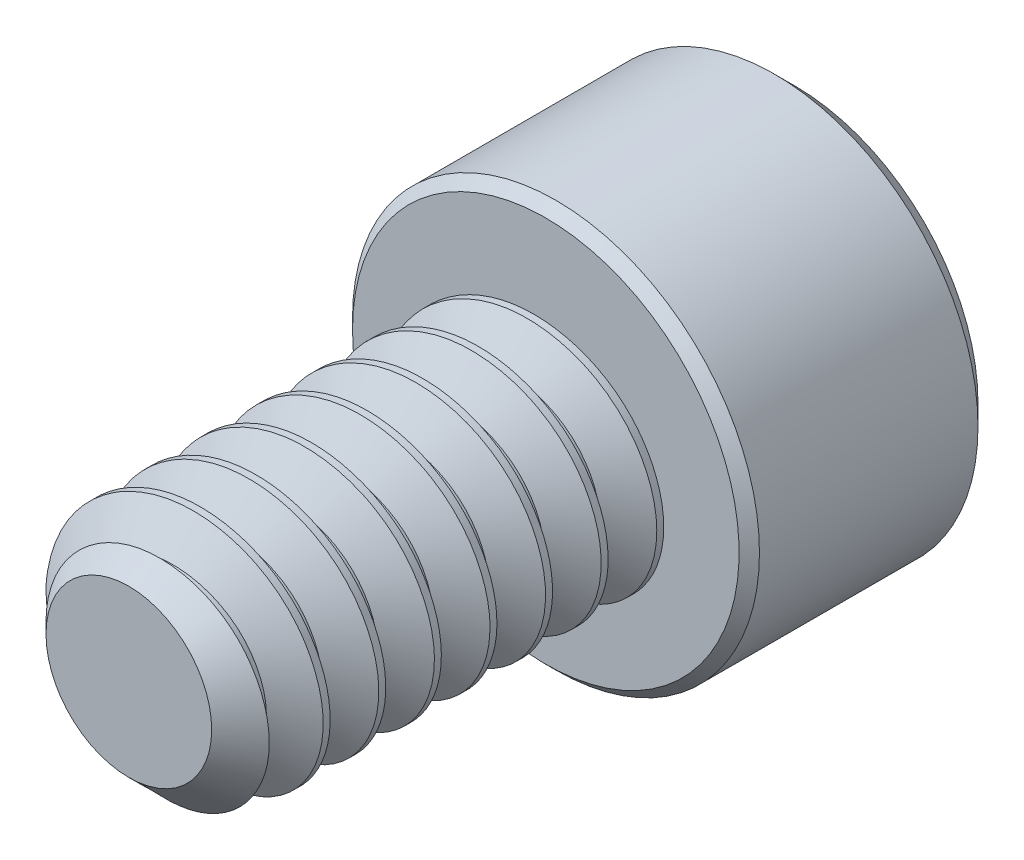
ISO-10303-21;
HEADER;
FILE_DESCRIPTION(('STEP AP214'),'2;1');
FILE_NAME('part.step','',(''),(''),'','','');
FILE_SCHEMA(('AUTOMOTIVE_DESIGN { 1 0 10303 214 1 1 1 1 }'));
ENDSEC;
DATA;
#1=APPLICATION_CONTEXT('core data for automotive mechanical design processes');
#2=APPLICATION_PROTOCOL_DEFINITION('international standard','automotive_design',2000,#1);
#3=PRODUCT_CONTEXT('',#1,'mechanical');
#4=PRODUCT('Part','Part','',(#3));
#5=PRODUCT_RELATED_PRODUCT_CATEGORY('part','',(#4));
#6=PRODUCT_DEFINITION_FORMATION('','',#4);
#7=PRODUCT_DEFINITION_CONTEXT('part definition',#1,'design');
#8=PRODUCT_DEFINITION('design','',#6,#7);
#9=PRODUCT_DEFINITION_SHAPE('','',#8);
#10=(LENGTH_UNIT() NAMED_UNIT(*) SI_UNIT(.MILLI.,.METRE.));
#11=(NAMED_UNIT(*) PLANE_ANGLE_UNIT() SI_UNIT($,.RADIAN.));
#12=(NAMED_UNIT(*) SI_UNIT($,.STERADIAN.) SOLID_ANGLE_UNIT());
#13=UNCERTAINTY_MEASURE_WITH_UNIT(LENGTH_MEASURE(1.E-05),#10,'distance_accuracy_value','');
#14=(GEOMETRIC_REPRESENTATION_CONTEXT(3) GLOBAL_UNCERTAINTY_ASSIGNED_CONTEXT((#13)) GLOBAL_UNIT_ASSIGNED_CONTEXT((#10,
#11,#12)) REPRESENTATION_CONTEXT('',''));
#15=CARTESIAN_POINT('',(0.,0.,0.));
#16=DIRECTION('',(0.,0.,1.));
#17=DIRECTION('',(1.,0.,0.));
#18=AXIS2_PLACEMENT_3D('',#15,#16,#17);
#19=CARTESIAN_POINT('',(0.,0.,-4.7625));
#20=DIRECTION('',(0.,0.,1.));
#21=DIRECTION('',(1.,0.,0.));
#22=AXIS2_PLACEMENT_3D('',#19,#20,#21);
#23=CYLINDRICAL_SURFACE('',#22,1.4224);
#24=CARTESIAN_POINT('',(0.,1.4224,0.));
#25=CARTESIAN_POINT('',(0.821223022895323,1.4224,-0.0529166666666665));
#26=CARTESIAN_POINT('',(1.23183453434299,0.7112,-0.105833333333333));
#27=CARTESIAN_POINT('',(1.64244604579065,0.,-0.15875));
#28=CARTESIAN_POINT('',(1.23183453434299,-0.7112,-0.211666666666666));
#29=CARTESIAN_POINT('',(0.821223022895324,-1.4224,-0.264583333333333));
#30=CARTESIAN_POINT('',(0.,-1.4224,-0.317499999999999));
#31=CARTESIAN_POINT('',(-0.821223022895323,-1.4224,-0.370416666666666));
#32=CARTESIAN_POINT('',(-1.23183453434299,-0.711200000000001,-0.423333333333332));
#33=CARTESIAN_POINT('',(-1.64244604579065,0.,-0.476249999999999));
#34=CARTESIAN_POINT('',(-1.23183453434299,0.711199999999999,-0.529166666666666));
#35=CARTESIAN_POINT('',(-0.821223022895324,1.4224,-0.582083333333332));
#36=CARTESIAN_POINT('',(0.,1.4224,-0.634999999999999));
#37=CARTESIAN_POINT('',(0.821223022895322,1.4224,-0.687916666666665));
#38=CARTESIAN_POINT('',(1.23183453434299,0.711200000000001,-0.740833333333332));
#39=CARTESIAN_POINT('',(1.64244604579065,0.,-0.793749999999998));
#40=CARTESIAN_POINT('',(1.23183453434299,-0.711199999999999,-0.846666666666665));
#41=CARTESIAN_POINT('',(0.821223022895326,-1.4224,-0.899583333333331));
#42=CARTESIAN_POINT('',(0.,-1.4224,-0.952499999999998));
#43=CARTESIAN_POINT('',(-0.821223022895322,-1.4224,-1.00541666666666));
#44=CARTESIAN_POINT('',(-1.23183453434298,-0.711200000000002,-1.05833333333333));
#45=CARTESIAN_POINT('',(-1.64244604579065,0.,-1.11125));
#46=CARTESIAN_POINT('',(-1.23183453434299,0.711199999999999,-1.16416666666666));
#47=CARTESIAN_POINT('',(-0.821223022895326,1.4224,-1.21708333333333));
#48=CARTESIAN_POINT('',(0.,1.4224,-1.27));
#49=CARTESIAN_POINT('',(0.821223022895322,1.4224,-1.32291666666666));
#50=CARTESIAN_POINT('',(1.23183453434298,0.711200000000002,-1.37583333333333));
#51=CARTESIAN_POINT('',(1.64244604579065,0.,-1.42875));
#52=CARTESIAN_POINT('',(1.23183453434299,-0.711199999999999,-1.48166666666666));
#53=CARTESIAN_POINT('',(0.821223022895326,-1.4224,-1.53458333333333));
#54=CARTESIAN_POINT('',(0.,-1.4224,-1.5875));
#55=CARTESIAN_POINT('',(-0.821223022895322,-1.4224,-1.64041666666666));
#56=CARTESIAN_POINT('',(-1.23183453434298,-0.711200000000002,-1.69333333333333));
#57=CARTESIAN_POINT('',(-1.64244604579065,0.,-1.74625));
#58=CARTESIAN_POINT('',(-1.23183453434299,0.711199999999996,-1.79916666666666));
#59=CARTESIAN_POINT('',(-0.821223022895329,1.4224,-1.85208333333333));
#60=CARTESIAN_POINT('',(0.,1.4224,-1.905));
#61=CARTESIAN_POINT('',(0.821223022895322,1.4224,-1.95791666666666));
#62=CARTESIAN_POINT('',(1.23183453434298,0.711200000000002,-2.01083333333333));
#63=CARTESIAN_POINT('',(1.64244604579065,0.,-2.06375));
#64=CARTESIAN_POINT('',(1.23183453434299,-0.711199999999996,-2.11666666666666));
#65=CARTESIAN_POINT('',(0.821223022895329,-1.4224,-2.16958333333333));
#66=CARTESIAN_POINT('',(0.,-1.4224,-2.2225));
#67=CARTESIAN_POINT('',(-0.821223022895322,-1.4224,-2.27541666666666));
#68=CARTESIAN_POINT('',(-1.23183453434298,-0.711200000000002,-2.32833333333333));
#69=CARTESIAN_POINT('',(-1.64244604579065,0.,-2.38124999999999));
#70=CARTESIAN_POINT('',(-1.23183453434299,0.711199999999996,-2.43416666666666));
#71=CARTESIAN_POINT('',(-0.821223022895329,1.4224,-2.48708333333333));
#72=CARTESIAN_POINT('',(0.,1.4224,-2.53999999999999));
#73=CARTESIAN_POINT('',(0.821223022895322,1.4224,-2.59291666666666));
#74=CARTESIAN_POINT('',(1.23183453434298,0.711200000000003,-2.64583333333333));
#75=CARTESIAN_POINT('',(1.64244604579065,0.,-2.69874999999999));
#76=CARTESIAN_POINT('',(1.23183453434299,-0.711199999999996,-2.75166666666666));
#77=CARTESIAN_POINT('',(0.821223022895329,-1.4224,-2.80458333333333));
#78=CARTESIAN_POINT('',(0.,-1.4224,-2.85749999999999));
#79=CARTESIAN_POINT('',(-0.821223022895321,-1.4224,-2.91041666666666));
#80=CARTESIAN_POINT('',(-1.23183453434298,-0.711200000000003,-2.96333333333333));
#81=CARTESIAN_POINT('',(-1.64244604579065,0.,-3.01624999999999));
#82=CARTESIAN_POINT('',(-1.23183453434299,0.711199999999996,-3.06916666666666));
#83=CARTESIAN_POINT('',(-0.82122302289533,1.4224,-3.12208333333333));
#84=CARTESIAN_POINT('',(0.,1.4224,-3.17499999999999));
#85=CARTESIAN_POINT('',(0.821223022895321,1.4224,-3.22791666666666));
#86=CARTESIAN_POINT('',(1.23183453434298,0.711200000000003,-3.28083333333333));
#87=CARTESIAN_POINT('',(1.64244604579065,0.,-3.33374999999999));
#88=CARTESIAN_POINT('',(1.23183453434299,-0.711199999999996,-3.38666666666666));
#89=CARTESIAN_POINT('',(0.821223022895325,-1.4224,-3.43958333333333));
#90=CARTESIAN_POINT('',(0.,-1.4224,-3.49249999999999));
#91=CARTESIAN_POINT('',(-0.821223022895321,-1.4224,-3.54541666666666));
#92=CARTESIAN_POINT('',(-1.23183453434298,-0.711200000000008,-3.59833333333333));
#93=CARTESIAN_POINT('',(-1.64244604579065,0.,-3.65124999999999));
#94=CARTESIAN_POINT('',(-1.23183453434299,0.711199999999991,-3.70416666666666));
#95=CARTESIAN_POINT('',(-0.82122302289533,1.4224,-3.75708333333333));
#96=CARTESIAN_POINT('',(0.,1.4224,-3.80999999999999));
#97=CARTESIAN_POINT('',(0.821223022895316,1.4224,-3.86291666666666));
#98=CARTESIAN_POINT('',(1.23183453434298,0.711200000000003,-3.91583333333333));
#99=CARTESIAN_POINT('',(1.64244604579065,0.,-3.96874999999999));
#100=CARTESIAN_POINT('',(1.23183453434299,-0.711199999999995,-4.02166666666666));
#101=CARTESIAN_POINT('',(0.821223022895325,-1.4224,-4.07458333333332));
#102=CARTESIAN_POINT('',(0.,-1.4224,-4.12749999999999));
#103=CARTESIAN_POINT('',(-0.821223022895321,-1.4224,-4.18041666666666));
#104=CARTESIAN_POINT('',(-1.23183453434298,-0.711200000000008,-4.23333333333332));
#105=CARTESIAN_POINT('',(-1.64244604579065,0.,-4.28624999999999));
#106=CARTESIAN_POINT('',(-1.23183453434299,0.711199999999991,-4.33916666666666));
#107=CARTESIAN_POINT('',(-0.82122302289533,1.4224,-4.39208333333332));
#108=CARTESIAN_POINT('',(0.,1.4224,-4.44499999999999));
#109=CARTESIAN_POINT('',(0.821223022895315,1.4224,-4.49791666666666));
#110=CARTESIAN_POINT('',(1.23183453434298,0.711200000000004,-4.55083333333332));
#111=CARTESIAN_POINT('',(1.64244604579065,0.,-4.60374999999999));
#112=CARTESIAN_POINT('',(1.23183453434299,-0.711199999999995,-4.65666666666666));
#113=CARTESIAN_POINT('',(0.821223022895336,-1.42239999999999,-4.70958333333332));
#114=CARTESIAN_POINT('',(0.,-1.4224,-4.76249999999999));
#115=CARTESIAN_POINT('',(-0.82122302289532,-1.4224,-4.81541666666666));
#116=CARTESIAN_POINT('',(-1.23183453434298,-0.711200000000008,-4.86833333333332));
#117=CARTESIAN_POINT('',(-1.64244604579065,0.,-4.92124999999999));
#118=CARTESIAN_POINT('',(-1.23183453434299,0.71119999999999,-4.97416666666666));
#119=CARTESIAN_POINT('',(-0.821223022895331,1.4224,-5.02708333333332));
#120=CARTESIAN_POINT('',(0.,1.4224,-5.07999999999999));
#121=CARTESIAN_POINT('',(0.821223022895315,1.4224,-5.13291666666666));
#122=CARTESIAN_POINT('',(1.23183453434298,0.711200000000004,-5.18583333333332));
#123=CARTESIAN_POINT('',(1.64244604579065,0.,-5.23874999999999));
#124=CARTESIAN_POINT('',(1.23183453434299,-0.711199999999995,-5.29166666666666));
#125=CARTESIAN_POINT('',(0.821223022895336,-1.42239999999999,-5.34458333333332));
#126=CARTESIAN_POINT('',(0.,-1.4224,-5.39749999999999));
#127=CARTESIAN_POINT('',(-0.82122302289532,-1.4224,-5.45041666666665));
#128=CARTESIAN_POINT('',(-1.23183453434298,-0.711200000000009,-5.50333333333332));
#129=CARTESIAN_POINT('',(-1.64244604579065,0.,-5.55624999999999));
#130=CARTESIAN_POINT('',(-1.23183453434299,0.71119999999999,-5.60916666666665));
#131=CARTESIAN_POINT('',(-0.821223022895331,1.4224,-5.66208333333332));
#132=CARTESIAN_POINT('',(0.,1.4224,-5.71499999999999));
#133=(BOUNDED_CURVE() B_SPLINE_CURVE(2,(#24,#25,#26,#27,#28,#29,#30,#31,#32,#33,#34,#35,#36,#37,
#38,#39,#40,#41,#42,#43,#44,#45,#46,#47,#48,#49,#50,#51,#52,#53,#54,#55,#56,#57,#58,#59,#60,#61,
#62,#63,#64,#65,#66,#67,#68,#69,#70,#71,#72,#73,#74,#75,#76,#77,#78,#79,#80,#81,#82,#83,#84,#85,
#86,#87,#88,#89,#90,#91,#92,#93,#94,#95,#96,#97,#98,#99,#100,#101,#102,#103,#104,#105,#106,#107,
#108,#109,#110,#111,#112,#113,#114,#115,#116,#117,#118,#119,#120,#121,#122,#123,#124,#125,#126,
#127,#128,#129,#130,#131,#132),.UNSPECIFIED.,.F.,.F.) B_SPLINE_CURVE_WITH_KNOTS((3,2,2,2,2,2,2,
2,2,2,2,2,2,2,2,2,2,2,2,2,2,2,2,2,2,2,2,2,2,2,2,2,2,2,2,2,2,2,2,2,2,2,2,2,2,2,2,2,2,2,2,2,2,2,
3),(0.,0.0185185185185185,0.037037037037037,0.0555555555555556,0.0740740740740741,
0.0925925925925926,0.111111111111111,0.12962962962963,0.148148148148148,0.166666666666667,
0.185185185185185,0.203703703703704,0.222222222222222,0.240740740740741,0.259259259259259,
0.277777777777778,0.296296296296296,0.314814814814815,0.333333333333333,0.351851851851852,
0.37037037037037,0.388888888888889,0.407407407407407,0.425925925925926,0.444444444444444,
0.462962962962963,0.481481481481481,0.5,0.518518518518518,0.537037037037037,0.555555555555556,
0.574074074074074,0.592592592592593,0.611111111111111,0.62962962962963,0.648148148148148,
0.666666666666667,0.685185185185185,0.703703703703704,0.722222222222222,0.740740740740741,
0.759259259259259,0.777777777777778,0.796296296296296,0.814814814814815,0.833333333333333,
0.851851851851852,0.87037037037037,0.888888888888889,0.907407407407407,0.925925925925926,
0.944444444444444,0.962962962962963,0.981481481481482,1.),
.UNSPECIFIED.) CURVE() GEOMETRIC_REPRESENTATION_ITEM() RATIONAL_B_SPLINE_CURVE((1.,
0.866025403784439,1.,0.866025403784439,1.,0.866025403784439,1.,0.866025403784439,1.,
0.866025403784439,1.,0.866025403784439,1.,0.866025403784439,1.,0.866025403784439,1.,
0.866025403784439,1.,0.866025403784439,1.,0.866025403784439,1.,0.866025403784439,1.,
0.866025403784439,1.,0.866025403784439,1.,0.866025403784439,1.,0.866025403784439,1.,
0.866025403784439,1.,0.866025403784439,1.,0.866025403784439,1.,0.866025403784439,1.,
0.866025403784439,1.,0.866025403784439,1.,0.866025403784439,1.,0.866025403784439,1.,
0.866025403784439,1.,0.866025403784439,1.,0.866025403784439,1.,0.866025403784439,1.,
0.866025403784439,1.,0.866025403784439,1.,0.866025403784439,1.,0.866025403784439,1.,
0.866025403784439,1.,0.866025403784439,1.,0.866025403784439,1.,0.866025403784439,1.,
0.866025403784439,1.,0.866025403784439,1.,0.866025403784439,1.,0.866025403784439,1.,
0.866025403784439,1.,0.866025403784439,1.,0.866025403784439,1.,0.866025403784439,1.,
0.866025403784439,1.,0.866025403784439,1.,0.866025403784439,1.,0.866025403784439,1.,
0.866025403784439,1.,0.866025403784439,1.,0.866025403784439,1.,0.866025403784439,1.,
0.866025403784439,1.,0.866025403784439,1.)) REPRESENTATION_ITEM(''));
#134=CARTESIAN_POINT('',(-1.4224,0.,-0.47625));
#135=VERTEX_POINT('',#134);
#136=CARTESIAN_POINT('',(0.,-1.4224,-4.76249999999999));
#137=VERTEX_POINT('',#136);
#138=EDGE_CURVE('E297',#135,#137,#133,.T.);
#139=ORIENTED_EDGE('',*,*,#138,.T.);
#140=CARTESIAN_POINT('',(0.,0.,-4.7625));
#141=DIRECTION('',(0.,0.,1.));
#142=DIRECTION('',(1.,0.,0.));
#143=AXIS2_PLACEMENT_3D('',#140,#141,#142);
#144=CIRCLE('',#143,1.4224);
#145=CARTESIAN_POINT('',(0.996575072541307,-1.0149186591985,-4.7625));
#146=VERTEX_POINT('',#145);
#147=EDGE_CURVE('E290',#137,#146,#144,.T.);
#148=ORIENTED_EDGE('',*,*,#147,.T.);
#149=CARTESIAN_POINT('',(0.,1.4224,0.555625));
#150=CARTESIAN_POINT('',(0.821223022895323,1.4224,0.502708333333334));
#151=CARTESIAN_POINT('',(1.23183453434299,0.7112,0.449791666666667));
#152=CARTESIAN_POINT('',(1.64244604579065,0.,0.396875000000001));
#153=CARTESIAN_POINT('',(1.23183453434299,-0.7112,0.343958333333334));
#154=CARTESIAN_POINT('',(0.821223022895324,-1.4224,0.291041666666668));
#155=CARTESIAN_POINT('',(0.,-1.4224,0.238125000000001));
#156=CARTESIAN_POINT('',(-0.821223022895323,-1.4224,0.185208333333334));
#157=CARTESIAN_POINT('',(-1.23183453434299,-0.711200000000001,0.132291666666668));
#158=CARTESIAN_POINT('',(-1.64244604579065,0.,0.0793750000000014));
#159=CARTESIAN_POINT('',(-1.23183453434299,0.711199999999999,0.0264583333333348));
#160=CARTESIAN_POINT('',(-0.821223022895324,1.4224,-0.0264583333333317));
#161=CARTESIAN_POINT('',(0.,1.4224,-0.0793749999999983));
#162=CARTESIAN_POINT('',(0.821223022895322,1.4224,-0.132291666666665));
#163=CARTESIAN_POINT('',(1.23183453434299,0.711200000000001,-0.185208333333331));
#164=CARTESIAN_POINT('',(1.64244604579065,0.,-0.238124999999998));
#165=CARTESIAN_POINT('',(1.23183453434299,-0.711199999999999,-0.291041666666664));
#166=CARTESIAN_POINT('',(0.821223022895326,-1.4224,-0.343958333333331));
#167=CARTESIAN_POINT('',(0.,-1.4224,-0.396874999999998));
#168=CARTESIAN_POINT('',(-0.821223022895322,-1.4224,-0.449791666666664));
#169=CARTESIAN_POINT('',(-1.23183453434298,-0.711200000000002,-0.502708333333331));
#170=CARTESIAN_POINT('',(-1.64244604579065,0.,-0.555624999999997));
#171=CARTESIAN_POINT('',(-1.23183453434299,0.711199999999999,-0.608541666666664));
#172=CARTESIAN_POINT('',(-0.821223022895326,1.4224,-0.66145833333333));
#173=CARTESIAN_POINT('',(0.,1.4224,-0.714374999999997));
#174=CARTESIAN_POINT('',(0.821223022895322,1.4224,-0.767291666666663));
#175=CARTESIAN_POINT('',(1.23183453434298,0.711200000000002,-0.82020833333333));
#176=CARTESIAN_POINT('',(1.64244604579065,0.,-0.873124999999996));
#177=CARTESIAN_POINT('',(1.23183453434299,-0.711199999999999,-0.926041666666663));
#178=CARTESIAN_POINT('',(0.821223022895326,-1.4224,-0.97895833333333));
#179=CARTESIAN_POINT('',(0.,-1.4224,-1.031875));
#180=CARTESIAN_POINT('',(-0.821223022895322,-1.4224,-1.08479166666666));
#181=CARTESIAN_POINT('',(-1.23183453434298,-0.711200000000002,-1.13770833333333));
#182=CARTESIAN_POINT('',(-1.64244604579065,0.,-1.190625));
#183=CARTESIAN_POINT('',(-1.23183453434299,0.711199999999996,-1.24354166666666));
#184=CARTESIAN_POINT('',(-0.821223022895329,1.4224,-1.29645833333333));
#185=CARTESIAN_POINT('',(0.,1.4224,-1.349375));
#186=CARTESIAN_POINT('',(0.821223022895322,1.4224,-1.40229166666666));
#187=CARTESIAN_POINT('',(1.23183453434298,0.711200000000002,-1.45520833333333));
#188=CARTESIAN_POINT('',(1.64244604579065,0.,-1.508125));
#189=CARTESIAN_POINT('',(1.23183453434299,-0.711199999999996,-1.56104166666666));
#190=CARTESIAN_POINT('',(0.821223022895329,-1.4224,-1.61395833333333));
#191=CARTESIAN_POINT('',(0.,-1.4224,-1.66687499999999));
#192=CARTESIAN_POINT('',(-0.821223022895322,-1.4224,-1.71979166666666));
#193=CARTESIAN_POINT('',(-1.23183453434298,-0.711200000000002,-1.77270833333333));
#194=CARTESIAN_POINT('',(-1.64244604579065,0.,-1.82562499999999));
#195=CARTESIAN_POINT('',(-1.23183453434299,0.711199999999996,-1.87854166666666));
#196=CARTESIAN_POINT('',(-0.821223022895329,1.4224,-1.93145833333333));
#197=CARTESIAN_POINT('',(0.,1.4224,-1.98437499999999));
#198=CARTESIAN_POINT('',(0.821223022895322,1.4224,-2.03729166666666));
#199=CARTESIAN_POINT('',(1.23183453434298,0.711200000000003,-2.09020833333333));
#200=CARTESIAN_POINT('',(1.64244604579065,0.,-2.14312499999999));
#201=CARTESIAN_POINT('',(1.23183453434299,-0.711199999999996,-2.19604166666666));
#202=CARTESIAN_POINT('',(0.821223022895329,-1.4224,-2.24895833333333));
#203=CARTESIAN_POINT('',(0.,-1.4224,-2.30187499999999));
#204=CARTESIAN_POINT('',(-0.821223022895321,-1.4224,-2.35479166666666));
#205=CARTESIAN_POINT('',(-1.23183453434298,-0.711200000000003,-2.40770833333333));
#206=CARTESIAN_POINT('',(-1.64244604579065,0.,-2.46062499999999));
#207=CARTESIAN_POINT('',(-1.23183453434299,0.711199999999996,-2.51354166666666));
#208=CARTESIAN_POINT('',(-0.82122302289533,1.4224,-2.56645833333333));
#209=CARTESIAN_POINT('',(0.,1.4224,-2.61937499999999));
#210=CARTESIAN_POINT('',(0.821223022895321,1.4224,-2.67229166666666));
#211=CARTESIAN_POINT('',(1.23183453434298,0.711200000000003,-2.72520833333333));
#212=CARTESIAN_POINT('',(1.64244604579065,0.,-2.77812499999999));
#213=CARTESIAN_POINT('',(1.23183453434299,-0.711199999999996,-2.83104166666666));
#214=CARTESIAN_POINT('',(0.821223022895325,-1.4224,-2.88395833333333));
#215=CARTESIAN_POINT('',(0.,-1.4224,-2.93687499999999));
#216=CARTESIAN_POINT('',(-0.821223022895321,-1.4224,-2.98979166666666));
#217=CARTESIAN_POINT('',(-1.23183453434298,-0.711200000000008,-3.04270833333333));
#218=CARTESIAN_POINT('',(-1.64244604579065,0.,-3.09562499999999));
#219=CARTESIAN_POINT('',(-1.23183453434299,0.711199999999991,-3.14854166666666));
#220=CARTESIAN_POINT('',(-0.82122302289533,1.4224,-3.20145833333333));
#221=CARTESIAN_POINT('',(0.,1.4224,-3.25437499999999));
#222=CARTESIAN_POINT('',(0.821223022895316,1.4224,-3.30729166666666));
#223=CARTESIAN_POINT('',(1.23183453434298,0.711200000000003,-3.36020833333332));
#224=CARTESIAN_POINT('',(1.64244604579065,0.,-3.41312499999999));
#225=CARTESIAN_POINT('',(1.23183453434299,-0.711199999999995,-3.46604166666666));
#226=CARTESIAN_POINT('',(0.821223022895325,-1.4224,-3.51895833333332));
#227=CARTESIAN_POINT('',(0.,-1.4224,-3.57187499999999));
#228=CARTESIAN_POINT('',(-0.821223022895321,-1.4224,-3.62479166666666));
#229=CARTESIAN_POINT('',(-1.23183453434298,-0.711200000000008,-3.67770833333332));
#230=CARTESIAN_POINT('',(-1.64244604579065,0.,-3.73062499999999));
#231=CARTESIAN_POINT('',(-1.23183453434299,0.711199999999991,-3.78354166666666));
#232=CARTESIAN_POINT('',(-0.82122302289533,1.4224,-3.83645833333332));
#233=CARTESIAN_POINT('',(0.,1.4224,-3.88937499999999));
#234=CARTESIAN_POINT('',(0.821223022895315,1.4224,-3.94229166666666));
#235=CARTESIAN_POINT('',(1.23183453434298,0.711200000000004,-3.99520833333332));
#236=CARTESIAN_POINT('',(1.64244604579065,0.,-4.04812499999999));
#237=CARTESIAN_POINT('',(1.23183453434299,-0.711199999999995,-4.10104166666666));
#238=CARTESIAN_POINT('',(0.821223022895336,-1.42239999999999,-4.15395833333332));
#239=CARTESIAN_POINT('',(0.,-1.4224,-4.20687499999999));
#240=CARTESIAN_POINT('',(-0.82122302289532,-1.4224,-4.25979166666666));
#241=CARTESIAN_POINT('',(-1.23183453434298,-0.711200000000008,-4.31270833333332));
#242=CARTESIAN_POINT('',(-1.64244604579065,0.,-4.36562499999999));
#243=CARTESIAN_POINT('',(-1.23183453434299,0.71119999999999,-4.41854166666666));
#244=CARTESIAN_POINT('',(-0.821223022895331,1.4224,-4.47145833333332));
#245=CARTESIAN_POINT('',(0.,1.4224,-4.52437499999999));
#246=CARTESIAN_POINT('',(0.821223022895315,1.4224,-4.57729166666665));
#247=CARTESIAN_POINT('',(1.23183453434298,0.711200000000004,-4.63020833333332));
#248=CARTESIAN_POINT('',(1.64244604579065,0.,-4.68312499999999));
#249=CARTESIAN_POINT('',(1.23183453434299,-0.711199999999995,-4.73604166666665));
#250=CARTESIAN_POINT('',(0.821223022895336,-1.42239999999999,-4.78895833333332));
#251=CARTESIAN_POINT('',(0.,-1.4224,-4.84187499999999));
#252=CARTESIAN_POINT('',(-0.82122302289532,-1.4224,-4.89479166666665));
#253=CARTESIAN_POINT('',(-1.23183453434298,-0.711200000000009,-4.94770833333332));
#254=CARTESIAN_POINT('',(-1.64244604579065,0.,-5.00062499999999));
#255=CARTESIAN_POINT('',(-1.23183453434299,0.71119999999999,-5.05354166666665));
#256=CARTESIAN_POINT('',(-0.821223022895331,1.4224,-5.10645833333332));
#257=CARTESIAN_POINT('',(0.,1.4224,-5.15937499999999));
#258=(BOUNDED_CURVE() B_SPLINE_CURVE(2,(#149,#150,#151,#152,#153,#154,#155,#156,#157,#158,#159,
#160,#161,#162,#163,#164,#165,#166,#167,#168,#169,#170,#171,#172,#173,#174,#175,#176,#177,#178,
#179,#180,#181,#182,#183,#184,#185,#186,#187,#188,#189,#190,#191,#192,#193,#194,#195,#196,#197,
#198,#199,#200,#201,#202,#203,#204,#205,#206,#207,#208,#209,#210,#211,#212,#213,#214,#215,#216,
#217,#218,#219,#220,#221,#222,#223,#224,#225,#226,#227,#228,#229,#230,#231,#232,#233,#234,#235,
#236,#237,#238,#239,#240,#241,#242,#243,#244,#245,#246,#247,#248,#249,#250,#251,#252,#253,#254,
#255,#256,#257),.UNSPECIFIED.,.F.,.F.) B_SPLINE_CURVE_WITH_KNOTS((3,2,2,2,2,2,2,2,2,2,2,2,2,2,2,
2,2,2,2,2,2,2,2,2,2,2,2,2,2,2,2,2,2,2,2,2,2,2,2,2,2,2,2,2,2,2,2,2,2,2,2,2,2,2,3),(0.,
0.0185185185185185,0.037037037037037,0.0555555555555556,0.0740740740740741,0.0925925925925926,
0.111111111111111,0.12962962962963,0.148148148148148,0.166666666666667,0.185185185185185,
0.203703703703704,0.222222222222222,0.240740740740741,0.259259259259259,0.277777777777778,
0.296296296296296,0.314814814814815,0.333333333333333,0.351851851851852,0.37037037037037,
0.388888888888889,0.407407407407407,0.425925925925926,0.444444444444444,0.462962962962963,
0.481481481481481,0.5,0.518518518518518,0.537037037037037,0.555555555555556,0.574074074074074,
0.592592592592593,0.611111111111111,0.62962962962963,0.648148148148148,0.666666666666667,
0.685185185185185,0.703703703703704,0.722222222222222,0.740740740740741,0.759259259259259,
0.777777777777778,0.796296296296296,0.814814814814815,0.833333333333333,0.851851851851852,
0.87037037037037,0.888888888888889,0.907407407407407,0.925925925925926,0.944444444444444,
0.962962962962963,0.981481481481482,1.),
.UNSPECIFIED.) CURVE() GEOMETRIC_REPRESENTATION_ITEM() RATIONAL_B_SPLINE_CURVE((1.,
0.866025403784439,1.,0.866025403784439,1.,0.866025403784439,1.,0.866025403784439,1.,
0.866025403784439,1.,0.866025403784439,1.,0.866025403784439,1.,0.866025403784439,1.,
0.866025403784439,1.,0.866025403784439,1.,0.866025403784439,1.,0.866025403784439,1.,
0.866025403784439,1.,0.866025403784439,1.,0.866025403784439,1.,0.866025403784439,1.,
0.866025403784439,1.,0.866025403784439,1.,0.866025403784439,1.,0.866025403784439,1.,
0.866025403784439,1.,0.866025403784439,1.,0.866025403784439,1.,0.866025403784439,1.,
0.866025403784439,1.,0.866025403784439,1.,0.866025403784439,1.,0.866025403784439,1.,
0.866025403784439,1.,0.866025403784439,1.,0.866025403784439,1.,0.866025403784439,1.,
0.866025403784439,1.,0.866025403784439,1.,0.866025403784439,1.,0.866025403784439,1.,
0.866025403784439,1.,0.866025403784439,1.,0.866025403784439,1.,0.866025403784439,1.,
0.866025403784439,1.,0.866025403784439,1.,0.866025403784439,1.,0.866025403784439,1.,
0.866025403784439,1.,0.866025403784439,1.,0.866025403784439,1.,0.866025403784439,1.,
0.866025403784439,1.,0.866025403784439,1.,0.866025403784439,1.,0.866025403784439,1.,
0.866025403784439,1.,0.866025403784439,1.)) REPRESENTATION_ITEM(''));
#259=CARTESIAN_POINT('',(-0.996575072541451,-1.01491865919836,-0.47625));
#260=VERTEX_POINT('',#259);
#261=EDGE_CURVE('E277',#260,#146,#258,.T.);
#262=ORIENTED_EDGE('',*,*,#261,.F.);
#263=CARTESIAN_POINT('',(0.,0.,-0.47625));
#264=DIRECTION('',(0.,0.,1.));
#265=DIRECTION('',(1.,0.,0.));
#266=AXIS2_PLACEMENT_3D('',#263,#264,#265);
#267=CIRCLE('',#266,1.4224);
#268=EDGE_CURVE('E245',#260,#135,#267,.F.);
#269=ORIENTED_EDGE('',*,*,#268,.T.);
#270=EDGE_LOOP('',(#139,#148,#262,#269));
#271=FACE_BOUND('',#270,.T.);
#272=ADVANCED_FACE('F36',(#271),#23,.T.);
#273=CARTESIAN_POINT('',(0.,0.,0.));
#274=DIRECTION('',(0.,0.,1.));
#275=DIRECTION('',(1.,0.,0.));
#276=AXIS2_PLACEMENT_3D('',#273,#274,#275);
#277=PLANE('',#276);
#278=CARTESIAN_POINT('',(0.,0.,0.));
#279=DIRECTION('',(0.,0.,1.));
#280=DIRECTION('',(1.,0.,0.));
#281=AXIS2_PLACEMENT_3D('',#278,#279,#280);
#282=CIRCLE('',#281,0.94615);
#283=CARTESIAN_POINT('',(0.94615,0.,0.));
#284=VERTEX_POINT('',#283);
#285=EDGE_CURVE('E291',#284,#284,#282,.T.);
#286=ORIENTED_EDGE('',*,*,#285,.T.);
#287=EDGE_LOOP('',(#286));
#288=FACE_BOUND('',#287,.T.);
#289=ADVANCED_FACE('F220',(#288),#277,.T.);
#290=CARTESIAN_POINT('',(0.,0.,0.));
#291=DIRECTION('',(0.,0.,-1.));
#292=DIRECTION('',(-1.,0.,0.));
#293=AXIS2_PLACEMENT_3D('',#290,#291,#292);
#294=CONICAL_SURFACE('',#293,0.94615,0.785398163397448);
#295=CARTESIAN_POINT('',(-1.4224,0.,-0.47625));
#296=CARTESIAN_POINT('',(-1.41549521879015,-0.0392467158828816,-0.469341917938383));
#297=CARTESIAN_POINT('',(-1.40691074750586,-0.0781881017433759,-0.462384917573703));
#298=CARTESIAN_POINT('',(-1.38646506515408,-0.155175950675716,-0.448421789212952));
#299=CARTESIAN_POINT('',(-1.37460508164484,-0.193222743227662,-0.441415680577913));
#300=CARTESIAN_POINT('',(-1.34758433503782,-0.268449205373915,-0.4273450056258));
#301=CARTESIAN_POINT('',(-1.3323993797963,-0.305620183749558,-0.420280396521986));
#302=CARTESIAN_POINT('',(-1.29888905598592,-0.378533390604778,-0.406195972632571));
#303=CARTESIAN_POINT('',(-1.28056314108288,-0.414275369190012,-0.399176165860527));
#304=CARTESIAN_POINT('',(-1.24089705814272,-0.484088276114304,-0.385241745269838));
#305=CARTESIAN_POINT('',(-1.21955603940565,-0.51815872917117,-0.37832716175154));
#306=CARTESIAN_POINT('',(-1.18540102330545,-0.567798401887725,-0.36807154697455));
#307=CARTESIAN_POINT('',(-1.17365754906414,-0.584102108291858,-0.364672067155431));
#308=CARTESIAN_POINT('',(-1.14949150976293,-0.616214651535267,-0.357943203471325));
#309=CARTESIAN_POINT('',(-1.13706895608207,-0.632023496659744,-0.354613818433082));
#310=CARTESIAN_POINT('',(-1.11153646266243,-0.662996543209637,-0.347947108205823));
#311=CARTESIAN_POINT('',(-1.09842867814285,-0.678162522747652,-0.344609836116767));
#312=CARTESIAN_POINT('',(-1.07145128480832,-0.707768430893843,-0.337810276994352));
#313=CARTESIAN_POINT('',(-1.05758170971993,-0.722208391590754,-0.334347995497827));
#314=CARTESIAN_POINT('',(-1.01491812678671,-0.764409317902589,-0.3238229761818));
#315=CARTESIAN_POINT('',(-0.985054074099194,-0.791069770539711,-0.316618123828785));
#316=CARTESIAN_POINT('',(-0.925460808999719,-0.838989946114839,-0.302486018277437));
#317=CARTESIAN_POINT('',(-0.895937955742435,-0.860516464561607,-0.295587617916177));
#318=CARTESIAN_POINT('',(-0.835031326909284,-0.900670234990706,-0.281531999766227));
#319=CARTESIAN_POINT('',(-0.803647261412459,-0.919297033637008,-0.274374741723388));
#320=CARTESIAN_POINT('',(-0.739260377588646,-0.953499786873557,-0.259831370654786));
#321=CARTESIAN_POINT('',(-0.706255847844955,-0.969072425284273,-0.252445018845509));
#322=CARTESIAN_POINT('',(-0.638971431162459,-0.997003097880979,-0.237499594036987));
#323=CARTESIAN_POINT('',(-0.604691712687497,-1.00936155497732,-0.229940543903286));
#324=CARTESIAN_POINT('',(-0.506859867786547,-1.03944300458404,-0.208493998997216));
#325=CARTESIAN_POINT('',(-0.442115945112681,-1.05338730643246,-0.194446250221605));
#326=CARTESIAN_POINT('',(-0.344089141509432,-1.06579417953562,-0.173347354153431));
#327=CARTESIAN_POINT('',(-0.311269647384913,-1.0685119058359,-0.166311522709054));
#328=CARTESIAN_POINT('',(-0.245493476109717,-1.07111390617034,-0.152266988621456));
#329=CARTESIAN_POINT('',(-0.212536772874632,-1.07099761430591,-0.145258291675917));
#330=CARTESIAN_POINT('',(-0.150287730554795,-1.06809468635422,-0.132083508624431));
#331=CARTESIAN_POINT('',(-0.120983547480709,-1.06559741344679,-0.125908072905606));
#332=CARTESIAN_POINT('',(-0.0772335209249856,-1.06016593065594,-0.116728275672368));
#333=CARTESIAN_POINT('',(-0.0626875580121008,-1.05807511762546,-0.113682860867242));
#334=CARTESIAN_POINT('',(-0.0336742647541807,-1.05334779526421,-0.107637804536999));
#335=CARTESIAN_POINT('',(-0.0192069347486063,-1.05071128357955,-0.104638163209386));
#336=CARTESIAN_POINT('',(0.0096331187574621,-1.0448378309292,-0.098632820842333));
#337=CARTESIAN_POINT('',(0.0240056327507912,-1.04159984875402,-0.0956271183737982));
#338=CARTESIAN_POINT('',(0.0525505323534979,-1.03442302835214,-0.0895068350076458));
#339=CARTESIAN_POINT('',(0.0667229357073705,-1.03048425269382,-0.0863922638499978));
#340=CARTESIAN_POINT('',(0.0948684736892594,-1.02193699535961,-0.0800803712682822));
#341=CARTESIAN_POINT('',(0.108841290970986,-1.0173275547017,-0.0768829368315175));
#342=CARTESIAN_POINT('',(0.136537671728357,-1.0074470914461,-0.0704060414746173));
#343=CARTESIAN_POINT('',(0.15026114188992,-1.00217582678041,-0.0671265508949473));
#344=CARTESIAN_POINT('',(0.163840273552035,-0.996577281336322,-0.0638054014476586));
#345=B_SPLINE_CURVE_WITH_KNOTS('',3,(#295,#296,#297,#298,#299,#300,#301,#302,#303,#304,#305,
#306,#307,#308,#309,#310,#311,#312,#313,#314,#315,#316,#317,#318,#319,#320,#321,#322,#323,#324,
#325,#326,#327,#328,#329,#330,#331,#332,#333,#334,#335,#336,#337,#338,#339,#340,#341,#342,#343,
#344),.UNSPECIFIED.,.F.,.F.,(4,2,2,2,2,2,2,2,2,2,2,2,2,2,2,2,2,2,2,2,2,2,2,2,4),(0.,
0.121293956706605,0.242542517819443,0.364704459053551,0.486887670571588,0.609105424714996,
0.670225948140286,0.731345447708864,0.792283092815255,0.853218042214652,0.975015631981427,
1.08640996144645,1.19782168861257,1.30935372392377,1.4208710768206,1.62283593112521,
1.72377027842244,1.82472478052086,1.91479081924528,1.95980511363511,2.00481960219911,
2.04991275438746,2.09500188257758,2.14015612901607,2.18532693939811),.UNSPECIFIED.);
#346=CARTESIAN_POINT('',(0.163840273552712,-0.996577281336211,-0.0638054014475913));
#347=VERTEX_POINT('',#346);
#348=EDGE_CURVE('E134',#135,#347,#345,.T.);
#349=ORIENTED_EDGE('',*,*,#348,.F.);
#350=ORIENTED_EDGE('',*,*,#268,.F.);
#351=CARTESIAN_POINT('',(-0.59228653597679,-0.818050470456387,-0.0638054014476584));
#352=CARTESIAN_POINT('',(-0.616212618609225,-0.803026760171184,-0.0656693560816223));
#353=CARTESIAN_POINT('',(-0.63948770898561,-0.786999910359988,-0.067517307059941));
#354=CARTESIAN_POINT('',(-0.684612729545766,-0.753029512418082,-0.071175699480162));
#355=CARTESIAN_POINT('',(-0.70646206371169,-0.73508517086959,-0.0729861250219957));
#356=CARTESIAN_POINT('',(-0.769480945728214,-0.678688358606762,-0.0783355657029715));
#357=CARTESIAN_POINT('',(-0.808324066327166,-0.637544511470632,-0.0818084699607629));
#358=CARTESIAN_POINT('',(-0.860924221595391,-0.57142881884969,-0.0867712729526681));
#359=CARTESIAN_POINT('',(-0.877517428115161,-0.548649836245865,-0.0883848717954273));
#360=CARTESIAN_POINT('',(-0.908778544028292,-0.501799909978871,-0.0915839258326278));
#361=CARTESIAN_POINT('',(-0.92344616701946,-0.477728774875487,-0.0931693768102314));
#362=CARTESIAN_POINT('',(-0.964554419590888,-0.403881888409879,-0.0980363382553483));
#363=CARTESIAN_POINT('',(-0.988105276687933,-0.352466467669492,-0.101428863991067));
#364=CARTESIAN_POINT('',(-1.02770851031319,-0.244045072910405,-0.108489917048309));
#365=CARTESIAN_POINT('',(-1.0433482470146,-0.186889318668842,-0.112163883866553));
#366=CARTESIAN_POINT('',(-1.0649809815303,-0.0707815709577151,-0.119552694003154));
#367=CARTESIAN_POINT('',(-1.0709742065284,-0.0118296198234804,-0.123267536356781));
#368=CARTESIAN_POINT('',(-1.07316796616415,0.107379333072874,-0.130702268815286));
#369=CARTESIAN_POINT('',(-1.06917997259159,0.167639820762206,-0.134420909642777));
#370=CARTESIAN_POINT('',(-1.05110704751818,0.286654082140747,-0.141688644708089));
#371=CARTESIAN_POINT('',(-1.03702438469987,0.345408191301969,-0.145237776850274));
#372=CARTESIAN_POINT('',(-1.00869385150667,0.431068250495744,-0.150380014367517));
#373=CARTESIAN_POINT('',(-0.998049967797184,0.459208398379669,-0.152063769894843));
#374=CARTESIAN_POINT('',(-0.974401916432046,0.514493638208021,-0.155332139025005));
#375=CARTESIAN_POINT('',(-0.961397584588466,0.541638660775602,-0.156916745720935));
#376=CARTESIAN_POINT('',(-0.933248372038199,0.594802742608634,-0.160123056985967));
#377=CARTESIAN_POINT('',(-0.918102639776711,0.620821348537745,-0.161744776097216));
#378=CARTESIAN_POINT('',(-0.885807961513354,0.671572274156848,-0.165048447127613));
#379=CARTESIAN_POINT('',(-0.868658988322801,0.69630457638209,-0.166730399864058));
#380=CARTESIAN_POINT('',(-0.813151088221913,0.769913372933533,-0.171948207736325));
#381=CARTESIAN_POINT('',(-0.771644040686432,0.816470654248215,-0.175551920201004));
#382=CARTESIAN_POINT('',(-0.681606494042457,0.902144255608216,-0.182831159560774));
#383=CARTESIAN_POINT('',(-0.633076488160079,0.941261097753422,-0.186506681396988));
#384=CARTESIAN_POINT('',(-0.528767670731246,1.01206583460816,-0.193937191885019));
#385=CARTESIAN_POINT('',(-0.472818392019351,1.04350305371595,-0.197691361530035));
#386=CARTESIAN_POINT('',(-0.356401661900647,1.09652081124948,-0.205070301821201));
#387=CARTESIAN_POINT('',(-0.295935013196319,1.11810309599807,-0.208695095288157));
#388=CARTESIAN_POINT('',(-0.203234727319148,1.14261552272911,-0.213958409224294));
#389=CARTESIAN_POINT('',(-0.171994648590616,1.14947676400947,-0.215684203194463));
#390=CARTESIAN_POINT('',(-0.109036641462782,1.16054817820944,-0.219072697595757));
#391=CARTESIAN_POINT('',(-0.0773187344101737,1.16475846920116,-0.220735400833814));
#392=CARTESIAN_POINT('',(-0.0136304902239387,1.17048030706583,-0.223973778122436));
#393=CARTESIAN_POINT('',(0.0183399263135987,1.17199096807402,-0.225549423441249));
#394=CARTESIAN_POINT('',(0.0822968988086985,1.17247837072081,-0.228778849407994));
#395=CARTESIAN_POINT('',(0.114283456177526,1.17145482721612,-0.230432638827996));
#396=CARTESIAN_POINT('',(0.178723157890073,1.16681145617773,-0.233820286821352));
#397=CARTESIAN_POINT('',(0.211172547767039,1.16313920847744,-0.235555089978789));
#398=CARTESIAN_POINT('',(0.275653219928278,1.15317466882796,-0.239064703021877));
#399=CARTESIAN_POINT('',(0.307684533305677,1.14688257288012,-0.240839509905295));
#400=CARTESIAN_POINT('',(0.402842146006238,1.12412504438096,-0.246203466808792));
#401=CARTESIAN_POINT('',(0.465083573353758,1.10377461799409,-0.24983486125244));
#402=CARTESIAN_POINT('',(0.587704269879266,1.05230002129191,-0.257242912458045));
#403=CARTESIAN_POINT('',(0.64792348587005,1.02079665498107,-0.261019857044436));
#404=CARTESIAN_POINT('',(0.762203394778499,0.948121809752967,-0.268476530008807));
#405=CARTESIAN_POINT('',(0.816265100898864,0.906951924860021,-0.272156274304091));
#406=CARTESIAN_POINT('',(0.91671436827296,0.816084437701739,-0.279326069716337));
#407=CARTESIAN_POINT('',(0.963103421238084,0.766388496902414,-0.282816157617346));
#408=CARTESIAN_POINT('',(1.02590639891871,0.686571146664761,-0.287833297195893));
#409=CARTESIAN_POINT('',(1.04571980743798,0.65906959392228,-0.289470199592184));
#410=CARTESIAN_POINT('',(1.07365852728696,0.616640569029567,-0.291873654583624));
#411=CARTESIAN_POINT('',(1.08267537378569,0.602299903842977,-0.292666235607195));
#412=CARTESIAN_POINT('',(1.10013506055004,0.573273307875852,-0.294274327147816));
#413=CARTESIAN_POINT('',(1.10857775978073,0.558587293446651,-0.295089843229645));
#414=CARTESIAN_POINT('',(1.14958875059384,0.483811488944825,-0.299231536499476));
#415=CARTESIAN_POINT('',(1.17764172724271,0.421147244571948,-0.302668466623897));
#416=CARTESIAN_POINT('',(1.22328570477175,0.292175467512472,-0.30968356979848));
#417=CARTESIAN_POINT('',(1.24087571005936,0.225867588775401,-0.3132617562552));
#418=CARTESIAN_POINT('',(1.26571094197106,0.0882124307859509,-0.320623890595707));
#419=CARTESIAN_POINT('',(1.2724514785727,0.0167729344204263,-0.324409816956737));
#420=CARTESIAN_POINT('',(1.27382947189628,-0.12620092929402,-0.331921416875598));
#421=CARTESIAN_POINT('',(1.26846841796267,-0.19773528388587,-0.33564709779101));
#422=CARTESIAN_POINT('',(1.24577631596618,-0.338925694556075,-0.342934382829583));
#423=CARTESIAN_POINT('',(1.22844560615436,-0.408581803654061,-0.346495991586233));
#424=CARTESIAN_POINT('',(1.19390242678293,-0.510090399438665,-0.351661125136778));
#425=CARTESIAN_POINT('',(1.18095474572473,-0.543446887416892,-0.353354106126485));
#426=CARTESIAN_POINT('',(1.15226524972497,-0.608951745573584,-0.356640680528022));
#427=CARTESIAN_POINT('',(1.13652324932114,-0.641100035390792,-0.358234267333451));
#428=CARTESIAN_POINT('',(1.10248192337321,-0.704031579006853,-0.361461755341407));
#429=CARTESIAN_POINT('',(1.08418105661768,-0.734813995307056,-0.363095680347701));
#430=CARTESIAN_POINT('',(1.04518460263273,-0.794809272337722,-0.366425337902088));
#431=CARTESIAN_POINT('',(1.02448905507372,-0.82402215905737,-0.368121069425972));
#432=CARTESIAN_POINT('',(0.958978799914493,-0.909025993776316,-0.37327104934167));
#433=CARTESIAN_POINT('',(0.910720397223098,-0.962219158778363,-0.376789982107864));
#434=CARTESIAN_POINT('',(0.803635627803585,-1.06271270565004,-0.384087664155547));
#435=CARTESIAN_POINT('',(0.744392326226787,-1.10956714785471,-0.387870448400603));
#436=CARTESIAN_POINT('',(0.618883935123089,-1.19265073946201,-0.395409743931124));
#437=CARTESIAN_POINT('',(0.552619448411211,-1.22888080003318,-0.399166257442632));
#438=CARTESIAN_POINT('',(0.414894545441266,-1.28969576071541,-0.406553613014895));
#439=CARTESIAN_POINT('',(0.343433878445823,-1.31428009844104,-0.410184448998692));
#440=CARTESIAN_POINT('',(0.233981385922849,-1.34188398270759,-0.415459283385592));
#441=CARTESIAN_POINT('',(0.19710337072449,-1.34954118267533,-0.417189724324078));
#442=CARTESIAN_POINT('',(0.122820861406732,-1.36172464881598,-0.420586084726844));
#443=CARTESIAN_POINT('',(0.0854163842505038,-1.36625101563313,-0.422252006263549));
#444=CARTESIAN_POINT('',(0.0104283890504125,-1.37212262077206,-0.425498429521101));
#445=CARTESIAN_POINT('',(-0.0271546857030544,-1.37347356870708,-0.427079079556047));
#446=CARTESIAN_POINT('',(-0.102305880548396,-1.37317957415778,-0.430323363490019));
#447=CARTESIAN_POINT('',(-0.139873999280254,-1.37153440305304,-0.431987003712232));
#448=CARTESIAN_POINT('',(-0.214776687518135,-1.36522989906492,-0.435360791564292));
#449=CARTESIAN_POINT('',(-0.252111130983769,-1.36056906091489,-0.437070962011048));
#450=CARTESIAN_POINT('',(-0.326273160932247,-1.34827370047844,-0.440531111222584));
#451=CARTESIAN_POINT('',(-0.36310077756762,-1.34063935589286,-0.442281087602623));
#452=CARTESIAN_POINT('',(-0.475838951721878,-1.31249483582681,-0.447733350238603));
#453=CARTESIAN_POINT('',(-0.550569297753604,-1.28702272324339,-0.451483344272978));
#454=CARTESIAN_POINT('',(-0.69462240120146,-1.22395871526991,-0.458988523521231));
#455=CARTESIAN_POINT('',(-0.763951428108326,-1.18638113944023,-0.462743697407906));
#456=CARTESIAN_POINT('',(-0.859016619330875,-1.12403563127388,-0.468108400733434));
#457=CARTESIAN_POINT('',(-0.887694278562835,-1.10364414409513,-0.469758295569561));
#458=CARTESIAN_POINT('',(-0.943393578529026,-1.06080284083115,-0.473027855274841));
#459=CARTESIAN_POINT('',(-0.970417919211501,-1.0383565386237,-0.474647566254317));
#460=CARTESIAN_POINT('',(-0.996575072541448,-1.01491865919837,-0.47625));
#461=B_SPLINE_CURVE_WITH_KNOTS('',3,(#351,#352,#353,#354,#355,#356,#357,#358,#359,#360,#361,
#362,#363,#364,#365,#366,#367,#368,#369,#370,#371,#372,#373,#374,#375,#376,#377,#378,#379,#380,
#381,#382,#383,#384,#385,#386,#387,#388,#389,#390,#391,#392,#393,#394,#395,#396,#397,#398,#399,
#400,#401,#402,#403,#404,#405,#406,#407,#408,#409,#410,#411,#412,#413,#414,#415,#416,#417,#418,
#419,#420,#421,#422,#423,#424,#425,#426,#427,#428,#429,#430,#431,#432,#433,#434,#435,#436,#437,
#438,#439,#440,#441,#442,#443,#444,#445,#446,#447,#448,#449,#450,#451,#452,#453,#454,#455,#456,
#457,#458,#459,#460),.UNSPECIFIED.,.F.,.F.,(4,2,2,2,2,2,2,2,2,2,2,2,2,2,2,2,2,2,2,2,2,2,2,2,2,2,
2,2,2,2,2,2,2,2,2,2,2,2,2,2,2,2,2,2,2,2,2,2,2,2,2,2,2,2,4),(0.,0.0848770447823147,
0.169789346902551,0.338902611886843,0.423507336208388,0.508124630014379,0.677335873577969,
0.854642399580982,1.0319447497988,1.21262121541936,1.39325708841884,1.48356593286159,
1.57388106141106,1.66423220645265,1.75458457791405,1.94110133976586,2.12760500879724,
2.31956222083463,2.51148540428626,2.60748629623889,2.70348291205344,2.79951102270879,
2.89554993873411,2.99354360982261,3.0915299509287,3.28734946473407,3.4905927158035,
3.69380247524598,3.89697268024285,3.9986716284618,4.04953160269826,4.10040402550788,
4.30561586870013,4.51084723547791,4.72537515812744,4.93987668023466,5.15437214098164,
5.26172920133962,5.3690933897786,5.47652252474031,5.58394988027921,5.79867950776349,
6.02449375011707,6.25028862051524,6.47609439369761,6.58909802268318,6.7020980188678,
6.81489467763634,6.927699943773,7.04056156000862,7.15341643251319,7.38935354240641,
7.62501258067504,7.73060976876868,7.83602963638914),.UNSPECIFIED.);
#462=CARTESIAN_POINT('',(-0.59228653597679,-0.818050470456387,-0.0638054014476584));
#463=VERTEX_POINT('',#462);
#464=EDGE_CURVE('E237',#463,#260,#461,.T.);
#465=ORIENTED_EDGE('',*,*,#464,.F.);
#466=CARTESIAN_POINT('',(0.,0.,-0.0638054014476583));
#467=DIRECTION('',(0.,0.,-1.));
#468=DIRECTION('',(-1.,0.,0.));
#469=AXIS2_PLACEMENT_3D('',#466,#467,#468);
#470=CIRCLE('',#469,1.00995540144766);
#471=EDGE_CURVE('E244',#347,#463,#470,.T.);
#472=ORIENTED_EDGE('',*,*,#471,.F.);
#473=EDGE_LOOP('',(#349,#350,#465,#472));
#474=FACE_BOUND('',#473,.T.);
#475=ORIENTED_EDGE('',*,*,#285,.F.);
#476=EDGE_LOOP('',(#475));
#477=FACE_BOUND('',#476,.T.);
#478=ADVANCED_FACE('F226',(#474,#477),#294,.T.);
#479=CARTESIAN_POINT('',(0.,0.,0.));
#480=DIRECTION('',(0.,0.,-1.));
#481=DIRECTION('',(-1.,0.,0.));
#482=AXIS2_PLACEMENT_3D('',#479,#480,#481);
#483=CYLINDRICAL_SURFACE('',#482,1.00995540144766);
#484=CARTESIAN_POINT('',(0.,1.00995540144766,0.238125));
#485=CARTESIAN_POINT('',(0.583098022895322,1.00995540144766,0.185208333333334));
#486=CARTESIAN_POINT('',(0.874647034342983,0.504977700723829,0.132291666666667));
#487=CARTESIAN_POINT('',(1.16619604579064,0.,0.0793750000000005));
#488=CARTESIAN_POINT('',(0.874647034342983,-0.504977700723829,0.026458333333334));
#489=CARTESIAN_POINT('',(0.583098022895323,-1.00995540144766,-0.0264583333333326));
#490=CARTESIAN_POINT('',(0.,-1.00995540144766,-0.0793749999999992));
#491=CARTESIAN_POINT('',(-0.583098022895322,-1.00995540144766,-0.132291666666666));
#492=CARTESIAN_POINT('',(-0.874647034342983,-0.50497770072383,-0.185208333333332));
#493=CARTESIAN_POINT('',(-1.16619604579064,0.,-0.238124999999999));
#494=CARTESIAN_POINT('',(-0.874647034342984,0.504977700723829,-0.291041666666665));
#495=CARTESIAN_POINT('',(-0.583098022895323,1.00995540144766,-0.343958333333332));
#496=CARTESIAN_POINT('',(0.,1.00995540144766,-0.396874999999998));
#497=CARTESIAN_POINT('',(0.583098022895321,1.00995540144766,-0.449791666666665));
#498=CARTESIAN_POINT('',(0.874647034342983,0.50497770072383,-0.502708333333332));
#499=CARTESIAN_POINT('',(1.16619604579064,0.,-0.555624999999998));
#500=CARTESIAN_POINT('',(0.874647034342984,-0.504977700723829,-0.608541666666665));
#501=CARTESIAN_POINT('',(0.583098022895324,-1.00995540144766,-0.661458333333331));
#502=CARTESIAN_POINT('',(0.,-1.00995540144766,-0.714374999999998));
#503=CARTESIAN_POINT('',(-0.583098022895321,-1.00995540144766,-0.767291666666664));
#504=CARTESIAN_POINT('',(-0.874647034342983,-0.504977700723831,-0.820208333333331));
#505=CARTESIAN_POINT('',(-1.16619604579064,0.,-0.873124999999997));
#506=CARTESIAN_POINT('',(-0.874647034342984,0.504977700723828,-0.926041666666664));
#507=CARTESIAN_POINT('',(-0.583098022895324,1.00995540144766,-0.97895833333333));
#508=CARTESIAN_POINT('',(0.,1.00995540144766,-1.031875));
#509=CARTESIAN_POINT('',(0.583098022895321,1.00995540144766,-1.08479166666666));
#510=CARTESIAN_POINT('',(0.874647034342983,0.504977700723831,-1.13770833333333));
#511=CARTESIAN_POINT('',(1.16619604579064,0.,-1.190625));
#512=CARTESIAN_POINT('',(0.874647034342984,-0.504977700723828,-1.24354166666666));
#513=CARTESIAN_POINT('',(0.583098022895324,-1.00995540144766,-1.29645833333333));
#514=CARTESIAN_POINT('',(0.,-1.00995540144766,-1.349375));
#515=CARTESIAN_POINT('',(-0.583098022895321,-1.00995540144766,-1.40229166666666));
#516=CARTESIAN_POINT('',(-0.874647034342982,-0.504977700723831,-1.45520833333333));
#517=CARTESIAN_POINT('',(-1.16619604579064,0.,-1.508125));
#518=CARTESIAN_POINT('',(-0.874647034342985,0.504977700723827,-1.56104166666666));
#519=CARTESIAN_POINT('',(-0.583098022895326,1.00995540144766,-1.61395833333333));
#520=CARTESIAN_POINT('',(0.,1.00995540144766,-1.666875));
#521=CARTESIAN_POINT('',(0.583098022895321,1.00995540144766,-1.71979166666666));
#522=CARTESIAN_POINT('',(0.874647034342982,0.504977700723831,-1.77270833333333));
#523=CARTESIAN_POINT('',(1.16619604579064,0.,-1.825625));
#524=CARTESIAN_POINT('',(0.874647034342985,-0.504977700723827,-1.87854166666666));
#525=CARTESIAN_POINT('',(0.583098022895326,-1.00995540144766,-1.93145833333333));
#526=CARTESIAN_POINT('',(0.,-1.00995540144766,-1.984375));
#527=CARTESIAN_POINT('',(-0.583098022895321,-1.00995540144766,-2.03729166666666));
#528=CARTESIAN_POINT('',(-0.874647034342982,-0.504977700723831,-2.09020833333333));
#529=CARTESIAN_POINT('',(-1.16619604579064,0.,-2.143125));
#530=CARTESIAN_POINT('',(-0.874647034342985,0.504977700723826,-2.19604166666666));
#531=CARTESIAN_POINT('',(-0.583098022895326,1.00995540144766,-2.24895833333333));
#532=CARTESIAN_POINT('',(0.,1.00995540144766,-2.30187499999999));
#533=CARTESIAN_POINT('',(0.583098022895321,1.00995540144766,-2.35479166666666));
#534=CARTESIAN_POINT('',(0.874647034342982,0.504977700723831,-2.40770833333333));
#535=CARTESIAN_POINT('',(1.16619604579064,0.,-2.46062499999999));
#536=CARTESIAN_POINT('',(0.874647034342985,-0.504977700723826,-2.51354166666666));
#537=CARTESIAN_POINT('',(0.583098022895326,-1.00995540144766,-2.56645833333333));
#538=CARTESIAN_POINT('',(0.,-1.00995540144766,-2.61937499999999));
#539=CARTESIAN_POINT('',(-0.58309802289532,-1.00995540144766,-2.67229166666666));
#540=CARTESIAN_POINT('',(-0.874647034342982,-0.504977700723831,-2.72520833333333));
#541=CARTESIAN_POINT('',(-1.16619604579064,0.,-2.77812499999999));
#542=CARTESIAN_POINT('',(-0.874647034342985,0.504977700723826,-2.83104166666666));
#543=CARTESIAN_POINT('',(-0.583098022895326,1.00995540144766,-2.88395833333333));
#544=CARTESIAN_POINT('',(0.,1.00995540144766,-2.93687499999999));
#545=CARTESIAN_POINT('',(0.58309802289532,1.00995540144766,-2.98979166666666));
#546=CARTESIAN_POINT('',(0.874647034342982,0.504977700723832,-3.04270833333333));
#547=CARTESIAN_POINT('',(1.16619604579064,0.,-3.09562499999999));
#548=CARTESIAN_POINT('',(0.874647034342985,-0.504977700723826,-3.14854166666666));
#549=CARTESIAN_POINT('',(0.583098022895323,-1.00995540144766,-3.20145833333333));
#550=CARTESIAN_POINT('',(0.,-1.00995540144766,-3.25437499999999));
#551=CARTESIAN_POINT('',(-0.58309802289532,-1.00995540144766,-3.30729166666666));
#552=CARTESIAN_POINT('',(-0.87464703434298,-0.504977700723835,-3.36020833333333));
#553=CARTESIAN_POINT('',(-1.16619604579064,0.,-3.41312499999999));
#554=CARTESIAN_POINT('',(-0.874647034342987,0.504977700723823,-3.46604166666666));
#555=CARTESIAN_POINT('',(-0.583098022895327,1.00995540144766,-3.51895833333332));
#556=CARTESIAN_POINT('',(0.,1.00995540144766,-3.57187499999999));
#557=CARTESIAN_POINT('',(0.583098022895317,1.00995540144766,-3.62479166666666));
#558=CARTESIAN_POINT('',(0.874647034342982,0.504977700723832,-3.67770833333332));
#559=CARTESIAN_POINT('',(1.16619604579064,0.,-3.73062499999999));
#560=CARTESIAN_POINT('',(0.874647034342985,-0.504977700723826,-3.78354166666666));
#561=CARTESIAN_POINT('',(0.583098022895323,-1.00995540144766,-3.83645833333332));
#562=CARTESIAN_POINT('',(0.,-1.00995540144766,-3.88937499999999));
#563=CARTESIAN_POINT('',(-0.58309802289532,-1.00995540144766,-3.94229166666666));
#564=CARTESIAN_POINT('',(-0.87464703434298,-0.504977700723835,-3.99520833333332));
#565=CARTESIAN_POINT('',(-1.16619604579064,0.,-4.04812499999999));
#566=CARTESIAN_POINT('',(-0.874647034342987,0.504977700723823,-4.10104166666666));
#567=CARTESIAN_POINT('',(-0.583098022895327,1.00995540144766,-4.15395833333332));
#568=CARTESIAN_POINT('',(0.,1.00995540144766,-4.20687499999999));
#569=CARTESIAN_POINT('',(0.583098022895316,1.00995540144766,-4.25979166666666));
#570=CARTESIAN_POINT('',(0.874647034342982,0.504977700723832,-4.31270833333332));
#571=CARTESIAN_POINT('',(1.16619604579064,0.,-4.36562499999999));
#572=CARTESIAN_POINT('',(0.874647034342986,-0.504977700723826,-4.41854166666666));
#573=CARTESIAN_POINT('',(0.583098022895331,-1.00995540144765,-4.47145833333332));
#574=CARTESIAN_POINT('',(0.,-1.00995540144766,-4.52437499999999));
#575=CARTESIAN_POINT('',(-0.58309802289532,-1.00995540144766,-4.57729166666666));
#576=CARTESIAN_POINT('',(-0.87464703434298,-0.504977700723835,-4.63020833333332));
#577=CARTESIAN_POINT('',(-1.16619604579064,0.,-4.68312499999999));
#578=CARTESIAN_POINT('',(-0.874647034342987,0.504977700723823,-4.73604166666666));
#579=CARTESIAN_POINT('',(-0.583098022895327,1.00995540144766,-4.78895833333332));
#580=CARTESIAN_POINT('',(0.,1.00995540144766,-4.84187499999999));
#581=CARTESIAN_POINT('',(0.583098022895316,1.00995540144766,-4.89479166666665));
#582=CARTESIAN_POINT('',(0.874647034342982,0.504977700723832,-4.94770833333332));
#583=CARTESIAN_POINT('',(1.16619604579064,0.,-5.00062499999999));
#584=CARTESIAN_POINT('',(0.874647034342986,-0.504977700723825,-5.05354166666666));
#585=CARTESIAN_POINT('',(0.583098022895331,-1.00995540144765,-5.10645833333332));
#586=CARTESIAN_POINT('',(0.,-1.00995540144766,-5.15937499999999));
#587=CARTESIAN_POINT('',(-0.583098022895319,-1.00995540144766,-5.21229166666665));
#588=CARTESIAN_POINT('',(-0.87464703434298,-0.504977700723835,-5.26520833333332));
#589=CARTESIAN_POINT('',(-1.16619604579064,0.,-5.31812499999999));
#590=CARTESIAN_POINT('',(-0.874647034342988,0.504977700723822,-5.37104166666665));
#591=CARTESIAN_POINT('',(-0.583098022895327,1.00995540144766,-5.42395833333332));
#592=CARTESIAN_POINT('',(0.,1.00995540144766,-5.47687499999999));
#593=(BOUNDED_CURVE() B_SPLINE_CURVE(2,(#484,#485,#486,#487,#488,#489,#490,#491,#492,#493,#494,
#495,#496,#497,#498,#499,#500,#501,#502,#503,#504,#505,#506,#507,#508,#509,#510,#511,#512,#513,
#514,#515,#516,#517,#518,#519,#520,#521,#522,#523,#524,#525,#526,#527,#528,#529,#530,#531,#532,
#533,#534,#535,#536,#537,#538,#539,#540,#541,#542,#543,#544,#545,#546,#547,#548,#549,#550,#551,
#552,#553,#554,#555,#556,#557,#558,#559,#560,#561,#562,#563,#564,#565,#566,#567,#568,#569,#570,
#571,#572,#573,#574,#575,#576,#577,#578,#579,#580,#581,#582,#583,#584,#585,#586,#587,#588,#589,
#590,#591,#592),.UNSPECIFIED.,.F.,.F.) B_SPLINE_CURVE_WITH_KNOTS((3,2,2,2,2,2,2,2,2,2,2,2,2,2,2,
2,2,2,2,2,2,2,2,2,2,2,2,2,2,2,2,2,2,2,2,2,2,2,2,2,2,2,2,2,2,2,2,2,2,2,2,2,2,2,3),(0.,
0.0185185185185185,0.037037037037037,0.0555555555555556,0.0740740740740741,0.0925925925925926,
0.111111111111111,0.12962962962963,0.148148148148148,0.166666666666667,0.185185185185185,
0.203703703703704,0.222222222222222,0.240740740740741,0.259259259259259,0.277777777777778,
0.296296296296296,0.314814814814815,0.333333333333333,0.351851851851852,0.37037037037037,
0.388888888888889,0.407407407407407,0.425925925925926,0.444444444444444,0.462962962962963,
0.481481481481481,0.5,0.518518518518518,0.537037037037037,0.555555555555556,0.574074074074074,
0.592592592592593,0.611111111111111,0.62962962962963,0.648148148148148,0.666666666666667,
0.685185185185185,0.703703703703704,0.722222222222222,0.740740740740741,0.759259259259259,
0.777777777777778,0.796296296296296,0.814814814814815,0.833333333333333,0.851851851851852,
0.87037037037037,0.888888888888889,0.907407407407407,0.925925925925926,0.944444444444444,
0.962962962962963,0.981481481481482,1.),
.UNSPECIFIED.) CURVE() GEOMETRIC_REPRESENTATION_ITEM() RATIONAL_B_SPLINE_CURVE((1.,
0.866025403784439,1.,0.866025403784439,1.,0.866025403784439,1.,0.866025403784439,1.,
0.866025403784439,1.,0.866025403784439,1.,0.866025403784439,1.,0.866025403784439,1.,
0.866025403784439,1.,0.866025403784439,1.,0.866025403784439,1.,0.866025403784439,1.,
0.866025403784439,1.,0.866025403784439,1.,0.866025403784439,1.,0.866025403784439,1.,
0.866025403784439,1.,0.866025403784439,1.,0.866025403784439,1.,0.866025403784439,1.,
0.866025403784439,1.,0.866025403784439,1.,0.866025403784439,1.,0.866025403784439,1.,
0.866025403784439,1.,0.866025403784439,1.,0.866025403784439,1.,0.866025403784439,1.,
0.866025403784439,1.,0.866025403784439,1.,0.866025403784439,1.,0.866025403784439,1.,
0.866025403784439,1.,0.866025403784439,1.,0.866025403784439,1.,0.866025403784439,1.,
0.866025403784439,1.,0.866025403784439,1.,0.866025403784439,1.,0.866025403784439,1.,
0.866025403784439,1.,0.866025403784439,1.,0.866025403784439,1.,0.866025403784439,1.,
0.866025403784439,1.,0.866025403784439,1.,0.866025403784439,1.,0.866025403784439,1.,
0.866025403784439,1.,0.866025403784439,1.,0.866025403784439,1.,0.866025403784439,1.,
0.866025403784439,1.,0.866025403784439,1.)) REPRESENTATION_ITEM(''));
#594=CARTESIAN_POINT('',(-0.707604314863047,0.720628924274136,-4.7625));
#595=VERTEX_POINT('',#594);
#596=EDGE_CURVE('E311',#347,#595,#593,.T.);
#597=ORIENTED_EDGE('',*,*,#596,.F.);
#598=ORIENTED_EDGE('',*,*,#471,.T.);
#599=CARTESIAN_POINT('',(0.,1.00995540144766,0.3175));
#600=CARTESIAN_POINT('',(0.583098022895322,1.00995540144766,0.264583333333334));
#601=CARTESIAN_POINT('',(0.874647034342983,0.504977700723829,0.211666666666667));
#602=CARTESIAN_POINT('',(1.16619604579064,0.,0.15875));
#603=CARTESIAN_POINT('',(0.874647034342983,-0.504977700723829,0.105833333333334));
#604=CARTESIAN_POINT('',(0.583098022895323,-1.00995540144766,0.0529166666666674));
#605=CARTESIAN_POINT('',(0.,-1.00995540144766,0.));
#606=CARTESIAN_POINT('',(-0.583098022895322,-1.00995540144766,-0.0529166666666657));
#607=CARTESIAN_POINT('',(-0.874647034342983,-0.50497770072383,-0.105833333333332));
#608=CARTESIAN_POINT('',(-1.16619604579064,0.,-0.158749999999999));
#609=CARTESIAN_POINT('',(-0.874647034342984,0.504977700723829,-0.211666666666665));
#610=CARTESIAN_POINT('',(-0.583098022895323,1.00995540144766,-0.264583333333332));
#611=CARTESIAN_POINT('',(0.,1.00995540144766,-0.317499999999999));
#612=CARTESIAN_POINT('',(0.583098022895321,1.00995540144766,-0.370416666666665));
#613=CARTESIAN_POINT('',(0.874647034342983,0.50497770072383,-0.423333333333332));
#614=CARTESIAN_POINT('',(1.16619604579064,0.,-0.476249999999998));
#615=CARTESIAN_POINT('',(0.874647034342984,-0.504977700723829,-0.529166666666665));
#616=CARTESIAN_POINT('',(0.583098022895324,-1.00995540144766,-0.582083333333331));
#617=CARTESIAN_POINT('',(0.,-1.00995540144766,-0.634999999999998));
#618=CARTESIAN_POINT('',(-0.583098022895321,-1.00995540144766,-0.687916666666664));
#619=CARTESIAN_POINT('',(-0.874647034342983,-0.504977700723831,-0.740833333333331));
#620=CARTESIAN_POINT('',(-1.16619604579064,0.,-0.793749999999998));
#621=CARTESIAN_POINT('',(-0.874647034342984,0.504977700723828,-0.846666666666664));
#622=CARTESIAN_POINT('',(-0.583098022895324,1.00995540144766,-0.899583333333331));
#623=CARTESIAN_POINT('',(0.,1.00995540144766,-0.952499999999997));
#624=CARTESIAN_POINT('',(0.583098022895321,1.00995540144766,-1.00541666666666));
#625=CARTESIAN_POINT('',(0.874647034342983,0.504977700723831,-1.05833333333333));
#626=CARTESIAN_POINT('',(1.16619604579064,0.,-1.11125));
#627=CARTESIAN_POINT('',(0.874647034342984,-0.504977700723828,-1.16416666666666));
#628=CARTESIAN_POINT('',(0.583098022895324,-1.00995540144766,-1.21708333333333));
#629=CARTESIAN_POINT('',(0.,-1.00995540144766,-1.27));
#630=CARTESIAN_POINT('',(-0.583098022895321,-1.00995540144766,-1.32291666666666));
#631=CARTESIAN_POINT('',(-0.874647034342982,-0.504977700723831,-1.37583333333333));
#632=CARTESIAN_POINT('',(-1.16619604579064,0.,-1.42875));
#633=CARTESIAN_POINT('',(-0.874647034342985,0.504977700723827,-1.48166666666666));
#634=CARTESIAN_POINT('',(-0.583098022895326,1.00995540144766,-1.53458333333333));
#635=CARTESIAN_POINT('',(0.,1.00995540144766,-1.5875));
#636=CARTESIAN_POINT('',(0.583098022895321,1.00995540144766,-1.64041666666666));
#637=CARTESIAN_POINT('',(0.874647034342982,0.504977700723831,-1.69333333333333));
#638=CARTESIAN_POINT('',(1.16619604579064,0.,-1.74625));
#639=CARTESIAN_POINT('',(0.874647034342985,-0.504977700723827,-1.79916666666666));
#640=CARTESIAN_POINT('',(0.583098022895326,-1.00995540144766,-1.85208333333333));
#641=CARTESIAN_POINT('',(0.,-1.00995540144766,-1.905));
#642=CARTESIAN_POINT('',(-0.583098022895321,-1.00995540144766,-1.95791666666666));
#643=CARTESIAN_POINT('',(-0.874647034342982,-0.504977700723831,-2.01083333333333));
#644=CARTESIAN_POINT('',(-1.16619604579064,0.,-2.06374999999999));
#645=CARTESIAN_POINT('',(-0.874647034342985,0.504977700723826,-2.11666666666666));
#646=CARTESIAN_POINT('',(-0.583098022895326,1.00995540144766,-2.16958333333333));
#647=CARTESIAN_POINT('',(0.,1.00995540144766,-2.22249999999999));
#648=CARTESIAN_POINT('',(0.583098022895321,1.00995540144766,-2.27541666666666));
#649=CARTESIAN_POINT('',(0.874647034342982,0.504977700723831,-2.32833333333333));
#650=CARTESIAN_POINT('',(1.16619604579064,0.,-2.38124999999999));
#651=CARTESIAN_POINT('',(0.874647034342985,-0.504977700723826,-2.43416666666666));
#652=CARTESIAN_POINT('',(0.583098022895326,-1.00995540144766,-2.48708333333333));
#653=CARTESIAN_POINT('',(0.,-1.00995540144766,-2.53999999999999));
#654=CARTESIAN_POINT('',(-0.58309802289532,-1.00995540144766,-2.59291666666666));
#655=CARTESIAN_POINT('',(-0.874647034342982,-0.504977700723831,-2.64583333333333));
#656=CARTESIAN_POINT('',(-1.16619604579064,0.,-2.69874999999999));
#657=CARTESIAN_POINT('',(-0.874647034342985,0.504977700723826,-2.75166666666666));
#658=CARTESIAN_POINT('',(-0.583098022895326,1.00995540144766,-2.80458333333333));
#659=CARTESIAN_POINT('',(0.,1.00995540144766,-2.85749999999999));
#660=CARTESIAN_POINT('',(0.58309802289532,1.00995540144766,-2.91041666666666));
#661=CARTESIAN_POINT('',(0.874647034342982,0.504977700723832,-2.96333333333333));
#662=CARTESIAN_POINT('',(1.16619604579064,0.,-3.01624999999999));
#663=CARTESIAN_POINT('',(0.874647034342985,-0.504977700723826,-3.06916666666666));
#664=CARTESIAN_POINT('',(0.583098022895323,-1.00995540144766,-3.12208333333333));
#665=CARTESIAN_POINT('',(0.,-1.00995540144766,-3.17499999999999));
#666=CARTESIAN_POINT('',(-0.58309802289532,-1.00995540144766,-3.22791666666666));
#667=CARTESIAN_POINT('',(-0.87464703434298,-0.504977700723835,-3.28083333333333));
#668=CARTESIAN_POINT('',(-1.16619604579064,0.,-3.33374999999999));
#669=CARTESIAN_POINT('',(-0.874647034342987,0.504977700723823,-3.38666666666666));
#670=CARTESIAN_POINT('',(-0.583098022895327,1.00995540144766,-3.43958333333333));
#671=CARTESIAN_POINT('',(0.,1.00995540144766,-3.49249999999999));
#672=CARTESIAN_POINT('',(0.583098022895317,1.00995540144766,-3.54541666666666));
#673=CARTESIAN_POINT('',(0.874647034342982,0.504977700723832,-3.59833333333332));
#674=CARTESIAN_POINT('',(1.16619604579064,0.,-3.65124999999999));
#675=CARTESIAN_POINT('',(0.874647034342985,-0.504977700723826,-3.70416666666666));
#676=CARTESIAN_POINT('',(0.583098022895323,-1.00995540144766,-3.75708333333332));
#677=CARTESIAN_POINT('',(0.,-1.00995540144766,-3.80999999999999));
#678=CARTESIAN_POINT('',(-0.58309802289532,-1.00995540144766,-3.86291666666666));
#679=CARTESIAN_POINT('',(-0.87464703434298,-0.504977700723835,-3.91583333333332));
#680=CARTESIAN_POINT('',(-1.16619604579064,0.,-3.96874999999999));
#681=CARTESIAN_POINT('',(-0.874647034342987,0.504977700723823,-4.02166666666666));
#682=CARTESIAN_POINT('',(-0.583098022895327,1.00995540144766,-4.07458333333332));
#683=CARTESIAN_POINT('',(0.,1.00995540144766,-4.12749999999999));
#684=CARTESIAN_POINT('',(0.583098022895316,1.00995540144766,-4.18041666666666));
#685=CARTESIAN_POINT('',(0.874647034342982,0.504977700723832,-4.23333333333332));
#686=CARTESIAN_POINT('',(1.16619604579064,0.,-4.28624999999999));
#687=CARTESIAN_POINT('',(0.874647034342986,-0.504977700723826,-4.33916666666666));
#688=CARTESIAN_POINT('',(0.583098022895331,-1.00995540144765,-4.39208333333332));
#689=CARTESIAN_POINT('',(0.,-1.00995540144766,-4.44499999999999));
#690=CARTESIAN_POINT('',(-0.58309802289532,-1.00995540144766,-4.49791666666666));
#691=CARTESIAN_POINT('',(-0.87464703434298,-0.504977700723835,-4.55083333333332));
#692=CARTESIAN_POINT('',(-1.16619604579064,0.,-4.60374999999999));
#693=CARTESIAN_POINT('',(-0.874647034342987,0.504977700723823,-4.65666666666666));
#694=CARTESIAN_POINT('',(-0.583098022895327,1.00995540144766,-4.70958333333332));
#695=CARTESIAN_POINT('',(0.,1.00995540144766,-4.76249999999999));
#696=CARTESIAN_POINT('',(0.583098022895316,1.00995540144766,-4.81541666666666));
#697=CARTESIAN_POINT('',(0.874647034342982,0.504977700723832,-4.86833333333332));
#698=CARTESIAN_POINT('',(1.16619604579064,0.,-4.92124999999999));
#699=CARTESIAN_POINT('',(0.874647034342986,-0.504977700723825,-4.97416666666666));
#700=CARTESIAN_POINT('',(0.583098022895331,-1.00995540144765,-5.02708333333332));
#701=CARTESIAN_POINT('',(0.,-1.00995540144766,-5.07999999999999));
#702=CARTESIAN_POINT('',(-0.583098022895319,-1.00995540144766,-5.13291666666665));
#703=CARTESIAN_POINT('',(-0.87464703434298,-0.504977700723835,-5.18583333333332));
#704=CARTESIAN_POINT('',(-1.16619604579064,0.,-5.23874999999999));
#705=CARTESIAN_POINT('',(-0.874647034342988,0.504977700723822,-5.29166666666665));
#706=CARTESIAN_POINT('',(-0.583098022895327,1.00995540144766,-5.34458333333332));
#707=CARTESIAN_POINT('',(0.,1.00995540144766,-5.39749999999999));
#708=(BOUNDED_CURVE() B_SPLINE_CURVE(2,(#599,#600,#601,#602,#603,#604,#605,#606,#607,#608,#609,
#610,#611,#612,#613,#614,#615,#616,#617,#618,#619,#620,#621,#622,#623,#624,#625,#626,#627,#628,
#629,#630,#631,#632,#633,#634,#635,#636,#637,#638,#639,#640,#641,#642,#643,#644,#645,#646,#647,
#648,#649,#650,#651,#652,#653,#654,#655,#656,#657,#658,#659,#660,#661,#662,#663,#664,#665,#666,
#667,#668,#669,#670,#671,#672,#673,#674,#675,#676,#677,#678,#679,#680,#681,#682,#683,#684,#685,
#686,#687,#688,#689,#690,#691,#692,#693,#694,#695,#696,#697,#698,#699,#700,#701,#702,#703,#704,
#705,#706,#707),.UNSPECIFIED.,.F.,.F.) B_SPLINE_CURVE_WITH_KNOTS((3,2,2,2,2,2,2,2,2,2,2,2,2,2,2,
2,2,2,2,2,2,2,2,2,2,2,2,2,2,2,2,2,2,2,2,2,2,2,2,2,2,2,2,2,2,2,2,2,2,2,2,2,2,2,3),(0.,
0.0185185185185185,0.037037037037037,0.0555555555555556,0.0740740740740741,0.0925925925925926,
0.111111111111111,0.12962962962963,0.148148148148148,0.166666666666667,0.185185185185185,
0.203703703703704,0.222222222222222,0.240740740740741,0.259259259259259,0.277777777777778,
0.296296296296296,0.314814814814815,0.333333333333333,0.351851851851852,0.37037037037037,
0.388888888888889,0.407407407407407,0.425925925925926,0.444444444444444,0.462962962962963,
0.481481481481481,0.5,0.518518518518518,0.537037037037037,0.555555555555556,0.574074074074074,
0.592592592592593,0.611111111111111,0.62962962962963,0.648148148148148,0.666666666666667,
0.685185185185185,0.703703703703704,0.722222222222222,0.740740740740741,0.759259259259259,
0.777777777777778,0.796296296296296,0.814814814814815,0.833333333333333,0.851851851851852,
0.87037037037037,0.888888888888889,0.907407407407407,0.925925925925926,0.944444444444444,
0.962962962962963,0.981481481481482,1.),
.UNSPECIFIED.) CURVE() GEOMETRIC_REPRESENTATION_ITEM() RATIONAL_B_SPLINE_CURVE((1.,
0.866025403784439,1.,0.866025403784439,1.,0.866025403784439,1.,0.866025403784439,1.,
0.866025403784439,1.,0.866025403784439,1.,0.866025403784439,1.,0.866025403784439,1.,
0.866025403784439,1.,0.866025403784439,1.,0.866025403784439,1.,0.866025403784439,1.,
0.866025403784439,1.,0.866025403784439,1.,0.866025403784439,1.,0.866025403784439,1.,
0.866025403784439,1.,0.866025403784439,1.,0.866025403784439,1.,0.866025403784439,1.,
0.866025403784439,1.,0.866025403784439,1.,0.866025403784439,1.,0.866025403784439,1.,
0.866025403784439,1.,0.866025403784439,1.,0.866025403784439,1.,0.866025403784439,1.,
0.866025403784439,1.,0.866025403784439,1.,0.866025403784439,1.,0.866025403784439,1.,
0.866025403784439,1.,0.866025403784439,1.,0.866025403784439,1.,0.866025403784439,1.,
0.866025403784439,1.,0.866025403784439,1.,0.866025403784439,1.,0.866025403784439,1.,
0.866025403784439,1.,0.866025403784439,1.,0.866025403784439,1.,0.866025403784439,1.,
0.866025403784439,1.,0.866025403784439,1.,0.866025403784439,1.,0.866025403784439,1.,
0.866025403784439,1.,0.866025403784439,1.,0.866025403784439,1.,0.866025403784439,1.,
0.866025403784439,1.,0.866025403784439,1.)) REPRESENTATION_ITEM(''));
#709=CARTESIAN_POINT('',(0.,1.00995540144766,-4.76249999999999));
#710=VERTEX_POINT('',#709);
#711=EDGE_CURVE('E310',#463,#710,#708,.T.);
#712=ORIENTED_EDGE('',*,*,#711,.T.);
#713=CARTESIAN_POINT('',(0.,0.,-4.7625));
#714=DIRECTION('',(0.,0.,1.));
#715=DIRECTION('',(1.,0.,0.));
#716=AXIS2_PLACEMENT_3D('',#713,#714,#715);
#717=CIRCLE('',#716,1.00995540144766);
#718=EDGE_CURVE('E287',#595,#710,#717,.F.);
#719=ORIENTED_EDGE('',*,*,#718,.F.);
#720=EDGE_LOOP('',(#597,#598,#712,#719));
#721=FACE_BOUND('',#720,.T.);
#722=ADVANCED_FACE('F233',(#721),#483,.T.);
#723=CARTESIAN_POINT('',(0.,1.00995540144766,0.238125));
#724=CARTESIAN_POINT('',(0.583098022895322,1.00995540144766,0.185208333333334));
#725=CARTESIAN_POINT('',(0.874647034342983,0.504977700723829,0.132291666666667));
#726=CARTESIAN_POINT('',(1.16619604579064,0.,0.0793750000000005));
#727=CARTESIAN_POINT('',(0.874647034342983,-0.504977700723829,0.026458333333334));
#728=CARTESIAN_POINT('',(0.583098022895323,-1.00995540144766,-0.0264583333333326));
#729=CARTESIAN_POINT('',(0.,-1.00995540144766,-0.0793749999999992));
#730=CARTESIAN_POINT('',(-0.583098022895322,-1.00995540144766,-0.132291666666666));
#731=CARTESIAN_POINT('',(-0.874647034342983,-0.50497770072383,-0.185208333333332));
#732=CARTESIAN_POINT('',(-1.16619604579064,0.,-0.238124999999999));
#733=CARTESIAN_POINT('',(-0.874647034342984,0.504977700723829,-0.291041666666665));
#734=CARTESIAN_POINT('',(-0.583098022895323,1.00995540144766,-0.343958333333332));
#735=CARTESIAN_POINT('',(0.,1.00995540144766,-0.396874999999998));
#736=CARTESIAN_POINT('',(0.583098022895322,1.00995540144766,-0.449791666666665));
#737=CARTESIAN_POINT('',(0.874647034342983,0.504977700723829,-0.502708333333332));
#738=CARTESIAN_POINT('',(1.16619604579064,0.,-0.555624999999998));
#739=CARTESIAN_POINT('',(0.874647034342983,-0.504977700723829,-0.608541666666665));
#740=CARTESIAN_POINT('',(0.583098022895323,-1.00995540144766,-0.661458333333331));
#741=CARTESIAN_POINT('',(0.,-1.00995540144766,-0.714374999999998));
#742=CARTESIAN_POINT('',(-0.583098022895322,-1.00995540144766,-0.767291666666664));
#743=CARTESIAN_POINT('',(-0.874647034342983,-0.50497770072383,-0.820208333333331));
#744=CARTESIAN_POINT('',(-1.16619604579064,0.,-0.873124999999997));
#745=CARTESIAN_POINT('',(-0.874647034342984,0.504977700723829,-0.926041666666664));
#746=CARTESIAN_POINT('',(-0.583098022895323,1.00995540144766,-0.97895833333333));
#747=CARTESIAN_POINT('',(0.,1.00995540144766,-1.031875));
#748=CARTESIAN_POINT('',(0.583098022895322,1.00995540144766,-1.08479166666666));
#749=CARTESIAN_POINT('',(0.874647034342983,0.504977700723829,-1.13770833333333));
#750=CARTESIAN_POINT('',(1.16619604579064,0.,-1.190625));
#751=CARTESIAN_POINT('',(0.874647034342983,-0.504977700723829,-1.24354166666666));
#752=CARTESIAN_POINT('',(0.583098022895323,-1.00995540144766,-1.29645833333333));
#753=CARTESIAN_POINT('',(0.,-1.00995540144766,-1.349375));
#754=CARTESIAN_POINT('',(-0.583098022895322,-1.00995540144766,-1.40229166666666));
#755=CARTESIAN_POINT('',(-0.874647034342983,-0.50497770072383,-1.45520833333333));
#756=CARTESIAN_POINT('',(-1.16619604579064,0.,-1.508125));
#757=CARTESIAN_POINT('',(-0.874647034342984,0.504977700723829,-1.56104166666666));
#758=CARTESIAN_POINT('',(-0.583098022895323,1.00995540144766,-1.61395833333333));
#759=CARTESIAN_POINT('',(0.,1.00995540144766,-1.666875));
#760=CARTESIAN_POINT('',(0.583098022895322,1.00995540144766,-1.71979166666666));
#761=CARTESIAN_POINT('',(0.874647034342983,0.504977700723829,-1.77270833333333));
#762=CARTESIAN_POINT('',(1.16619604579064,0.,-1.825625));
#763=CARTESIAN_POINT('',(0.874647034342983,-0.504977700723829,-1.87854166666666));
#764=CARTESIAN_POINT('',(0.583098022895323,-1.00995540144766,-1.93145833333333));
#765=CARTESIAN_POINT('',(0.,-1.00995540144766,-1.984375));
#766=CARTESIAN_POINT('',(-0.583098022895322,-1.00995540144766,-2.03729166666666));
#767=CARTESIAN_POINT('',(-0.874647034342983,-0.50497770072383,-2.09020833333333));
#768=CARTESIAN_POINT('',(-1.16619604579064,0.,-2.143125));
#769=CARTESIAN_POINT('',(-0.874647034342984,0.504977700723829,-2.19604166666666));
#770=CARTESIAN_POINT('',(-0.583098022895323,1.00995540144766,-2.24895833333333));
#771=CARTESIAN_POINT('',(0.,1.00995540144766,-2.30187499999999));
#772=CARTESIAN_POINT('',(0.583098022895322,1.00995540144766,-2.35479166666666));
#773=CARTESIAN_POINT('',(0.874647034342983,0.504977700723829,-2.40770833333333));
#774=CARTESIAN_POINT('',(1.16619604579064,0.,-2.46062499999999));
#775=CARTESIAN_POINT('',(0.874647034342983,-0.504977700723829,-2.51354166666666));
#776=CARTESIAN_POINT('',(0.583098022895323,-1.00995540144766,-2.56645833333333));
#777=CARTESIAN_POINT('',(0.,-1.00995540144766,-2.61937499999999));
#778=CARTESIAN_POINT('',(-0.583098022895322,-1.00995540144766,-2.67229166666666));
#779=CARTESIAN_POINT('',(-0.874647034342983,-0.50497770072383,-2.72520833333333));
#780=CARTESIAN_POINT('',(-1.16619604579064,0.,-2.77812499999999));
#781=CARTESIAN_POINT('',(-0.874647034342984,0.504977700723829,-2.83104166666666));
#782=CARTESIAN_POINT('',(-0.583098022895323,1.00995540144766,-2.88395833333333));
#783=CARTESIAN_POINT('',(0.,1.00995540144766,-2.93687499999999));
#784=CARTESIAN_POINT('',(0.583098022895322,1.00995540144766,-2.98979166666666));
#785=CARTESIAN_POINT('',(0.874647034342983,0.504977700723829,-3.04270833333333));
#786=CARTESIAN_POINT('',(1.16619604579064,0.,-3.09562499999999));
#787=CARTESIAN_POINT('',(0.874647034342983,-0.504977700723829,-3.14854166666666));
#788=CARTESIAN_POINT('',(0.583098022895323,-1.00995540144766,-3.20145833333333));
#789=CARTESIAN_POINT('',(0.,-1.00995540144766,-3.25437499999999));
#790=CARTESIAN_POINT('',(-0.583098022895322,-1.00995540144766,-3.30729166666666));
#791=CARTESIAN_POINT('',(-0.874647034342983,-0.50497770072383,-3.36020833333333));
#792=CARTESIAN_POINT('',(-1.16619604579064,0.,-3.41312499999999));
#793=CARTESIAN_POINT('',(-0.874647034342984,0.504977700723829,-3.46604166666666));
#794=CARTESIAN_POINT('',(-0.583098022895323,1.00995540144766,-3.51895833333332));
#795=CARTESIAN_POINT('',(0.,1.00995540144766,-3.57187499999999));
#796=CARTESIAN_POINT('',(0.583098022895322,1.00995540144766,-3.62479166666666));
#797=CARTESIAN_POINT('',(0.874647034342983,0.504977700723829,-3.67770833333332));
#798=CARTESIAN_POINT('',(1.16619604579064,0.,-3.73062499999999));
#799=CARTESIAN_POINT('',(0.874647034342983,-0.504977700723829,-3.78354166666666));
#800=CARTESIAN_POINT('',(0.583098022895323,-1.00995540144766,-3.83645833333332));
#801=CARTESIAN_POINT('',(0.,-1.00995540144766,-3.88937499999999));
#802=CARTESIAN_POINT('',(-0.583098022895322,-1.00995540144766,-3.94229166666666));
#803=CARTESIAN_POINT('',(-0.874647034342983,-0.50497770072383,-3.99520833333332));
#804=CARTESIAN_POINT('',(-1.16619604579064,0.,-4.04812499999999));
#805=CARTESIAN_POINT('',(-0.874647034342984,0.504977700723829,-4.10104166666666));
#806=CARTESIAN_POINT('',(-0.583098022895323,1.00995540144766,-4.15395833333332));
#807=CARTESIAN_POINT('',(0.,1.00995540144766,-4.20687499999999));
#808=CARTESIAN_POINT('',(0.583098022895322,1.00995540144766,-4.25979166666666));
#809=CARTESIAN_POINT('',(0.874647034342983,0.504977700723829,-4.31270833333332));
#810=CARTESIAN_POINT('',(1.16619604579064,0.,-4.36562499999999));
#811=CARTESIAN_POINT('',(0.874647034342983,-0.504977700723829,-4.41854166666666));
#812=CARTESIAN_POINT('',(0.583098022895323,-1.00995540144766,-4.47145833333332));
#813=CARTESIAN_POINT('',(0.,-1.00995540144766,-4.52437499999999));
#814=CARTESIAN_POINT('',(-0.583098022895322,-1.00995540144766,-4.57729166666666));
#815=CARTESIAN_POINT('',(-0.874647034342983,-0.50497770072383,-4.63020833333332));
#816=CARTESIAN_POINT('',(-1.16619604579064,0.,-4.68312499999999));
#817=CARTESIAN_POINT('',(-0.874647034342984,0.504977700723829,-4.73604166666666));
#818=CARTESIAN_POINT('',(-0.583098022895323,1.00995540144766,-4.78895833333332));
#819=CARTESIAN_POINT('',(0.,1.00995540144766,-4.84187499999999));
#820=CARTESIAN_POINT('',(0.583098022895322,1.00995540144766,-4.89479166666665));
#821=CARTESIAN_POINT('',(0.874647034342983,0.504977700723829,-4.94770833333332));
#822=CARTESIAN_POINT('',(1.16619604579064,0.,-5.00062499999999));
#823=CARTESIAN_POINT('',(0.874647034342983,-0.504977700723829,-5.05354166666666));
#824=CARTESIAN_POINT('',(0.583098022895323,-1.00995540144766,-5.10645833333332));
#825=CARTESIAN_POINT('',(0.,-1.00995540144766,-5.15937499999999));
#826=CARTESIAN_POINT('',(-0.583098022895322,-1.00995540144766,-5.21229166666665));
#827=CARTESIAN_POINT('',(-0.874647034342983,-0.50497770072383,-5.26520833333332));
#828=CARTESIAN_POINT('',(-1.16619604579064,0.,-5.31812499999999));
#829=CARTESIAN_POINT('',(-0.874647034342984,0.504977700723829,-5.37104166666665));
#830=CARTESIAN_POINT('',(-0.583098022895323,1.00995540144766,-5.42395833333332));
#831=CARTESIAN_POINT('',(0.,1.00995540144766,-5.47687499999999));
#832=CARTESIAN_POINT('',(0.,1.4224,0.));
#833=CARTESIAN_POINT('',(0.821223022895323,1.4224,-0.0529166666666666));
#834=CARTESIAN_POINT('',(1.23183453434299,0.7112,-0.105833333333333));
#835=CARTESIAN_POINT('',(1.64244604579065,0.,-0.15875));
#836=CARTESIAN_POINT('',(1.23183453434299,-0.7112,-0.211666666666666));
#837=CARTESIAN_POINT('',(0.821223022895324,-1.4224,-0.264583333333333));
#838=CARTESIAN_POINT('',(0.,-1.4224,-0.317499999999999));
#839=CARTESIAN_POINT('',(-0.821223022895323,-1.4224,-0.370416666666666));
#840=CARTESIAN_POINT('',(-1.23183453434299,-0.711200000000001,-0.423333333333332));
#841=CARTESIAN_POINT('',(-1.64244604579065,0.,-0.476249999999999));
#842=CARTESIAN_POINT('',(-1.23183453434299,0.711199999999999,-0.529166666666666));
#843=CARTESIAN_POINT('',(-0.821223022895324,1.4224,-0.582083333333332));
#844=CARTESIAN_POINT('',(0.,1.4224,-0.634999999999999));
#845=CARTESIAN_POINT('',(0.821223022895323,1.4224,-0.687916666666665));
#846=CARTESIAN_POINT('',(1.23183453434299,0.7112,-0.740833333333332));
#847=CARTESIAN_POINT('',(1.64244604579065,0.,-0.793749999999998));
#848=CARTESIAN_POINT('',(1.23183453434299,-0.7112,-0.846666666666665));
#849=CARTESIAN_POINT('',(0.821223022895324,-1.4224,-0.899583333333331));
#850=CARTESIAN_POINT('',(0.,-1.4224,-0.952499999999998));
#851=CARTESIAN_POINT('',(-0.821223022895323,-1.4224,-1.00541666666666));
#852=CARTESIAN_POINT('',(-1.23183453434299,-0.711200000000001,-1.05833333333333));
#853=CARTESIAN_POINT('',(-1.64244604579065,0.,-1.11125));
#854=CARTESIAN_POINT('',(-1.23183453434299,0.711199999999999,-1.16416666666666));
#855=CARTESIAN_POINT('',(-0.821223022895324,1.4224,-1.21708333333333));
#856=CARTESIAN_POINT('',(0.,1.4224,-1.27));
#857=CARTESIAN_POINT('',(0.821223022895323,1.4224,-1.32291666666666));
#858=CARTESIAN_POINT('',(1.23183453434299,0.7112,-1.37583333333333));
#859=CARTESIAN_POINT('',(1.64244604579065,0.,-1.42875));
#860=CARTESIAN_POINT('',(1.23183453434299,-0.7112,-1.48166666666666));
#861=CARTESIAN_POINT('',(0.821223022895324,-1.4224,-1.53458333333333));
#862=CARTESIAN_POINT('',(0.,-1.4224,-1.5875));
#863=CARTESIAN_POINT('',(-0.821223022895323,-1.4224,-1.64041666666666));
#864=CARTESIAN_POINT('',(-1.23183453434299,-0.711200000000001,-1.69333333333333));
#865=CARTESIAN_POINT('',(-1.64244604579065,0.,-1.74625));
#866=CARTESIAN_POINT('',(-1.23183453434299,0.711199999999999,-1.79916666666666));
#867=CARTESIAN_POINT('',(-0.821223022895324,1.4224,-1.85208333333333));
#868=CARTESIAN_POINT('',(0.,1.4224,-1.905));
#869=CARTESIAN_POINT('',(0.821223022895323,1.4224,-1.95791666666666));
#870=CARTESIAN_POINT('',(1.23183453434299,0.7112,-2.01083333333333));
#871=CARTESIAN_POINT('',(1.64244604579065,0.,-2.06375));
#872=CARTESIAN_POINT('',(1.23183453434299,-0.7112,-2.11666666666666));
#873=CARTESIAN_POINT('',(0.821223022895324,-1.4224,-2.16958333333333));
#874=CARTESIAN_POINT('',(0.,-1.4224,-2.2225));
#875=CARTESIAN_POINT('',(-0.821223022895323,-1.4224,-2.27541666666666));
#876=CARTESIAN_POINT('',(-1.23183453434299,-0.711200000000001,-2.32833333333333));
#877=CARTESIAN_POINT('',(-1.64244604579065,0.,-2.38124999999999));
#878=CARTESIAN_POINT('',(-1.23183453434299,0.711199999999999,-2.43416666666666));
#879=CARTESIAN_POINT('',(-0.821223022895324,1.4224,-2.48708333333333));
#880=CARTESIAN_POINT('',(0.,1.4224,-2.53999999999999));
#881=CARTESIAN_POINT('',(0.821223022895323,1.4224,-2.59291666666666));
#882=CARTESIAN_POINT('',(1.23183453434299,0.7112,-2.64583333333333));
#883=CARTESIAN_POINT('',(1.64244604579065,0.,-2.69874999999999));
#884=CARTESIAN_POINT('',(1.23183453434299,-0.7112,-2.75166666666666));
#885=CARTESIAN_POINT('',(0.821223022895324,-1.4224,-2.80458333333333));
#886=CARTESIAN_POINT('',(0.,-1.4224,-2.85749999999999));
#887=CARTESIAN_POINT('',(-0.821223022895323,-1.4224,-2.91041666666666));
#888=CARTESIAN_POINT('',(-1.23183453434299,-0.711200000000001,-2.96333333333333));
#889=CARTESIAN_POINT('',(-1.64244604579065,0.,-3.01624999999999));
#890=CARTESIAN_POINT('',(-1.23183453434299,0.711199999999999,-3.06916666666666));
#891=CARTESIAN_POINT('',(-0.821223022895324,1.4224,-3.12208333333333));
#892=CARTESIAN_POINT('',(0.,1.4224,-3.17499999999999));
#893=CARTESIAN_POINT('',(0.821223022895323,1.4224,-3.22791666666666));
#894=CARTESIAN_POINT('',(1.23183453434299,0.7112,-3.28083333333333));
#895=CARTESIAN_POINT('',(1.64244604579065,0.,-3.33374999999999));
#896=CARTESIAN_POINT('',(1.23183453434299,-0.7112,-3.38666666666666));
#897=CARTESIAN_POINT('',(0.821223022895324,-1.4224,-3.43958333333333));
#898=CARTESIAN_POINT('',(0.,-1.4224,-3.49249999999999));
#899=CARTESIAN_POINT('',(-0.821223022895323,-1.4224,-3.54541666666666));
#900=CARTESIAN_POINT('',(-1.23183453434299,-0.711200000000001,-3.59833333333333));
#901=CARTESIAN_POINT('',(-1.64244604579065,0.,-3.65124999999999));
#902=CARTESIAN_POINT('',(-1.23183453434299,0.711199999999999,-3.70416666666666));
#903=CARTESIAN_POINT('',(-0.821223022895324,1.4224,-3.75708333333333));
#904=CARTESIAN_POINT('',(0.,1.4224,-3.80999999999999));
#905=CARTESIAN_POINT('',(0.821223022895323,1.4224,-3.86291666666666));
#906=CARTESIAN_POINT('',(1.23183453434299,0.7112,-3.91583333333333));
#907=CARTESIAN_POINT('',(1.64244604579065,0.,-3.96874999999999));
#908=CARTESIAN_POINT('',(1.23183453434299,-0.7112,-4.02166666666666));
#909=CARTESIAN_POINT('',(0.821223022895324,-1.4224,-4.07458333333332));
#910=CARTESIAN_POINT('',(0.,-1.4224,-4.12749999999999));
#911=CARTESIAN_POINT('',(-0.821223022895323,-1.4224,-4.18041666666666));
#912=CARTESIAN_POINT('',(-1.23183453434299,-0.711200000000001,-4.23333333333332));
#913=CARTESIAN_POINT('',(-1.64244604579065,0.,-4.28624999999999));
#914=CARTESIAN_POINT('',(-1.23183453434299,0.711199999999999,-4.33916666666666));
#915=CARTESIAN_POINT('',(-0.821223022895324,1.4224,-4.39208333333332));
#916=CARTESIAN_POINT('',(0.,1.4224,-4.44499999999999));
#917=CARTESIAN_POINT('',(0.821223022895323,1.4224,-4.49791666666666));
#918=CARTESIAN_POINT('',(1.23183453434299,0.7112,-4.55083333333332));
#919=CARTESIAN_POINT('',(1.64244604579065,0.,-4.60374999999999));
#920=CARTESIAN_POINT('',(1.23183453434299,-0.7112,-4.65666666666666));
#921=CARTESIAN_POINT('',(0.821223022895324,-1.4224,-4.70958333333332));
#922=CARTESIAN_POINT('',(0.,-1.4224,-4.76249999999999));
#923=CARTESIAN_POINT('',(-0.821223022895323,-1.4224,-4.81541666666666));
#924=CARTESIAN_POINT('',(-1.23183453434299,-0.711200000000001,-4.86833333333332));
#925=CARTESIAN_POINT('',(-1.64244604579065,0.,-4.92124999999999));
#926=CARTESIAN_POINT('',(-1.23183453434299,0.711199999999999,-4.97416666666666));
#927=CARTESIAN_POINT('',(-0.821223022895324,1.4224,-5.02708333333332));
#928=CARTESIAN_POINT('',(0.,1.4224,-5.07999999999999));
#929=CARTESIAN_POINT('',(0.821223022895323,1.4224,-5.13291666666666));
#930=CARTESIAN_POINT('',(1.23183453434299,0.7112,-5.18583333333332));
#931=CARTESIAN_POINT('',(1.64244604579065,0.,-5.23874999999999));
#932=CARTESIAN_POINT('',(1.23183453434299,-0.7112,-5.29166666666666));
#933=CARTESIAN_POINT('',(0.821223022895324,-1.4224,-5.34458333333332));
#934=CARTESIAN_POINT('',(0.,-1.4224,-5.39749999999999));
#935=CARTESIAN_POINT('',(-0.821223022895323,-1.4224,-5.45041666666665));
#936=CARTESIAN_POINT('',(-1.23183453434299,-0.711200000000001,-5.50333333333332));
#937=CARTESIAN_POINT('',(-1.64244604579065,0.,-5.55624999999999));
#938=CARTESIAN_POINT('',(-1.23183453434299,0.711199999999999,-5.60916666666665));
#939=CARTESIAN_POINT('',(-0.821223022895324,1.4224,-5.66208333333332));
#940=CARTESIAN_POINT('',(0.,1.4224,-5.71499999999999));
#941=(BOUNDED_SURFACE() B_SPLINE_SURFACE(1,2,((#723,#724,#725,#726,#727,#728,#729,#730,#731,
#732,#733,#734,#735,#736,#737,#738,#739,#740,#741,#742,#743,#744,#745,#746,#747,#748,#749,#750,
#751,#752,#753,#754,#755,#756,#757,#758,#759,#760,#761,#762,#763,#764,#765,#766,#767,#768,#769,
#770,#771,#772,#773,#774,#775,#776,#777,#778,#779,#780,#781,#782,#783,#784,#785,#786,#787,#788,
#789,#790,#791,#792,#793,#794,#795,#796,#797,#798,#799,#800,#801,#802,#803,#804,#805,#806,#807,
#808,#809,#810,#811,#812,#813,#814,#815,#816,#817,#818,#819,#820,#821,#822,#823,#824,#825,#826,
#827,#828,#829,#830,#831),(#832,#833,#834,#835,#836,#837,#838,#839,#840,#841,#842,#843,#844,
#845,#846,#847,#848,#849,#850,#851,#852,#853,#854,#855,#856,#857,#858,#859,#860,#861,#862,#863,
#864,#865,#866,#867,#868,#869,#870,#871,#872,#873,#874,#875,#876,#877,#878,#879,#880,#881,#882,
#883,#884,#885,#886,#887,#888,#889,#890,#891,#892,#893,#894,#895,#896,#897,#898,#899,#900,#901,
#902,#903,#904,#905,#906,#907,#908,#909,#910,#911,#912,#913,#914,#915,#916,#917,#918,#919,#920,
#921,#922,#923,#924,#925,#926,#927,#928,#929,#930,#931,#932,#933,#934,#935,#936,#937,#938,#939,
#940)),.UNSPECIFIED.,.F.,.F.,.F.) B_SPLINE_SURFACE_WITH_KNOTS((2,2),(3,2,2,2,2,2,2,2,2,2,2,2,2,
2,2,2,2,2,2,2,2,2,2,2,2,2,2,2,2,2,2,2,2,2,2,2,2,2,2,2,2,2,2,2,2,2,2,2,2,2,2,2,2,2,3),(0.,1.),
(0.,0.0185185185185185,0.037037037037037,0.0555555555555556,0.0740740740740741,
0.0925925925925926,0.111111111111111,0.12962962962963,0.148148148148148,0.166666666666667,
0.185185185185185,0.203703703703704,0.222222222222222,0.240740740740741,0.259259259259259,
0.277777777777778,0.296296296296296,0.314814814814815,0.333333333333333,0.351851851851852,
0.37037037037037,0.388888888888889,0.407407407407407,0.425925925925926,0.444444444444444,
0.462962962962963,0.481481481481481,0.5,0.518518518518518,0.537037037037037,0.555555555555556,
0.574074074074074,0.592592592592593,0.611111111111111,0.62962962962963,0.648148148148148,
0.666666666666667,0.685185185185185,0.703703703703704,0.722222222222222,0.740740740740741,
0.759259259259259,0.777777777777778,0.796296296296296,0.814814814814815,0.833333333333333,
0.851851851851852,0.87037037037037,0.888888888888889,0.907407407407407,0.925925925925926,
0.944444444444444,0.962962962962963,0.981481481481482,1.),
.UNSPECIFIED.) GEOMETRIC_REPRESENTATION_ITEM() RATIONAL_B_SPLINE_SURFACE(((1.,0.866025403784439,
1.,0.866025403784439,1.,0.866025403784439,1.,0.866025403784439,1.,0.866025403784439,1.,
0.866025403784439,1.,0.866025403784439,1.,0.866025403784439,1.,0.866025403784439,1.,
0.866025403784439,1.,0.866025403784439,1.,0.866025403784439,1.,0.866025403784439,1.,
0.866025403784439,1.,0.866025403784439,1.,0.866025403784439,1.,0.866025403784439,1.,
0.866025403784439,1.,0.866025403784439,1.,0.866025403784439,1.,0.866025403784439,1.,
0.866025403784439,1.,0.866025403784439,1.,0.866025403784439,1.,0.866025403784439,1.,
0.866025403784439,1.,0.866025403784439,1.,0.866025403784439,1.,0.866025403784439,1.,
0.866025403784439,1.,0.866025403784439,1.,0.866025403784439,1.,0.866025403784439,1.,
0.866025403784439,1.,0.866025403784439,1.,0.866025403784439,1.,0.866025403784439,1.,
0.866025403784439,1.,0.866025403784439,1.,0.866025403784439,1.,0.866025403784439,1.,
0.866025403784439,1.,0.866025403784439,1.,0.866025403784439,1.,0.866025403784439,1.,
0.866025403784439,1.,0.866025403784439,1.,0.866025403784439,1.,0.866025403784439,1.,
0.866025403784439,1.,0.866025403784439,1.,0.866025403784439,1.,0.866025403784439,1.,
0.866025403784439,1.),(1.,0.866025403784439,1.,0.866025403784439,1.,0.866025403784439,1.,
0.866025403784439,1.,0.866025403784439,1.,0.866025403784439,1.,0.866025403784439,1.,
0.866025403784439,1.,0.866025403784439,1.,0.866025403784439,1.,0.866025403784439,1.,
0.866025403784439,1.,0.866025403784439,1.,0.866025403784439,1.,0.866025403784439,1.,
0.866025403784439,1.,0.866025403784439,1.,0.866025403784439,1.,0.866025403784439,1.,
0.866025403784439,1.,0.866025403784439,1.,0.866025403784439,1.,0.866025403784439,1.,
0.866025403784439,1.,0.866025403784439,1.,0.866025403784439,1.,0.866025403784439,1.,
0.866025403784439,1.,0.866025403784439,1.,0.866025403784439,1.,0.866025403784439,1.,
0.866025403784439,1.,0.866025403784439,1.,0.866025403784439,1.,0.866025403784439,1.,
0.866025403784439,1.,0.866025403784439,1.,0.866025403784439,1.,0.866025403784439,1.,
0.866025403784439,1.,0.866025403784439,1.,0.866025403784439,1.,0.866025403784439,1.,
0.866025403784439,1.,0.866025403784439,1.,0.866025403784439,1.,0.866025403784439,1.,
0.866025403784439,1.,0.866025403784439,1.,0.866025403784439,1.,0.866025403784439,1.,
0.866025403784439,1.,0.866025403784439,1.,0.866025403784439,1.))) REPRESENTATION_ITEM('') SURFACE());
#942=CARTESIAN_POINT('',(0.,-1.4224,-4.76249999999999));
#943=CARTESIAN_POINT('',(-0.037124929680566,-1.41825640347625,-4.7625));
#944=CARTESIAN_POINT('',(-0.0740578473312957,-1.41255030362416,-4.7625));
#945=CARTESIAN_POINT('',(-0.147311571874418,-1.3980496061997,-4.7625));
#946=CARTESIAN_POINT('',(-0.183632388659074,-1.38925505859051,-4.7625));
#947=CARTESIAN_POINT('',(-0.291196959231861,-1.35833330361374,-4.7625));
#948=CARTESIAN_POINT('',(-0.361188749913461,-1.33165158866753,-4.7625));
#949=CARTESIAN_POINT('',(-0.495607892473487,-1.26689960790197,-4.7625));
#950=CARTESIAN_POINT('',(-0.560037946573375,-1.22883491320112,-4.7625));
#951=CARTESIAN_POINT('',(-0.681549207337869,-1.14238671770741,-4.7625));
#952=CARTESIAN_POINT('',(-0.738631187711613,-1.0940043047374,-4.7625));
#953=CARTESIAN_POINT('',(-0.843536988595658,-0.988535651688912,-4.7625));
#954=CARTESIAN_POINT('',(-0.891407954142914,-0.931496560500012,-4.7625));
#955=CARTESIAN_POINT('',(-0.955509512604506,-0.840576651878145,-4.7625));
#956=CARTESIAN_POINT('',(-0.975604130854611,-0.809352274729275,-4.7625));
#957=CARTESIAN_POINT('',(-1.01308617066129,-0.745304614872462,-4.7625));
#958=CARTESIAN_POINT('',(-1.03047310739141,-0.712481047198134,-4.7625));
#959=CARTESIAN_POINT('',(-1.06257839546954,-0.645319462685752,-4.7625));
#960=CARTESIAN_POINT('',(-1.07728118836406,-0.610973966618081,-4.7625));
#961=CARTESIAN_POINT('',(-1.10325249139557,-0.541008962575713,-4.7625));
#962=CARTESIAN_POINT('',(-1.11452210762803,-0.505389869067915,-4.7625));
#963=CARTESIAN_POINT('',(-1.13351131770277,-0.433281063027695,-4.7625));
#964=CARTESIAN_POINT('',(-1.14123674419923,-0.396792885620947,-4.7625));
#965=CARTESIAN_POINT('',(-1.15308255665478,-0.323239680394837,-4.7625));
#966=CARTESIAN_POINT('',(-1.15720239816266,-0.286174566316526,-4.7625));
#967=CARTESIAN_POINT('',(-1.16351909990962,-0.183522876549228,-4.7625));
#968=CARTESIAN_POINT('',(-1.16187819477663,-0.117657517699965,-4.7625));
#969=CARTESIAN_POINT('',(-1.14724393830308,0.0128281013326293,-4.7625));
#970=CARTESIAN_POINT('',(-1.13423934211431,0.077447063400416,-4.7625));
#971=CARTESIAN_POINT('',(-1.0977350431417,0.20175115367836,-4.7625));
#972=CARTESIAN_POINT('',(-1.07453508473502,0.261523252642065,-4.7625));
#973=CARTESIAN_POINT('',(-1.03250922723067,0.347508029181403,-4.7625));
#974=CARTESIAN_POINT('',(-1.01730382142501,0.375546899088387,-4.7625));
#975=CARTESIAN_POINT('',(-0.984578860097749,0.430260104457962,-4.7625));
#976=CARTESIAN_POINT('',(-0.96705904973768,0.45693428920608,-4.7625));
#977=CARTESIAN_POINT('',(-0.94019615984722,0.494315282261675,-4.7625));
#978=CARTESIAN_POINT('',(-0.931720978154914,0.505656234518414,-4.7625));
#979=CARTESIAN_POINT('',(-0.914349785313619,0.528010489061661,-4.7625));
#980=CARTESIAN_POINT('',(-0.905453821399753,0.539023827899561,-4.7625));
#981=CARTESIAN_POINT('',(-0.878047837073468,0.571438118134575,-4.7625));
#982=CARTESIAN_POINT('',(-0.858807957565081,0.592230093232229,-4.7625));
#983=CARTESIAN_POINT('',(-0.818522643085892,0.632092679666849,-4.7625));
#984=CARTESIAN_POINT('',(-0.797472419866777,0.651158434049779,-4.7625));
#985=CARTESIAN_POINT('',(-0.753727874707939,0.687378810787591,-4.7625));
#986=CARTESIAN_POINT('',(-0.731030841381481,0.704530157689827,-4.7625));
#987=CARTESIAN_POINT('',(-0.707604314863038,0.720628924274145,-4.7625));
#988=B_SPLINE_CURVE_WITH_KNOTS('',3,(#942,#943,#944,#945,#946,#947,#948,#949,#950,#951,#952,
#953,#954,#955,#956,#957,#958,#959,#960,#961,#962,#963,#964,#965,#966,#967,#968,#969,#970,#971,
#972,#973,#974,#975,#976,#977,#978,#979,#980,#981,#982,#983,#984,#985,#986,#987),.UNSPECIFIED.,
.F.,.F.,(4,2,2,2,2,2,2,2,2,2,2,2,2,2,2,2,2,2,2,2,2,2,4),(0.,0.111998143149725,0.223994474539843,
0.447552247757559,0.671000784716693,0.89442577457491,1.11667486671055,1.22795832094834,
1.33926167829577,1.45119102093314,1.56308426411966,1.67479269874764,1.78651799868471,
1.98310918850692,2.17989513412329,2.3712467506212,2.46684602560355,2.56245583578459,
2.60492218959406,2.64738378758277,2.73224579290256,2.81733959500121,2.90257682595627),.UNSPECIFIED.);
#989=EDGE_CURVE('E276',#137,#595,#988,.T.);
#990=ORIENTED_EDGE('',*,*,#138,.F.);
#991=ORIENTED_EDGE('',*,*,#348,.T.);
#992=ORIENTED_EDGE('',*,*,#596,.T.);
#993=ORIENTED_EDGE('',*,*,#989,.F.);
#994=EDGE_LOOP('',(#990,#991,#992,#993));
#995=FACE_BOUND('',#994,.T.);
#996=ADVANCED_FACE('F253',(#995),#941,.F.);
#997=CARTESIAN_POINT('',(0.,1.4224,0.555625));
#998=CARTESIAN_POINT('',(0.821223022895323,1.4224,0.502708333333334));
#999=CARTESIAN_POINT('',(1.23183453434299,0.7112,0.449791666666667));
#1000=CARTESIAN_POINT('',(1.64244604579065,0.,0.396875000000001));
#1001=CARTESIAN_POINT('',(1.23183453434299,-0.7112,0.343958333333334));
#1002=CARTESIAN_POINT('',(0.821223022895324,-1.4224,0.291041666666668));
#1003=CARTESIAN_POINT('',(0.,-1.4224,0.238125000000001));
#1004=CARTESIAN_POINT('',(-0.821223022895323,-1.4224,0.185208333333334));
#1005=CARTESIAN_POINT('',(-1.23183453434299,-0.711200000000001,0.132291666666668));
#1006=CARTESIAN_POINT('',(-1.64244604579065,0.,0.0793750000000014));
#1007=CARTESIAN_POINT('',(-1.23183453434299,0.711199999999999,0.0264583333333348));
#1008=CARTESIAN_POINT('',(-0.821223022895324,1.4224,-0.0264583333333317));
#1009=CARTESIAN_POINT('',(0.,1.4224,-0.0793749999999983));
#1010=CARTESIAN_POINT('',(0.821223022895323,1.4224,-0.132291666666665));
#1011=CARTESIAN_POINT('',(1.23183453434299,0.7112,-0.185208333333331));
#1012=CARTESIAN_POINT('',(1.64244604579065,0.,-0.238124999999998));
#1013=CARTESIAN_POINT('',(1.23183453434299,-0.7112,-0.291041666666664));
#1014=CARTESIAN_POINT('',(0.821223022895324,-1.4224,-0.343958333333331));
#1015=CARTESIAN_POINT('',(0.,-1.4224,-0.396874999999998));
#1016=CARTESIAN_POINT('',(-0.821223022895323,-1.4224,-0.449791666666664));
#1017=CARTESIAN_POINT('',(-1.23183453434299,-0.711200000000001,-0.502708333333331));
#1018=CARTESIAN_POINT('',(-1.64244604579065,0.,-0.555624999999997));
#1019=CARTESIAN_POINT('',(-1.23183453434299,0.711199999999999,-0.608541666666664));
#1020=CARTESIAN_POINT('',(-0.821223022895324,1.4224,-0.66145833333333));
#1021=CARTESIAN_POINT('',(0.,1.4224,-0.714374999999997));
#1022=CARTESIAN_POINT('',(0.821223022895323,1.4224,-0.767291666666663));
#1023=CARTESIAN_POINT('',(1.23183453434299,0.7112,-0.82020833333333));
#1024=CARTESIAN_POINT('',(1.64244604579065,0.,-0.873124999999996));
#1025=CARTESIAN_POINT('',(1.23183453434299,-0.7112,-0.926041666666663));
#1026=CARTESIAN_POINT('',(0.821223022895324,-1.4224,-0.97895833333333));
#1027=CARTESIAN_POINT('',(0.,-1.4224,-1.031875));
#1028=CARTESIAN_POINT('',(-0.821223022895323,-1.4224,-1.08479166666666));
#1029=CARTESIAN_POINT('',(-1.23183453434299,-0.711200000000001,-1.13770833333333));
#1030=CARTESIAN_POINT('',(-1.64244604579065,0.,-1.190625));
#1031=CARTESIAN_POINT('',(-1.23183453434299,0.711199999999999,-1.24354166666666));
#1032=CARTESIAN_POINT('',(-0.821223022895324,1.4224,-1.29645833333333));
#1033=CARTESIAN_POINT('',(0.,1.4224,-1.349375));
#1034=CARTESIAN_POINT('',(0.821223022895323,1.4224,-1.40229166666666));
#1035=CARTESIAN_POINT('',(1.23183453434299,0.7112,-1.45520833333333));
#1036=CARTESIAN_POINT('',(1.64244604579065,0.,-1.508125));
#1037=CARTESIAN_POINT('',(1.23183453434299,-0.7112,-1.56104166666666));
#1038=CARTESIAN_POINT('',(0.821223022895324,-1.4224,-1.61395833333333));
#1039=CARTESIAN_POINT('',(0.,-1.4224,-1.66687499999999));
#1040=CARTESIAN_POINT('',(-0.821223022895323,-1.4224,-1.71979166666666));
#1041=CARTESIAN_POINT('',(-1.23183453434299,-0.711200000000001,-1.77270833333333));
#1042=CARTESIAN_POINT('',(-1.64244604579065,0.,-1.82562499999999));
#1043=CARTESIAN_POINT('',(-1.23183453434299,0.711199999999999,-1.87854166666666));
#1044=CARTESIAN_POINT('',(-0.821223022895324,1.4224,-1.93145833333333));
#1045=CARTESIAN_POINT('',(0.,1.4224,-1.98437499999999));
#1046=CARTESIAN_POINT('',(0.821223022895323,1.4224,-2.03729166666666));
#1047=CARTESIAN_POINT('',(1.23183453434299,0.7112,-2.09020833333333));
#1048=CARTESIAN_POINT('',(1.64244604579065,0.,-2.14312499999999));
#1049=CARTESIAN_POINT('',(1.23183453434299,-0.7112,-2.19604166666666));
#1050=CARTESIAN_POINT('',(0.821223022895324,-1.4224,-2.24895833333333));
#1051=CARTESIAN_POINT('',(0.,-1.4224,-2.30187499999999));
#1052=CARTESIAN_POINT('',(-0.821223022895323,-1.4224,-2.35479166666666));
#1053=CARTESIAN_POINT('',(-1.23183453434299,-0.711200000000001,-2.40770833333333));
#1054=CARTESIAN_POINT('',(-1.64244604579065,0.,-2.46062499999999));
#1055=CARTESIAN_POINT('',(-1.23183453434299,0.711199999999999,-2.51354166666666));
#1056=CARTESIAN_POINT('',(-0.821223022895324,1.4224,-2.56645833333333));
#1057=CARTESIAN_POINT('',(0.,1.4224,-2.61937499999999));
#1058=CARTESIAN_POINT('',(0.821223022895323,1.4224,-2.67229166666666));
#1059=CARTESIAN_POINT('',(1.23183453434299,0.7112,-2.72520833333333));
#1060=CARTESIAN_POINT('',(1.64244604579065,0.,-2.77812499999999));
#1061=CARTESIAN_POINT('',(1.23183453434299,-0.7112,-2.83104166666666));
#1062=CARTESIAN_POINT('',(0.821223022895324,-1.4224,-2.88395833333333));
#1063=CARTESIAN_POINT('',(0.,-1.4224,-2.93687499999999));
#1064=CARTESIAN_POINT('',(-0.821223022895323,-1.4224,-2.98979166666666));
#1065=CARTESIAN_POINT('',(-1.23183453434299,-0.711200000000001,-3.04270833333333));
#1066=CARTESIAN_POINT('',(-1.64244604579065,0.,-3.09562499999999));
#1067=CARTESIAN_POINT('',(-1.23183453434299,0.711199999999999,-3.14854166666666));
#1068=CARTESIAN_POINT('',(-0.821223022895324,1.4224,-3.20145833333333));
#1069=CARTESIAN_POINT('',(0.,1.4224,-3.25437499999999));
#1070=CARTESIAN_POINT('',(0.821223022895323,1.4224,-3.30729166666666));
#1071=CARTESIAN_POINT('',(1.23183453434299,0.7112,-3.36020833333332));
#1072=CARTESIAN_POINT('',(1.64244604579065,0.,-3.41312499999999));
#1073=CARTESIAN_POINT('',(1.23183453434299,-0.7112,-3.46604166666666));
#1074=CARTESIAN_POINT('',(0.821223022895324,-1.4224,-3.51895833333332));
#1075=CARTESIAN_POINT('',(0.,-1.4224,-3.57187499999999));
#1076=CARTESIAN_POINT('',(-0.821223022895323,-1.4224,-3.62479166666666));
#1077=CARTESIAN_POINT('',(-1.23183453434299,-0.711200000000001,-3.67770833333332));
#1078=CARTESIAN_POINT('',(-1.64244604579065,0.,-3.73062499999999));
#1079=CARTESIAN_POINT('',(-1.23183453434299,0.711199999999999,-3.78354166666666));
#1080=CARTESIAN_POINT('',(-0.821223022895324,1.4224,-3.83645833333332));
#1081=CARTESIAN_POINT('',(0.,1.4224,-3.88937499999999));
#1082=CARTESIAN_POINT('',(0.821223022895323,1.4224,-3.94229166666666));
#1083=CARTESIAN_POINT('',(1.23183453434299,0.7112,-3.99520833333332));
#1084=CARTESIAN_POINT('',(1.64244604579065,0.,-4.04812499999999));
#1085=CARTESIAN_POINT('',(1.23183453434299,-0.7112,-4.10104166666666));
#1086=CARTESIAN_POINT('',(0.821223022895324,-1.4224,-4.15395833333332));
#1087=CARTESIAN_POINT('',(0.,-1.4224,-4.20687499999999));
#1088=CARTESIAN_POINT('',(-0.821223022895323,-1.4224,-4.25979166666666));
#1089=CARTESIAN_POINT('',(-1.23183453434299,-0.711200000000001,-4.31270833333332));
#1090=CARTESIAN_POINT('',(-1.64244604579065,0.,-4.36562499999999));
#1091=CARTESIAN_POINT('',(-1.23183453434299,0.711199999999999,-4.41854166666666));
#1092=CARTESIAN_POINT('',(-0.821223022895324,1.4224,-4.47145833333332));
#1093=CARTESIAN_POINT('',(0.,1.4224,-4.52437499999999));
#1094=CARTESIAN_POINT('',(0.821223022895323,1.4224,-4.57729166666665));
#1095=CARTESIAN_POINT('',(1.23183453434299,0.7112,-4.63020833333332));
#1096=CARTESIAN_POINT('',(1.64244604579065,0.,-4.68312499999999));
#1097=CARTESIAN_POINT('',(1.23183453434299,-0.7112,-4.73604166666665));
#1098=CARTESIAN_POINT('',(0.821223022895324,-1.4224,-4.78895833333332));
#1099=CARTESIAN_POINT('',(0.,-1.4224,-4.84187499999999));
#1100=CARTESIAN_POINT('',(-0.821223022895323,-1.4224,-4.89479166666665));
#1101=CARTESIAN_POINT('',(-1.23183453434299,-0.711200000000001,-4.94770833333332));
#1102=CARTESIAN_POINT('',(-1.64244604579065,0.,-5.00062499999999));
#1103=CARTESIAN_POINT('',(-1.23183453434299,0.711199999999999,-5.05354166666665));
#1104=CARTESIAN_POINT('',(-0.821223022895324,1.4224,-5.10645833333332));
#1105=CARTESIAN_POINT('',(0.,1.4224,-5.15937499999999));
#1106=CARTESIAN_POINT('',(0.,1.00995540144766,0.3175));
#1107=CARTESIAN_POINT('',(0.583098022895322,1.00995540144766,0.264583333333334));
#1108=CARTESIAN_POINT('',(0.874647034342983,0.504977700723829,0.211666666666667));
#1109=CARTESIAN_POINT('',(1.16619604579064,0.,0.158750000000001));
#1110=CARTESIAN_POINT('',(0.874647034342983,-0.504977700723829,0.105833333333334));
#1111=CARTESIAN_POINT('',(0.583098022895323,-1.00995540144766,0.0529166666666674));
#1112=CARTESIAN_POINT('',(0.,-1.00995540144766,0.));
#1113=CARTESIAN_POINT('',(-0.583098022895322,-1.00995540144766,-0.0529166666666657));
#1114=CARTESIAN_POINT('',(-0.874647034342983,-0.50497770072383,-0.105833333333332));
#1115=CARTESIAN_POINT('',(-1.16619604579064,0.,-0.158749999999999));
#1116=CARTESIAN_POINT('',(-0.874647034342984,0.504977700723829,-0.211666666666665));
#1117=CARTESIAN_POINT('',(-0.583098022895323,1.00995540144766,-0.264583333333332));
#1118=CARTESIAN_POINT('',(0.,1.00995540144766,-0.317499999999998));
#1119=CARTESIAN_POINT('',(0.583098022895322,1.00995540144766,-0.370416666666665));
#1120=CARTESIAN_POINT('',(0.874647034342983,0.504977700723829,-0.423333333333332));
#1121=CARTESIAN_POINT('',(1.16619604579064,0.,-0.476249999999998));
#1122=CARTESIAN_POINT('',(0.874647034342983,-0.504977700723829,-0.529166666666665));
#1123=CARTESIAN_POINT('',(0.583098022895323,-1.00995540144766,-0.582083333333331));
#1124=CARTESIAN_POINT('',(0.,-1.00995540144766,-0.634999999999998));
#1125=CARTESIAN_POINT('',(-0.583098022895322,-1.00995540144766,-0.687916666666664));
#1126=CARTESIAN_POINT('',(-0.874647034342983,-0.50497770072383,-0.740833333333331));
#1127=CARTESIAN_POINT('',(-1.16619604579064,0.,-0.793749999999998));
#1128=CARTESIAN_POINT('',(-0.874647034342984,0.504977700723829,-0.846666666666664));
#1129=CARTESIAN_POINT('',(-0.583098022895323,1.00995540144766,-0.899583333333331));
#1130=CARTESIAN_POINT('',(0.,1.00995540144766,-0.952499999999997));
#1131=CARTESIAN_POINT('',(0.583098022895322,1.00995540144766,-1.00541666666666));
#1132=CARTESIAN_POINT('',(0.874647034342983,0.504977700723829,-1.05833333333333));
#1133=CARTESIAN_POINT('',(1.16619604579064,0.,-1.11125));
#1134=CARTESIAN_POINT('',(0.874647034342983,-0.504977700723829,-1.16416666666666));
#1135=CARTESIAN_POINT('',(0.583098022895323,-1.00995540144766,-1.21708333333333));
#1136=CARTESIAN_POINT('',(0.,-1.00995540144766,-1.27));
#1137=CARTESIAN_POINT('',(-0.583098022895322,-1.00995540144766,-1.32291666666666));
#1138=CARTESIAN_POINT('',(-0.874647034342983,-0.50497770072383,-1.37583333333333));
#1139=CARTESIAN_POINT('',(-1.16619604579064,0.,-1.42875));
#1140=CARTESIAN_POINT('',(-0.874647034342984,0.504977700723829,-1.48166666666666));
#1141=CARTESIAN_POINT('',(-0.583098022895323,1.00995540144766,-1.53458333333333));
#1142=CARTESIAN_POINT('',(0.,1.00995540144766,-1.5875));
#1143=CARTESIAN_POINT('',(0.583098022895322,1.00995540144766,-1.64041666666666));
#1144=CARTESIAN_POINT('',(0.874647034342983,0.504977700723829,-1.69333333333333));
#1145=CARTESIAN_POINT('',(1.16619604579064,0.,-1.74625));
#1146=CARTESIAN_POINT('',(0.874647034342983,-0.504977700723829,-1.79916666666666));
#1147=CARTESIAN_POINT('',(0.583098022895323,-1.00995540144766,-1.85208333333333));
#1148=CARTESIAN_POINT('',(0.,-1.00995540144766,-1.905));
#1149=CARTESIAN_POINT('',(-0.583098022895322,-1.00995540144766,-1.95791666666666));
#1150=CARTESIAN_POINT('',(-0.874647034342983,-0.50497770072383,-2.01083333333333));
#1151=CARTESIAN_POINT('',(-1.16619604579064,0.,-2.06374999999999));
#1152=CARTESIAN_POINT('',(-0.874647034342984,0.504977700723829,-2.11666666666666));
#1153=CARTESIAN_POINT('',(-0.583098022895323,1.00995540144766,-2.16958333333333));
#1154=CARTESIAN_POINT('',(0.,1.00995540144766,-2.22249999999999));
#1155=CARTESIAN_POINT('',(0.583098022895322,1.00995540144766,-2.27541666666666));
#1156=CARTESIAN_POINT('',(0.874647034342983,0.504977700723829,-2.32833333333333));
#1157=CARTESIAN_POINT('',(1.16619604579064,0.,-2.38124999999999));
#1158=CARTESIAN_POINT('',(0.874647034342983,-0.504977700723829,-2.43416666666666));
#1159=CARTESIAN_POINT('',(0.583098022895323,-1.00995540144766,-2.48708333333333));
#1160=CARTESIAN_POINT('',(0.,-1.00995540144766,-2.53999999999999));
#1161=CARTESIAN_POINT('',(-0.583098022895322,-1.00995540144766,-2.59291666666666));
#1162=CARTESIAN_POINT('',(-0.874647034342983,-0.50497770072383,-2.64583333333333));
#1163=CARTESIAN_POINT('',(-1.16619604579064,0.,-2.69874999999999));
#1164=CARTESIAN_POINT('',(-0.874647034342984,0.504977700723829,-2.75166666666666));
#1165=CARTESIAN_POINT('',(-0.583098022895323,1.00995540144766,-2.80458333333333));
#1166=CARTESIAN_POINT('',(0.,1.00995540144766,-2.85749999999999));
#1167=CARTESIAN_POINT('',(0.583098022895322,1.00995540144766,-2.91041666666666));
#1168=CARTESIAN_POINT('',(0.874647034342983,0.504977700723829,-2.96333333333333));
#1169=CARTESIAN_POINT('',(1.16619604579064,0.,-3.01624999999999));
#1170=CARTESIAN_POINT('',(0.874647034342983,-0.504977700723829,-3.06916666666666));
#1171=CARTESIAN_POINT('',(0.583098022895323,-1.00995540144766,-3.12208333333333));
#1172=CARTESIAN_POINT('',(0.,-1.00995540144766,-3.17499999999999));
#1173=CARTESIAN_POINT('',(-0.583098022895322,-1.00995540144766,-3.22791666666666));
#1174=CARTESIAN_POINT('',(-0.874647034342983,-0.50497770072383,-3.28083333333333));
#1175=CARTESIAN_POINT('',(-1.16619604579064,0.,-3.33374999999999));
#1176=CARTESIAN_POINT('',(-0.874647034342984,0.504977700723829,-3.38666666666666));
#1177=CARTESIAN_POINT('',(-0.583098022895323,1.00995540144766,-3.43958333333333));
#1178=CARTESIAN_POINT('',(0.,1.00995540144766,-3.49249999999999));
#1179=CARTESIAN_POINT('',(0.583098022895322,1.00995540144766,-3.54541666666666));
#1180=CARTESIAN_POINT('',(0.874647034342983,0.504977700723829,-3.59833333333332));
#1181=CARTESIAN_POINT('',(1.16619604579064,0.,-3.65124999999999));
#1182=CARTESIAN_POINT('',(0.874647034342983,-0.504977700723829,-3.70416666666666));
#1183=CARTESIAN_POINT('',(0.583098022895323,-1.00995540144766,-3.75708333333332));
#1184=CARTESIAN_POINT('',(0.,-1.00995540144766,-3.80999999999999));
#1185=CARTESIAN_POINT('',(-0.583098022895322,-1.00995540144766,-3.86291666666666));
#1186=CARTESIAN_POINT('',(-0.874647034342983,-0.50497770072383,-3.91583333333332));
#1187=CARTESIAN_POINT('',(-1.16619604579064,0.,-3.96874999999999));
#1188=CARTESIAN_POINT('',(-0.874647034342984,0.504977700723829,-4.02166666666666));
#1189=CARTESIAN_POINT('',(-0.583098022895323,1.00995540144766,-4.07458333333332));
#1190=CARTESIAN_POINT('',(0.,1.00995540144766,-4.12749999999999));
#1191=CARTESIAN_POINT('',(0.583098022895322,1.00995540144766,-4.18041666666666));
#1192=CARTESIAN_POINT('',(0.874647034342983,0.504977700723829,-4.23333333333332));
#1193=CARTESIAN_POINT('',(1.16619604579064,0.,-4.28624999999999));
#1194=CARTESIAN_POINT('',(0.874647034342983,-0.504977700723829,-4.33916666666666));
#1195=CARTESIAN_POINT('',(0.583098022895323,-1.00995540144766,-4.39208333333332));
#1196=CARTESIAN_POINT('',(0.,-1.00995540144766,-4.44499999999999));
#1197=CARTESIAN_POINT('',(-0.583098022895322,-1.00995540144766,-4.49791666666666));
#1198=CARTESIAN_POINT('',(-0.874647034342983,-0.50497770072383,-4.55083333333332));
#1199=CARTESIAN_POINT('',(-1.16619604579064,0.,-4.60374999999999));
#1200=CARTESIAN_POINT('',(-0.874647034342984,0.504977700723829,-4.65666666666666));
#1201=CARTESIAN_POINT('',(-0.583098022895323,1.00995540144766,-4.70958333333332));
#1202=CARTESIAN_POINT('',(0.,1.00995540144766,-4.76249999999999));
#1203=CARTESIAN_POINT('',(0.583098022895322,1.00995540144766,-4.81541666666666));
#1204=CARTESIAN_POINT('',(0.874647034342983,0.504977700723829,-4.86833333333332));
#1205=CARTESIAN_POINT('',(1.16619604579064,0.,-4.92124999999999));
#1206=CARTESIAN_POINT('',(0.874647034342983,-0.504977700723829,-4.97416666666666));
#1207=CARTESIAN_POINT('',(0.583098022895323,-1.00995540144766,-5.02708333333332));
#1208=CARTESIAN_POINT('',(0.,-1.00995540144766,-5.07999999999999));
#1209=CARTESIAN_POINT('',(-0.583098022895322,-1.00995540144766,-5.13291666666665));
#1210=CARTESIAN_POINT('',(-0.874647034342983,-0.50497770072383,-5.18583333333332));
#1211=CARTESIAN_POINT('',(-1.16619604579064,0.,-5.23874999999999));
#1212=CARTESIAN_POINT('',(-0.874647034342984,0.504977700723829,-5.29166666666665));
#1213=CARTESIAN_POINT('',(-0.583098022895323,1.00995540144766,-5.34458333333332));
#1214=CARTESIAN_POINT('',(0.,1.00995540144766,-5.39749999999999));
#1215=(BOUNDED_SURFACE() B_SPLINE_SURFACE(1,2,((#997,#998,#999,#1000,#1001,#1002,#1003,#1004,
#1005,#1006,#1007,#1008,#1009,#1010,#1011,#1012,#1013,#1014,#1015,#1016,#1017,#1018,#1019,#1020,
#1021,#1022,#1023,#1024,#1025,#1026,#1027,#1028,#1029,#1030,#1031,#1032,#1033,#1034,#1035,#1036,
#1037,#1038,#1039,#1040,#1041,#1042,#1043,#1044,#1045,#1046,#1047,#1048,#1049,#1050,#1051,#1052,
#1053,#1054,#1055,#1056,#1057,#1058,#1059,#1060,#1061,#1062,#1063,#1064,#1065,#1066,#1067,#1068,
#1069,#1070,#1071,#1072,#1073,#1074,#1075,#1076,#1077,#1078,#1079,#1080,#1081,#1082,#1083,#1084,
#1085,#1086,#1087,#1088,#1089,#1090,#1091,#1092,#1093,#1094,#1095,#1096,#1097,#1098,#1099,#1100,
#1101,#1102,#1103,#1104,#1105),(#1106,#1107,#1108,#1109,#1110,#1111,#1112,#1113,#1114,#1115,
#1116,#1117,#1118,#1119,#1120,#1121,#1122,#1123,#1124,#1125,#1126,#1127,#1128,#1129,#1130,#1131,
#1132,#1133,#1134,#1135,#1136,#1137,#1138,#1139,#1140,#1141,#1142,#1143,#1144,#1145,#1146,#1147,
#1148,#1149,#1150,#1151,#1152,#1153,#1154,#1155,#1156,#1157,#1158,#1159,#1160,#1161,#1162,#1163,
#1164,#1165,#1166,#1167,#1168,#1169,#1170,#1171,#1172,#1173,#1174,#1175,#1176,#1177,#1178,#1179,
#1180,#1181,#1182,#1183,#1184,#1185,#1186,#1187,#1188,#1189,#1190,#1191,#1192,#1193,#1194,#1195,
#1196,#1197,#1198,#1199,#1200,#1201,#1202,#1203,#1204,#1205,#1206,#1207,#1208,#1209,#1210,#1211,
#1212,#1213,#1214)),.UNSPECIFIED.,.F.,.F.,.F.) B_SPLINE_SURFACE_WITH_KNOTS((2,2),(3,2,2,2,2,2,2,
2,2,2,2,2,2,2,2,2,2,2,2,2,2,2,2,2,2,2,2,2,2,2,2,2,2,2,2,2,2,2,2,2,2,2,2,2,2,2,2,2,2,2,2,2,2,2,
3),(0.,1.),(0.,0.0185185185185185,0.037037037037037,0.0555555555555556,0.0740740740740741,
0.0925925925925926,0.111111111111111,0.12962962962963,0.148148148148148,0.166666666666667,
0.185185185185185,0.203703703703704,0.222222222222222,0.240740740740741,0.259259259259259,
0.277777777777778,0.296296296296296,0.314814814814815,0.333333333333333,0.351851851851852,
0.37037037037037,0.388888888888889,0.407407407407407,0.425925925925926,0.444444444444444,
0.462962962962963,0.481481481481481,0.5,0.518518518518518,0.537037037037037,0.555555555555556,
0.574074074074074,0.592592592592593,0.611111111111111,0.62962962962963,0.648148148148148,
0.666666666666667,0.685185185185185,0.703703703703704,0.722222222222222,0.740740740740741,
0.759259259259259,0.777777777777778,0.796296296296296,0.814814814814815,0.833333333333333,
0.851851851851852,0.87037037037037,0.888888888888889,0.907407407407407,0.925925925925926,
0.944444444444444,0.962962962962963,0.981481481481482,1.),
.UNSPECIFIED.) GEOMETRIC_REPRESENTATION_ITEM() RATIONAL_B_SPLINE_SURFACE(((1.,0.866025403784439,
1.,0.866025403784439,1.,0.866025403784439,1.,0.866025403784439,1.,0.866025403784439,1.,
0.866025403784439,1.,0.866025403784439,1.,0.866025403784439,1.,0.866025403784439,1.,
0.866025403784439,1.,0.866025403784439,1.,0.866025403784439,1.,0.866025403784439,1.,
0.866025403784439,1.,0.866025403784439,1.,0.866025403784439,1.,0.866025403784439,1.,
0.866025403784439,1.,0.866025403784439,1.,0.866025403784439,1.,0.866025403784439,1.,
0.866025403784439,1.,0.866025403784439,1.,0.866025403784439,1.,0.866025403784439,1.,
0.866025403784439,1.,0.866025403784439,1.,0.866025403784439,1.,0.866025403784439,1.,
0.866025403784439,1.,0.866025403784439,1.,0.866025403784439,1.,0.866025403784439,1.,
0.866025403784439,1.,0.866025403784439,1.,0.866025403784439,1.,0.866025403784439,1.,
0.866025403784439,1.,0.866025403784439,1.,0.866025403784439,1.,0.866025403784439,1.,
0.866025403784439,1.,0.866025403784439,1.,0.866025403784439,1.,0.866025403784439,1.,
0.866025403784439,1.,0.866025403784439,1.,0.866025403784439,1.,0.866025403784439,1.,
0.866025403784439,1.,0.866025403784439,1.,0.866025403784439,1.,0.866025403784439,1.,
0.866025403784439,1.),(1.,0.866025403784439,1.,0.866025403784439,1.,0.866025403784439,1.,
0.866025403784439,1.,0.866025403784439,1.,0.866025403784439,1.,0.866025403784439,1.,
0.866025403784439,1.,0.866025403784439,1.,0.866025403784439,1.,0.866025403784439,1.,
0.866025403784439,1.,0.866025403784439,1.,0.866025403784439,1.,0.866025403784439,1.,
0.866025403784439,1.,0.866025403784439,1.,0.866025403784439,1.,0.866025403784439,1.,
0.866025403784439,1.,0.866025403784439,1.,0.866025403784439,1.,0.866025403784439,1.,
0.866025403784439,1.,0.866025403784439,1.,0.866025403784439,1.,0.866025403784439,1.,
0.866025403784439,1.,0.866025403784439,1.,0.866025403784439,1.,0.866025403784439,1.,
0.866025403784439,1.,0.866025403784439,1.,0.866025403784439,1.,0.866025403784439,1.,
0.866025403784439,1.,0.866025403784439,1.,0.866025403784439,1.,0.866025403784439,1.,
0.866025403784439,1.,0.866025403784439,1.,0.866025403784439,1.,0.866025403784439,1.,
0.866025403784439,1.,0.866025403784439,1.,0.866025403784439,1.,0.866025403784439,1.,
0.866025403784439,1.,0.866025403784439,1.,0.866025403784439,1.,0.866025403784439,1.,
0.866025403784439,1.,0.866025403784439,1.,0.866025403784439,1.))) REPRESENTATION_ITEM('') SURFACE());
#1216=CARTESIAN_POINT('',(0.,1.00995540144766,-4.76249999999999));
#1217=CARTESIAN_POINT('',(0.0302640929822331,1.01471251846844,-4.7625));
#1218=CARTESIAN_POINT('',(0.0607142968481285,1.01819379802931,-4.7625));
#1219=CARTESIAN_POINT('',(0.121798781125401,1.02258275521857,-4.7625));
#1220=CARTESIAN_POINT('',(0.152433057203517,1.02349049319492,-4.7625));
#1221=CARTESIAN_POINT('',(0.24425524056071,1.02232172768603,-4.7625));
#1222=CARTESIAN_POINT('',(0.305439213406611,1.01636525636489,-4.7625));
#1223=CARTESIAN_POINT('',(0.425885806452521,0.994242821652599,-4.7625));
#1224=CARTESIAN_POINT('',(0.48514884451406,0.978079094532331,-4.7625));
#1225=CARTESIAN_POINT('',(0.600100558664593,0.936024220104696,-4.7625));
#1226=CARTESIAN_POINT('',(0.655790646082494,0.910136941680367,-4.7625));
#1227=CARTESIAN_POINT('',(0.761993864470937,0.84943102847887,-4.7625));
#1228=CARTESIAN_POINT('',(0.812510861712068,0.814619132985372,-4.7625));
#1229=CARTESIAN_POINT('',(0.907056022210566,0.737019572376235,-4.7625));
#1230=CARTESIAN_POINT('',(0.951084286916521,0.694232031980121,-4.7625));
#1231=CARTESIAN_POINT('',(1.00126764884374,0.636604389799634,-4.7625));
#1232=CARTESIAN_POINT('',(1.0110859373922,0.624840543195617,-4.7625));
#1233=CARTESIAN_POINT('',(1.03022036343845,0.600911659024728,-4.7625));
#1234=CARTESIAN_POINT('',(1.03953655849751,0.588746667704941,-4.7625));
#1235=CARTESIAN_POINT('',(1.06683143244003,0.551762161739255,-4.7625));
#1236=CARTESIAN_POINT('',(1.08415436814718,0.526455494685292,-4.7625));
#1237=CARTESIAN_POINT('',(1.11693846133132,0.474634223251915,-4.7625));
#1238=CARTESIAN_POINT('',(1.13239810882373,0.44811866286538,-4.7625));
#1239=CARTESIAN_POINT('',(1.16136141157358,0.394052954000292,-4.7625));
#1240=CARTESIAN_POINT('',(1.17486532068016,0.366502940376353,-4.7625));
#1241=CARTESIAN_POINT('',(1.21568473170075,0.274968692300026,-4.76249999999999));
#1242=CARTESIAN_POINT('',(1.23881964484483,0.209051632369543,-4.7625));
#1243=CARTESIAN_POINT('',(1.27398937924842,0.0743866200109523,-4.7625));
#1244=CARTESIAN_POINT('',(1.28602648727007,0.00563925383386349,-4.7625));
#1245=CARTESIAN_POINT('',(1.29889041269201,-0.134890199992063,-4.7625));
#1246=CARTESIAN_POINT('',(1.29939417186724,-0.206703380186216,-4.7625));
#1247=CARTESIAN_POINT('',(1.29114910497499,-0.313631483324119,-4.7625));
#1248=CARTESIAN_POINT('',(1.28689850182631,-0.349150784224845,-4.7625));
#1249=CARTESIAN_POINT('',(1.27543319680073,-0.419739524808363,-4.7625));
#1250=CARTESIAN_POINT('',(1.26821664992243,-0.45480867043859,-4.7625));
#1251=CARTESIAN_POINT('',(1.25085813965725,-0.524257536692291,-4.7625));
#1252=CARTESIAN_POINT('',(1.24071300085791,-0.558636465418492,-4.7625));
#1253=CARTESIAN_POINT('',(1.22337280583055,-0.609481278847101,-4.7625));
#1254=CARTESIAN_POINT('',(1.21723642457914,-0.626314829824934,-4.7625));
#1255=CARTESIAN_POINT('',(1.20425028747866,-0.659705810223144,-4.7625));
#1256=CARTESIAN_POINT('',(1.19740051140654,-0.676263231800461,-4.7625));
#1257=CARTESIAN_POINT('',(1.18306909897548,-0.709098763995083,-4.7625));
#1258=CARTESIAN_POINT('',(1.17558753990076,-0.725376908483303,-4.7625));
#1259=CARTESIAN_POINT('',(1.16003914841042,-0.757650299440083,-4.7625));
#1260=CARTESIAN_POINT('',(1.15197230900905,-0.773645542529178,-4.7625));
#1261=CARTESIAN_POINT('',(1.12690140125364,-0.821155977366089,-4.7625));
#1262=CARTESIAN_POINT('',(1.1090187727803,-0.852214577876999,-4.7625));
#1263=CARTESIAN_POINT('',(1.07566861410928,-0.905502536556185,-4.7625));
#1264=CARTESIAN_POINT('',(1.06067953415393,-0.928034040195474,-4.7625));
#1265=CARTESIAN_POINT('',(1.02951325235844,-0.972169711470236,-4.7625));
#1266=CARTESIAN_POINT('',(1.01333932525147,-0.993776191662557,-4.7625));
#1267=CARTESIAN_POINT('',(0.996575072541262,-1.01491865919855,-4.76250000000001));
#1268=B_SPLINE_CURVE_WITH_KNOTS('',3,(#1216,#1217,#1218,#1219,#1220,#1221,#1222,#1223,#1224,
#1225,#1226,#1227,#1228,#1229,#1230,#1231,#1232,#1233,#1234,#1235,#1236,#1237,#1238,#1239,#1240,
#1241,#1242,#1243,#1244,#1245,#1246,#1247,#1248,#1249,#1250,#1251,#1252,#1253,#1254,#1255,#1256,
#1257,#1258,#1259,#1260,#1261,#1262,#1263,#1264,#1265,#1266,#1267),.UNSPECIFIED.,.F.,.F.,(4,2,2,
2,2,2,2,2,2,2,2,2,2,2,2,2,2,2,2,2,2,2,2,2,2,4),(0.,0.0918513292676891,0.183700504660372,
0.367168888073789,0.550597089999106,0.733952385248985,0.917169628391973,1.10038400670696,
1.14634530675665,1.19230132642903,1.2842227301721,1.37621813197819,1.46820158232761,
1.67673798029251,1.8852313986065,2.09955794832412,2.20677340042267,2.314055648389,
2.42145466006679,2.47519252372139,2.52893191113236,2.58266473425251,2.63639819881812,
2.74380404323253,2.82495062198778,2.90588082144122),.UNSPECIFIED.);
#1269=EDGE_CURVE('E268',#710,#146,#1268,.T.);
#1270=ORIENTED_EDGE('',*,*,#711,.F.);
#1271=ORIENTED_EDGE('',*,*,#464,.T.);
#1272=ORIENTED_EDGE('',*,*,#261,.T.);
#1273=ORIENTED_EDGE('',*,*,#1269,.F.);
#1274=EDGE_LOOP('',(#1270,#1271,#1272,#1273));
#1275=FACE_BOUND('',#1274,.T.);
#1276=ADVANCED_FACE('F247',(#1275),#1215,.F.);
#1277=CARTESIAN_POINT('',(0.,0.,-4.7625));
#1278=DIRECTION('',(0.,0.,-1.));
#1279=DIRECTION('',(-1.,0.,0.));
#1280=AXIS2_PLACEMENT_3D('',#1277,#1278,#1279);
#1281=PLANE('',#1280);
#1282=CARTESIAN_POINT('',(0.,0.,-4.7625));
#1283=DIRECTION('',(0.,0.,-1.));
#1284=DIRECTION('',(-1.,0.,0.));
#1285=AXIS2_PLACEMENT_3D('',#1282,#1283,#1284);
#1286=CIRCLE('',#1285,2.207895);
#1287=CARTESIAN_POINT('',(-2.207895,0.,-4.7625));
#1288=VERTEX_POINT('',#1287);
#1289=EDGE_CURVE('E12',#1288,#1288,#1286,.F.);
#1290=ORIENTED_EDGE('',*,*,#1289,.T.);
#1291=EDGE_LOOP('',(#1290));
#1292=FACE_BOUND('',#1291,.T.);
#1293=ORIENTED_EDGE('',*,*,#147,.F.);
#1294=ORIENTED_EDGE('',*,*,#989,.T.);
#1295=ORIENTED_EDGE('',*,*,#718,.T.);
#1296=ORIENTED_EDGE('',*,*,#1269,.T.);
#1297=EDGE_LOOP('',(#1293,#1294,#1295,#1296));
#1298=FACE_BOUND('',#1297,.T.);
#1299=ADVANCED_FACE('F252',(#1292,#1298),#1281,.F.);
#1300=CARTESIAN_POINT('',(0.,0.,-7.6073));
#1301=DIRECTION('',(0.,0.,1.));
#1302=DIRECTION('',(1.,0.,0.));
#1303=AXIS2_PLACEMENT_3D('',#1300,#1301,#1302);
#1304=CYLINDRICAL_SURFACE('',#1303,2.3241);
#1305=CARTESIAN_POINT('',(0.,0.,-4.878705));
#1306=DIRECTION('',(0.,0.,-1.));
#1307=DIRECTION('',(-1.,0.,0.));
#1308=AXIS2_PLACEMENT_3D('',#1305,#1306,#1307);
#1309=CIRCLE('',#1308,2.3241);
#1310=CARTESIAN_POINT('',(-2.3241,0.,-4.878705));
#1311=VERTEX_POINT('',#1310);
#1312=EDGE_CURVE('E44',#1311,#1311,#1309,.T.);
#1313=ORIENTED_EDGE('',*,*,#1312,.T.);
#1314=EDGE_LOOP('',(#1313));
#1315=FACE_BOUND('',#1314,.T.);
#1316=CARTESIAN_POINT('',(0.,0.,-7.37489));
#1317=DIRECTION('',(0.,0.,-1.));
#1318=DIRECTION('',(-1.,0.,0.));
#1319=AXIS2_PLACEMENT_3D('',#1316,#1317,#1318);
#1320=CIRCLE('',#1319,2.3241);
#1321=CARTESIAN_POINT('',(2.3241,0.,-7.37489));
#1322=VERTEX_POINT('',#1321);
#1323=EDGE_CURVE('E203',#1322,#1322,#1320,.F.);
#1324=ORIENTED_EDGE('',*,*,#1323,.T.);
#1325=EDGE_LOOP('',(#1324));
#1326=FACE_BOUND('',#1325,.T.);
#1327=ADVANCED_FACE('F208',(#1315,#1326),#1304,.T.);
#1328=CARTESIAN_POINT('',(0.,0.,-7.6073));
#1329=DIRECTION('',(0.,0.,-1.));
#1330=DIRECTION('',(-1.,0.,0.));
#1331=AXIS2_PLACEMENT_3D('',#1328,#1329,#1330);
#1332=PLANE('',#1331);
#1333=CARTESIAN_POINT('',(0.,0.,-7.6073));
#1334=DIRECTION('',(0.,0.,-1.));
#1335=DIRECTION('',(-1.,0.,0.));
#1336=AXIS2_PLACEMENT_3D('',#1333,#1334,#1335);
#1337=CIRCLE('',#1336,2.09169);
#1338=CARTESIAN_POINT('',(2.09169,0.,-7.6073));
#1339=VERTEX_POINT('',#1338);
#1340=EDGE_CURVE('E133',#1339,#1339,#1337,.T.);
#1341=ORIENTED_EDGE('',*,*,#1340,.T.);
#1342=EDGE_LOOP('',(#1341));
#1343=FACE_BOUND('',#1342,.T.);
#1344=CARTESIAN_POINT('',(0.,0.,-7.6073));
#1345=DIRECTION('',(0.,0.,-1.));
#1346=DIRECTION('',(-1.,0.,0.));
#1347=AXIS2_PLACEMENT_3D('',#1344,#1345,#1346);
#1348=CIRCLE('',#1347,1.3748153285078);
#1349=CARTESIAN_POINT('',(-1.190625,0.687407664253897,-7.6073));
#1350=VERTEX_POINT('',#1349);
#1351=CARTESIAN_POINT('',(0.,1.3748153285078,-7.6073));
#1352=VERTEX_POINT('',#1351);
#1353=EDGE_CURVE('E114',#1350,#1352,#1348,.T.);
#1354=ORIENTED_EDGE('',*,*,#1353,.F.);
#1355=CARTESIAN_POINT('',(-1.190625,-0.687407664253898,-7.6073));
#1356=VERTEX_POINT('',#1355);
#1357=EDGE_CURVE('E50',#1356,#1350,#1348,.T.);
#1358=ORIENTED_EDGE('',*,*,#1357,.F.);
#1359=CARTESIAN_POINT('',(0.,-1.3748153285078,-7.6073));
#1360=VERTEX_POINT('',#1359);
#1361=EDGE_CURVE('E388',#1360,#1356,#1348,.T.);
#1362=ORIENTED_EDGE('',*,*,#1361,.F.);
#1363=CARTESIAN_POINT('',(1.190625,-0.687407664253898,-7.6073));
#1364=VERTEX_POINT('',#1363);
#1365=EDGE_CURVE('E57',#1364,#1360,#1348,.T.);
#1366=ORIENTED_EDGE('',*,*,#1365,.F.);
#1367=CARTESIAN_POINT('',(1.190625,0.687407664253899,-7.6073));
#1368=VERTEX_POINT('',#1367);
#1369=EDGE_CURVE('E155',#1368,#1364,#1348,.T.);
#1370=ORIENTED_EDGE('',*,*,#1369,.F.);
#1371=EDGE_CURVE('E123',#1352,#1368,#1348,.T.);
#1372=ORIENTED_EDGE('',*,*,#1371,.F.);
#1373=EDGE_LOOP('',(#1354,#1358,#1362,#1366,#1370,#1372));
#1374=FACE_BOUND('',#1373,.T.);
#1375=ADVANCED_FACE('F154',(#1343,#1374),#1332,.T.);
#1376=CARTESIAN_POINT('',(0.,0.,-7.6073));
#1377=DIRECTION('',(0.,0.,-1.));
#1378=DIRECTION('',(-1.,0.,0.));
#1379=AXIS2_PLACEMENT_3D('',#1376,#1377,#1378);
#1380=CONICAL_SURFACE('',#1379,1.3748153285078,0.78539816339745);
#1381=ORIENTED_EDGE('',*,*,#1371,.T.);
#1382=CARTESIAN_POINT('',(-0.000199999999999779,1.37493079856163,-7.60741548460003));
#1383=CARTESIAN_POINT('',(0.0407344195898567,1.35129730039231,-7.58379876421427));
#1384=CARTESIAN_POINT('',(0.0823533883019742,1.32726857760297,-7.56156878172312));
#1385=CARTESIAN_POINT('',(0.167219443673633,1.27827113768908,-7.52086566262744));
#1386=CARTESIAN_POINT('',(0.210474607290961,1.25329775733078,-7.50241518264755));
#1387=CARTESIAN_POINT('',(0.297696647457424,1.2029400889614,-7.47080883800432));
#1388=CARTESIAN_POINT('',(0.341641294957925,1.17756863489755,-7.45757350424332));
#1389=CARTESIAN_POINT('',(0.430498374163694,1.12626697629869,-7.4371814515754));
#1390=CARTESIAN_POINT('',(0.475408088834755,1.10033834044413,-7.43000950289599));
#1391=CARTESIAN_POINT('',(0.552804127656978,1.0556537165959,-7.42353853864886));
#1392=CARTESIAN_POINT('',(0.585190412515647,1.0369554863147,-7.42258032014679));
#1393=CARTESIAN_POINT('',(0.64990607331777,0.999591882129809,-7.42419264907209));
#1394=CARTESIAN_POINT('',(0.682235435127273,0.980926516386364,-7.42676397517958));
#1395=CARTESIAN_POINT('',(0.746582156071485,0.943775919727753,-7.43528675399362));
#1396=CARTESIAN_POINT('',(0.778599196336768,0.925290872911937,-7.44124135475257));
#1397=CARTESIAN_POINT('',(0.842098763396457,0.888629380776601,-7.4562099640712));
#1398=CARTESIAN_POINT('',(0.873581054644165,0.870453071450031,-7.46522528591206));
#1399=CARTESIAN_POINT('',(0.954214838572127,0.823899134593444,-7.49198229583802));
#1400=CARTESIAN_POINT('',(1.00285783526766,0.795815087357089,-7.51173681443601));
#1401=CARTESIAN_POINT('',(1.09823941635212,0.740746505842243,-7.55623676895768));
#1402=CARTESIAN_POINT('',(1.14498361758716,0.713758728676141,-7.58096596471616));
#1403=CARTESIAN_POINT('',(1.190825,0.68729219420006,-7.60741548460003));
#1404=B_SPLINE_CURVE_WITH_KNOTS('',3,(#1382,#1383,#1384,#1385,#1386,#1387,#1388,#1389,#1390,
#1391,#1392,#1393,#1394,#1395,#1396,#1397,#1398,#1399,#1400,#1401,#1402,#1403),.UNSPECIFIED.,
.F.,.F.,(4,2,2,2,2,2,2,2,2,2,4),(0.,0.15862567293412,0.318176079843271,0.475191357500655,
0.631811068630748,0.743878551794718,0.855970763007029,0.968167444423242,1.08041232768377,
1.25873351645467,1.43648174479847),.UNSPECIFIED.);
#1405=EDGE_CURVE('E128',#1352,#1368,#1404,.T.);
#1406=ORIENTED_EDGE('',*,*,#1405,.F.);
#1407=EDGE_LOOP('',(#1381,#1406));
#1408=FACE_BOUND('',#1407,.T.);
#1409=ADVANCED_FACE('F129',(#1408),#1380,.F.);
#1410=ORIENTED_EDGE('',*,*,#1369,.T.);
#1411=CARTESIAN_POINT('',(1.190625,-1.37097145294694,-8.04829044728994));
#1412=CARTESIAN_POINT('',(1.190625,-1.3375892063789,-8.02308998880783));
#1413=CARTESIAN_POINT('',(1.190625,-1.30402095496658,-7.99813662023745));
#1414=CARTESIAN_POINT('',(1.190625,-1.23643692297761,-7.94882608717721));
#1415=CARTESIAN_POINT('',(1.190625,-1.20242103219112,-7.92446907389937));
#1416=CARTESIAN_POINT('',(1.190625,-1.09909081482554,-7.85209820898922));
#1417=CARTESIAN_POINT('',(1.190625,-1.02900143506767,-7.80517262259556));
#1418=CARTESIAN_POINT('',(1.190625,-0.882026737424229,-7.71305210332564));
#1419=CARTESIAN_POINT('',(1.190625,-0.80498186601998,-7.66810883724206));
#1420=CARTESIAN_POINT('',(1.190625,-0.647043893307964,-7.58589802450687));
#1421=CARTESIAN_POINT('',(1.190625,-0.56616494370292,-7.54860460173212));
#1422=CARTESIAN_POINT('',(1.190625,-0.444764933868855,-7.5029795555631));
#1423=CARTESIAN_POINT('',(1.190625,-0.406041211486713,-7.48988483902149));
#1424=CARTESIAN_POINT('',(1.190625,-0.327658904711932,-7.46680427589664));
#1425=CARTESIAN_POINT('',(1.190625,-0.288000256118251,-7.45681864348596));
#1426=CARTESIAN_POINT('',(1.190625,-0.208647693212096,-7.44064122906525));
#1427=CARTESIAN_POINT('',(1.190625,-0.168967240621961,-7.43438444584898));
#1428=CARTESIAN_POINT('',(1.190625,-0.0891819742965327,-7.42578688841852));
#1429=CARTESIAN_POINT('',(1.190625,-0.0490772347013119,-7.4234454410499));
#1430=CARTESIAN_POINT('',(1.190625,0.0297075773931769,-7.42285224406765));
#1431=CARTESIAN_POINT('',(1.190625,0.068386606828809,-7.42445535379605));
#1432=CARTESIAN_POINT('',(1.190625,0.145416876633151,-7.43134302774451));
#1433=CARTESIAN_POINT('',(1.190625,0.183768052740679,-7.43662829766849));
#1434=CARTESIAN_POINT('',(1.190625,0.260508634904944,-7.45068141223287));
#1435=CARTESIAN_POINT('',(1.190625,0.298887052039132,-7.45950836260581));
#1436=CARTESIAN_POINT('',(1.190625,0.374805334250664,-7.48017570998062));
#1437=CARTESIAN_POINT('',(1.190625,0.412345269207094,-7.49201585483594));
#1438=CARTESIAN_POINT('',(1.190625,0.530535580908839,-7.53374733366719));
#1439=CARTESIAN_POINT('',(1.190625,0.609503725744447,-7.56839139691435));
#1440=CARTESIAN_POINT('',(1.190625,0.763730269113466,-7.64541825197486));
#1441=CARTESIAN_POINT('',(1.190625,0.838974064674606,-7.68782884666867));
#1442=CARTESIAN_POINT('',(1.190625,0.982775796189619,-7.77532564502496));
#1443=CARTESIAN_POINT('',(1.190625,1.05148016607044,-7.82017416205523));
#1444=CARTESIAN_POINT('',(1.190625,1.15270222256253,-7.88950532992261));
#1445=CARTESIAN_POINT('',(1.190625,1.18600604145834,-7.91286017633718));
#1446=CARTESIAN_POINT('',(1.190625,1.25215860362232,-7.96018756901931));
#1447=CARTESIAN_POINT('',(1.190625,1.28500746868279,-7.98415994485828));
#1448=CARTESIAN_POINT('',(1.190625,1.31766689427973,-8.00838836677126));
#1449=B_SPLINE_CURVE_WITH_KNOTS('',3,(#1411,#1412,#1413,#1414,#1415,#1416,#1417,#1418,#1419,
#1420,#1421,#1422,#1423,#1424,#1425,#1426,#1427,#1428,#1429,#1430,#1431,#1432,#1433,#1434,#1435,
#1436,#1437,#1438,#1439,#1440,#1441,#1442,#1443,#1444,#1445,#1446,#1447,#1448),.UNSPECIFIED.,
.F.,.F.,(4,2,2,2,2,2,2,2,2,2,2,2,2,2,2,2,2,2,4),(0.,0.12547564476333,0.250982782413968,
0.503912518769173,0.771279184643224,1.03772598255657,1.16025581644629,1.28279408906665,
1.40312855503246,1.5234423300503,1.63939577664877,1.75537145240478,1.87336894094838,
1.99135655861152,2.24929724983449,2.50818004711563,2.75419821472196,2.87622362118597,
2.99821570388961),.UNSPECIFIED.);
#1450=EDGE_CURVE('E122',#1368,#1364,#1449,.F.);
#1451=ORIENTED_EDGE('',*,*,#1450,.F.);
#1452=EDGE_LOOP('',(#1410,#1451));
#1453=FACE_BOUND('',#1452,.T.);
#1454=ADVANCED_FACE('F394',(#1453),#1380,.F.);
#1455=ORIENTED_EDGE('',*,*,#1365,.T.);
#1456=CARTESIAN_POINT('',(1.190825,-0.687292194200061,-7.60741548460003));
#1457=CARTESIAN_POINT('',(1.14989058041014,-0.710925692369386,-7.58379876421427));
#1458=CARTESIAN_POINT('',(1.10827161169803,-0.734954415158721,-7.56156878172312));
#1459=CARTESIAN_POINT('',(1.02340555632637,-0.78395185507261,-7.52086566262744));
#1460=CARTESIAN_POINT('',(0.980150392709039,-0.808925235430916,-7.50241518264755));
#1461=CARTESIAN_POINT('',(0.892928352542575,-0.859282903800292,-7.47080883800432));
#1462=CARTESIAN_POINT('',(0.848983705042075,-0.884654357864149,-7.45757350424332));
#1463=CARTESIAN_POINT('',(0.760126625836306,-0.935956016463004,-7.4371814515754));
#1464=CARTESIAN_POINT('',(0.715216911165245,-0.96188465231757,-7.43000950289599));
#1465=CARTESIAN_POINT('',(0.637820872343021,-1.00656927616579,-7.42353853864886));
#1466=CARTESIAN_POINT('',(0.605434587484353,-1.025267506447,-7.42258032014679));
#1467=CARTESIAN_POINT('',(0.54071892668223,-1.06263111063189,-7.42419264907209));
#1468=CARTESIAN_POINT('',(0.508389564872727,-1.08129647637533,-7.42676397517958));
#1469=CARTESIAN_POINT('',(0.444042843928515,-1.11844707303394,-7.43528675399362));
#1470=CARTESIAN_POINT('',(0.412025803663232,-1.13693211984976,-7.44124135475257));
#1471=CARTESIAN_POINT('',(0.348526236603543,-1.17359361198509,-7.4562099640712));
#1472=CARTESIAN_POINT('',(0.317043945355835,-1.19176992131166,-7.46522528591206));
#1473=CARTESIAN_POINT('',(0.236410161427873,-1.23832385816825,-7.49198229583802));
#1474=CARTESIAN_POINT('',(0.187767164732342,-1.26640790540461,-7.51173681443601));
#1475=CARTESIAN_POINT('',(0.0923855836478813,-1.32147648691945,-7.55623676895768));
#1476=CARTESIAN_POINT('',(0.0456413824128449,-1.34846426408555,-7.58096596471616));
#1477=CARTESIAN_POINT('',(-0.00019999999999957,-1.37493079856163,-7.60741548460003));
#1478=B_SPLINE_CURVE_WITH_KNOTS('',3,(#1456,#1457,#1458,#1459,#1460,#1461,#1462,#1463,#1464,
#1465,#1466,#1467,#1468,#1469,#1470,#1471,#1472,#1473,#1474,#1475,#1476,#1477),.UNSPECIFIED.,
.F.,.F.,(4,2,2,2,2,2,2,2,2,2,4),(0.,0.158625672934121,0.318176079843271,0.475191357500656,
0.631811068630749,0.743878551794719,0.855970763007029,0.968167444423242,1.08041232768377,
1.25873351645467,1.43648174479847),.UNSPECIFIED.);
#1479=EDGE_CURVE('E165',#1364,#1360,#1478,.T.);
#1480=ORIENTED_EDGE('',*,*,#1479,.F.);
#1481=EDGE_LOOP('',(#1455,#1480));
#1482=FACE_BOUND('',#1481,.T.);
#1483=ADVANCED_FACE('F391',(#1482),#1380,.F.);
#1484=ORIENTED_EDGE('',*,*,#1361,.T.);
#1485=CARTESIAN_POINT('',(0.000200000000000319,-1.37493079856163,-7.60741548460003));
#1486=CARTESIAN_POINT('',(-0.0407344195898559,-1.35129730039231,-7.58379876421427));
#1487=CARTESIAN_POINT('',(-0.0823533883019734,-1.32726857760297,-7.56156878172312));
#1488=CARTESIAN_POINT('',(-0.167219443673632,-1.27827113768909,-7.52086566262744));
#1489=CARTESIAN_POINT('',(-0.21047460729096,-1.25329775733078,-7.50241518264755));
#1490=CARTESIAN_POINT('',(-0.297696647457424,-1.2029400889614,-7.47080883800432));
#1491=CARTESIAN_POINT('',(-0.341641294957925,-1.17756863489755,-7.45757350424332));
#1492=CARTESIAN_POINT('',(-0.430498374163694,-1.12626697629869,-7.4371814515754));
#1493=CARTESIAN_POINT('',(-0.475408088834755,-1.10033834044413,-7.43000950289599));
#1494=CARTESIAN_POINT('',(-0.552804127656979,-1.0556537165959,-7.42353853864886));
#1495=CARTESIAN_POINT('',(-0.585190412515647,-1.0369554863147,-7.42258032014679));
#1496=CARTESIAN_POINT('',(-0.64990607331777,-0.99959188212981,-7.42419264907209));
#1497=CARTESIAN_POINT('',(-0.682235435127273,-0.980926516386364,-7.42676397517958));
#1498=CARTESIAN_POINT('',(-0.746582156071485,-0.943775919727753,-7.43528675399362));
#1499=CARTESIAN_POINT('',(-0.778599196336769,-0.925290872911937,-7.44124135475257));
#1500=CARTESIAN_POINT('',(-0.842098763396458,-0.888629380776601,-7.4562099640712));
#1501=CARTESIAN_POINT('',(-0.873581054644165,-0.870453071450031,-7.46522528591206));
#1502=CARTESIAN_POINT('',(-0.954214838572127,-0.823899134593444,-7.49198229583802));
#1503=CARTESIAN_POINT('',(-1.00285783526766,-0.795815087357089,-7.51173681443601));
#1504=CARTESIAN_POINT('',(-1.09823941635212,-0.740746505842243,-7.55623676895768));
#1505=CARTESIAN_POINT('',(-1.14498361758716,-0.713758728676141,-7.58096596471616));
#1506=CARTESIAN_POINT('',(-1.190825,-0.68729219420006,-7.60741548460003));
#1507=B_SPLINE_CURVE_WITH_KNOTS('',3,(#1485,#1486,#1487,#1488,#1489,#1490,#1491,#1492,#1493,
#1494,#1495,#1496,#1497,#1498,#1499,#1500,#1501,#1502,#1503,#1504,#1505,#1506),.UNSPECIFIED.,
.F.,.F.,(4,2,2,2,2,2,2,2,2,2,4),(0.,0.158625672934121,0.318176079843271,0.475191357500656,
0.631811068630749,0.743878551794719,0.85597076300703,0.968167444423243,1.08041232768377,
1.25873351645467,1.43648174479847),.UNSPECIFIED.);
#1508=EDGE_CURVE('E365',#1360,#1356,#1507,.T.);
#1509=ORIENTED_EDGE('',*,*,#1508,.F.);
#1510=EDGE_LOOP('',(#1484,#1509));
#1511=FACE_BOUND('',#1510,.T.);
#1512=ADVANCED_FACE('F390',(#1511),#1380,.F.);
#1513=ORIENTED_EDGE('',*,*,#1357,.T.);
#1514=CARTESIAN_POINT('',(-1.190625,-1.37097145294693,-8.04829044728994));
#1515=CARTESIAN_POINT('',(-1.190625,-1.3375892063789,-8.02308998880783));
#1516=CARTESIAN_POINT('',(-1.190625,-1.30402095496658,-7.99813662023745));
#1517=CARTESIAN_POINT('',(-1.190625,-1.23643692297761,-7.94882608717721));
#1518=CARTESIAN_POINT('',(-1.190625,-1.20242103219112,-7.92446907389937));
#1519=CARTESIAN_POINT('',(-1.190625,-1.09909081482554,-7.85209820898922));
#1520=CARTESIAN_POINT('',(-1.190625,-1.02900143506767,-7.80517262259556));
#1521=CARTESIAN_POINT('',(-1.190625,-0.882026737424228,-7.71305210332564));
#1522=CARTESIAN_POINT('',(-1.190625,-0.804981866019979,-7.66810883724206));
#1523=CARTESIAN_POINT('',(-1.190625,-0.647043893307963,-7.58589802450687));
#1524=CARTESIAN_POINT('',(-1.190625,-0.566164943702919,-7.54860460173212));
#1525=CARTESIAN_POINT('',(-1.190625,-0.444764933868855,-7.5029795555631));
#1526=CARTESIAN_POINT('',(-1.190625,-0.406041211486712,-7.48988483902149));
#1527=CARTESIAN_POINT('',(-1.190625,-0.327658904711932,-7.46680427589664));
#1528=CARTESIAN_POINT('',(-1.190625,-0.288000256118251,-7.45681864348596));
#1529=CARTESIAN_POINT('',(-1.190625,-0.208647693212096,-7.44064122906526));
#1530=CARTESIAN_POINT('',(-1.190625,-0.168967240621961,-7.43438444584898));
#1531=CARTESIAN_POINT('',(-1.190625,-0.0891819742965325,-7.42578688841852));
#1532=CARTESIAN_POINT('',(-1.190625,-0.0490772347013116,-7.4234454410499));
#1533=CARTESIAN_POINT('',(-1.190625,0.0297075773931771,-7.42285224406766));
#1534=CARTESIAN_POINT('',(-1.190625,0.0683866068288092,-7.42445535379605));
#1535=CARTESIAN_POINT('',(-1.190625,0.145416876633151,-7.43134302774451));
#1536=CARTESIAN_POINT('',(-1.190625,0.183768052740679,-7.43662829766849));
#1537=CARTESIAN_POINT('',(-1.190625,0.260508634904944,-7.45068141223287));
#1538=CARTESIAN_POINT('',(-1.190625,0.298887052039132,-7.45950836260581));
#1539=CARTESIAN_POINT('',(-1.190625,0.374805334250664,-7.48017570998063));
#1540=CARTESIAN_POINT('',(-1.190625,0.412345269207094,-7.49201585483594));
#1541=CARTESIAN_POINT('',(-1.190625,0.53053558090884,-7.5337473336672));
#1542=CARTESIAN_POINT('',(-1.190625,0.609503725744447,-7.56839139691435));
#1543=CARTESIAN_POINT('',(-1.190625,0.763730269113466,-7.64541825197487));
#1544=CARTESIAN_POINT('',(-1.190625,0.838974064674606,-7.68782884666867));
#1545=CARTESIAN_POINT('',(-1.190625,0.982775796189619,-7.77532564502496));
#1546=CARTESIAN_POINT('',(-1.190625,1.05148016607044,-7.82017416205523));
#1547=CARTESIAN_POINT('',(-1.190625,1.15270222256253,-7.88950532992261));
#1548=CARTESIAN_POINT('',(-1.190625,1.18600604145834,-7.91286017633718));
#1549=CARTESIAN_POINT('',(-1.190625,1.25215860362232,-7.96018756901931));
#1550=CARTESIAN_POINT('',(-1.190625,1.28500746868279,-7.98415994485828));
#1551=CARTESIAN_POINT('',(-1.190625,1.31766689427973,-8.00838836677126));
#1552=B_SPLINE_CURVE_WITH_KNOTS('',3,(#1514,#1515,#1516,#1517,#1518,#1519,#1520,#1521,#1522,
#1523,#1524,#1525,#1526,#1527,#1528,#1529,#1530,#1531,#1532,#1533,#1534,#1535,#1536,#1537,#1538,
#1539,#1540,#1541,#1542,#1543,#1544,#1545,#1546,#1547,#1548,#1549,#1550,#1551),.UNSPECIFIED.,
.F.,.F.,(4,2,2,2,2,2,2,2,2,2,2,2,2,2,2,2,2,2,4),(0.,0.12547564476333,0.250982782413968,
0.503912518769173,0.771279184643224,1.03772598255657,1.16025581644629,1.28279408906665,
1.40312855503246,1.5234423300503,1.63939577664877,1.75537145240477,1.87336894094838,
1.99135655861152,2.24929724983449,2.50818004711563,2.75419821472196,2.87622362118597,
2.99821570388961),.UNSPECIFIED.);
#1553=EDGE_CURVE('E144',#1356,#1350,#1552,.T.);
#1554=ORIENTED_EDGE('',*,*,#1553,.F.);
#1555=EDGE_LOOP('',(#1513,#1554));
#1556=FACE_BOUND('',#1555,.T.);
#1557=ADVANCED_FACE('F405',(#1556),#1380,.F.);
#1558=ORIENTED_EDGE('',*,*,#1353,.T.);
#1559=CARTESIAN_POINT('',(-1.190825,0.68729219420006,-7.60741548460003));
#1560=CARTESIAN_POINT('',(-1.14989058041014,0.710925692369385,-7.58379876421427));
#1561=CARTESIAN_POINT('',(-1.10827161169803,0.734954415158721,-7.56156878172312));
#1562=CARTESIAN_POINT('',(-1.02340555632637,0.783951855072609,-7.52086566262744));
#1563=CARTESIAN_POINT('',(-0.98015039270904,0.808925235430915,-7.50241518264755));
#1564=CARTESIAN_POINT('',(-0.892928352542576,0.859282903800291,-7.47080883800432));
#1565=CARTESIAN_POINT('',(-0.848983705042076,0.884654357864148,-7.45757350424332));
#1566=CARTESIAN_POINT('',(-0.760126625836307,0.935956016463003,-7.4371814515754));
#1567=CARTESIAN_POINT('',(-0.715216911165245,0.961884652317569,-7.43000950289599));
#1568=CARTESIAN_POINT('',(-0.637820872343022,1.00656927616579,-7.42353853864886));
#1569=CARTESIAN_POINT('',(-0.605434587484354,1.02526750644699,-7.42258032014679));
#1570=CARTESIAN_POINT('',(-0.540718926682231,1.06263111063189,-7.42419264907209));
#1571=CARTESIAN_POINT('',(-0.508389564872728,1.08129647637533,-7.42676397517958));
#1572=CARTESIAN_POINT('',(-0.444042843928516,1.11844707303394,-7.43528675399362));
#1573=CARTESIAN_POINT('',(-0.412025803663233,1.13693211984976,-7.44124135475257));
#1574=CARTESIAN_POINT('',(-0.348526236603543,1.17359361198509,-7.4562099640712));
#1575=CARTESIAN_POINT('',(-0.317043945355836,1.19176992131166,-7.46522528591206));
#1576=CARTESIAN_POINT('',(-0.236410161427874,1.23832385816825,-7.49198229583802));
#1577=CARTESIAN_POINT('',(-0.187767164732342,1.26640790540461,-7.51173681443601));
#1578=CARTESIAN_POINT('',(-0.0923855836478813,1.32147648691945,-7.55623676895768));
#1579=CARTESIAN_POINT('',(-0.0456413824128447,1.34846426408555,-7.58096596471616));
#1580=CARTESIAN_POINT('',(0.000200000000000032,1.37493079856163,-7.60741548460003));
#1581=B_SPLINE_CURVE_WITH_KNOTS('',3,(#1559,#1560,#1561,#1562,#1563,#1564,#1565,#1566,#1567,
#1568,#1569,#1570,#1571,#1572,#1573,#1574,#1575,#1576,#1577,#1578,#1579,#1580),.UNSPECIFIED.,
.F.,.F.,(4,2,2,2,2,2,2,2,2,2,4),(0.,0.15862567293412,0.318176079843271,0.475191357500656,
0.631811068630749,0.743878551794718,0.855970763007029,0.968167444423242,1.08041232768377,
1.25873351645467,1.43648174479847),.UNSPECIFIED.);
#1582=EDGE_CURVE('E118',#1350,#1352,#1581,.T.);
#1583=ORIENTED_EDGE('',*,*,#1582,.F.);
#1584=EDGE_LOOP('',(#1558,#1583));
#1585=FACE_BOUND('',#1584,.T.);
#1586=ADVANCED_FACE('F116',(#1585),#1380,.F.);
#1587=CARTESIAN_POINT('',(1.190625,2.06222299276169,-5.8213625));
#1588=DIRECTION('',(0.,0.,-1.));
#1589=DIRECTION('',(-1.,0.,0.));
#1590=AXIS2_PLACEMENT_3D('',#1587,#1588,#1589);
#1591=PLANE('',#1590);
#1592=DIRECTION('',(0.866025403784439,0.5,0.));
#1593=VECTOR('',#1592,1.);
#1594=CARTESIAN_POINT('',(-1.190625,0.687407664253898,-5.8213625));
#1595=LINE('',#1594,#1593);
#1596=CARTESIAN_POINT('',(-1.190625,0.687407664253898,-5.8213625));
#1597=VERTEX_POINT('',#1596);
#1598=CARTESIAN_POINT('',(0.,1.3748153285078,-5.8213625));
#1599=VERTEX_POINT('',#1598);
#1600=EDGE_CURVE('E143',#1597,#1599,#1595,.T.);
#1601=ORIENTED_EDGE('',*,*,#1600,.T.);
#1602=DIRECTION('',(0.866025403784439,-0.5,0.));
#1603=VECTOR('',#1602,1.);
#1604=CARTESIAN_POINT('',(0.,1.3748153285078,-5.8213625));
#1605=LINE('',#1604,#1603);
#1606=CARTESIAN_POINT('',(1.190625,0.687407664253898,-5.8213625));
#1607=VERTEX_POINT('',#1606);
#1608=EDGE_CURVE('E148',#1599,#1607,#1605,.T.);
#1609=ORIENTED_EDGE('',*,*,#1608,.T.);
#1610=DIRECTION('',(0.,-1.,0.));
#1611=VECTOR('',#1610,1.);
#1612=CARTESIAN_POINT('',(1.190625,0.687407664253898,-5.8213625));
#1613=LINE('',#1612,#1611);
#1614=CARTESIAN_POINT('',(1.190625,-0.687407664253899,-5.8213625));
#1615=VERTEX_POINT('',#1614);
#1616=EDGE_CURVE('E351',#1607,#1615,#1613,.T.);
#1617=ORIENTED_EDGE('',*,*,#1616,.T.);
#1618=DIRECTION('',(-0.866025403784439,-0.5,0.));
#1619=VECTOR('',#1618,1.);
#1620=CARTESIAN_POINT('',(1.190625,-0.687407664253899,-5.8213625));
#1621=LINE('',#1620,#1619);
#1622=CARTESIAN_POINT('',(0.,-1.3748153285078,-5.8213625));
#1623=VERTEX_POINT('',#1622);
#1624=EDGE_CURVE('E348',#1615,#1623,#1621,.T.);
#1625=ORIENTED_EDGE('',*,*,#1624,.T.);
#1626=DIRECTION('',(-0.866025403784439,0.5,0.));
#1627=VECTOR('',#1626,1.);
#1628=CARTESIAN_POINT('',(0.,-1.3748153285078,-5.8213625));
#1629=LINE('',#1628,#1627);
#1630=CARTESIAN_POINT('',(-1.190625,-0.687407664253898,-5.8213625));
#1631=VERTEX_POINT('',#1630);
#1632=EDGE_CURVE('E345',#1623,#1631,#1629,.T.);
#1633=ORIENTED_EDGE('',*,*,#1632,.T.);
#1634=DIRECTION('',(0.,1.,0.));
#1635=VECTOR('',#1634,1.);
#1636=CARTESIAN_POINT('',(-1.190625,-0.687407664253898,-5.8213625));
#1637=LINE('',#1636,#1635);
#1638=EDGE_CURVE('E151',#1631,#1597,#1637,.T.);
#1639=ORIENTED_EDGE('',*,*,#1638,.T.);
#1640=EDGE_LOOP('',(#1601,#1609,#1617,#1625,#1633,#1639));
#1641=FACE_BOUND('',#1640,.T.);
#1642=ADVANCED_FACE('F185',(#1641),#1591,.T.);
#1643=CARTESIAN_POINT('',(0.,1.3748153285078,-5.8213625));
#1644=DIRECTION('',(0.5,0.866025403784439,0.));
#1645=DIRECTION('',(-0.866025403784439,0.5,0.));
#1646=AXIS2_PLACEMENT_3D('',#1643,#1644,#1645);
#1647=PLANE('',#1646);
#1648=DIRECTION('',(0.,0.,-1.));
#1649=VECTOR('',#1648,1.);
#1650=CARTESIAN_POINT('',(0.,1.3748153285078,-5.8213625));
#1651=LINE('',#1650,#1649);
#1652=EDGE_CURVE('E140',#1599,#1352,#1651,.T.);
#1653=ORIENTED_EDGE('',*,*,#1652,.T.);
#1654=ORIENTED_EDGE('',*,*,#1405,.T.);
#1655=DIRECTION('',(0.,0.,-1.));
#1656=VECTOR('',#1655,1.);
#1657=CARTESIAN_POINT('',(1.190625,0.687407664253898,-5.8213625));
#1658=LINE('',#1657,#1656);
#1659=EDGE_CURVE('E150',#1607,#1368,#1658,.T.);
#1660=ORIENTED_EDGE('',*,*,#1659,.F.);
#1661=ORIENTED_EDGE('',*,*,#1608,.F.);
#1662=EDGE_LOOP('',(#1653,#1654,#1660,#1661));
#1663=FACE_BOUND('',#1662,.T.);
#1664=ADVANCED_FACE('F146',(#1663),#1647,.F.);
#1665=CARTESIAN_POINT('',(1.190625,0.687407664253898,-5.8213625));
#1666=DIRECTION('',(1.,0.,0.));
#1667=DIRECTION('',(0.,0.,-1.));
#1668=AXIS2_PLACEMENT_3D('',#1665,#1666,#1667);
#1669=PLANE('',#1668);
#1670=ORIENTED_EDGE('',*,*,#1659,.T.);
#1671=ORIENTED_EDGE('',*,*,#1450,.T.);
#1672=DIRECTION('',(0.,0.,-1.));
#1673=VECTOR('',#1672,1.);
#1674=CARTESIAN_POINT('',(1.190625,-0.687407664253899,-5.8213625));
#1675=LINE('',#1674,#1673);
#1676=EDGE_CURVE('E334',#1615,#1364,#1675,.T.);
#1677=ORIENTED_EDGE('',*,*,#1676,.F.);
#1678=ORIENTED_EDGE('',*,*,#1616,.F.);
#1679=EDGE_LOOP('',(#1670,#1671,#1677,#1678));
#1680=FACE_BOUND('',#1679,.T.);
#1681=ADVANCED_FACE('F174',(#1680),#1669,.F.);
#1682=CARTESIAN_POINT('',(1.190625,-0.687407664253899,-5.8213625));
#1683=DIRECTION('',(0.5,-0.866025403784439,0.));
#1684=DIRECTION('',(0.866025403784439,0.5,0.));
#1685=AXIS2_PLACEMENT_3D('',#1682,#1683,#1684);
#1686=PLANE('',#1685);
#1687=ORIENTED_EDGE('',*,*,#1676,.T.);
#1688=ORIENTED_EDGE('',*,*,#1479,.T.);
#1689=DIRECTION('',(0.,0.,-1.));
#1690=VECTOR('',#1689,1.);
#1691=CARTESIAN_POINT('',(0.,-1.3748153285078,-5.8213625));
#1692=LINE('',#1691,#1690);
#1693=EDGE_CURVE('E337',#1623,#1360,#1692,.T.);
#1694=ORIENTED_EDGE('',*,*,#1693,.F.);
#1695=ORIENTED_EDGE('',*,*,#1624,.F.);
#1696=EDGE_LOOP('',(#1687,#1688,#1694,#1695));
#1697=FACE_BOUND('',#1696,.T.);
#1698=ADVANCED_FACE('F178',(#1697),#1686,.F.);
#1699=CARTESIAN_POINT('',(0.,-1.3748153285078,-5.8213625));
#1700=DIRECTION('',(-0.5,-0.866025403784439,0.));
#1701=DIRECTION('',(0.866025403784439,-0.5,0.));
#1702=AXIS2_PLACEMENT_3D('',#1699,#1700,#1701);
#1703=PLANE('',#1702);
#1704=ORIENTED_EDGE('',*,*,#1693,.T.);
#1705=ORIENTED_EDGE('',*,*,#1508,.T.);
#1706=DIRECTION('',(0.,0.,-1.));
#1707=VECTOR('',#1706,1.);
#1708=CARTESIAN_POINT('',(-1.190625,-0.687407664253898,-5.8213625));
#1709=LINE('',#1708,#1707);
#1710=EDGE_CURVE('E340',#1631,#1356,#1709,.T.);
#1711=ORIENTED_EDGE('',*,*,#1710,.F.);
#1712=ORIENTED_EDGE('',*,*,#1632,.F.);
#1713=EDGE_LOOP('',(#1704,#1705,#1711,#1712));
#1714=FACE_BOUND('',#1713,.T.);
#1715=ADVANCED_FACE('F373',(#1714),#1703,.F.);
#1716=CARTESIAN_POINT('',(-1.190625,-0.687407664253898,-5.8213625));
#1717=DIRECTION('',(-1.,0.,0.));
#1718=DIRECTION('',(0.,0.,1.));
#1719=AXIS2_PLACEMENT_3D('',#1716,#1717,#1718);
#1720=PLANE('',#1719);
#1721=ORIENTED_EDGE('',*,*,#1710,.T.);
#1722=ORIENTED_EDGE('',*,*,#1553,.T.);
#1723=DIRECTION('',(0.,0.,-1.));
#1724=VECTOR('',#1723,1.);
#1725=CARTESIAN_POINT('',(-1.190625,0.687407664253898,-5.8213625));
#1726=LINE('',#1725,#1724);
#1727=EDGE_CURVE('E142',#1597,#1350,#1726,.T.);
#1728=ORIENTED_EDGE('',*,*,#1727,.F.);
#1729=ORIENTED_EDGE('',*,*,#1638,.F.);
#1730=EDGE_LOOP('',(#1721,#1722,#1728,#1729));
#1731=FACE_BOUND('',#1730,.T.);
#1732=ADVANCED_FACE('F370',(#1731),#1720,.F.);
#1733=CARTESIAN_POINT('',(-1.190625,0.687407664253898,-5.8213625));
#1734=DIRECTION('',(-0.5,0.866025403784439,0.));
#1735=DIRECTION('',(-0.866025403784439,-0.5,0.));
#1736=AXIS2_PLACEMENT_3D('',#1733,#1734,#1735);
#1737=PLANE('',#1736);
#1738=ORIENTED_EDGE('',*,*,#1727,.T.);
#1739=ORIENTED_EDGE('',*,*,#1582,.T.);
#1740=ORIENTED_EDGE('',*,*,#1652,.F.);
#1741=ORIENTED_EDGE('',*,*,#1600,.F.);
#1742=EDGE_LOOP('',(#1738,#1739,#1740,#1741));
#1743=FACE_BOUND('',#1742,.T.);
#1744=ADVANCED_FACE('F138',(#1743),#1737,.F.);
#1745=CARTESIAN_POINT('',(0.,0.,-7.6073));
#1746=DIRECTION('',(0.,0.,1.));
#1747=DIRECTION('',(1.,0.,0.));
#1748=AXIS2_PLACEMENT_3D('',#1745,#1746,#1747);
#1749=CONICAL_SURFACE('',#1748,2.09169,0.785398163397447);
#1750=CARTESIAN_POINT('',(2.3241,0.,-7.37489));
#1751=CARTESIAN_POINT('',(2.3216790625,0.,-7.3773109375));
#1752=CARTESIAN_POINT('',(2.319258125,0.,-7.379731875));
#1753=CARTESIAN_POINT('',(2.31441625,0.,-7.38457375));
#1754=CARTESIAN_POINT('',(2.3119953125,0.,-7.3869946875));
#1755=CARTESIAN_POINT('',(2.3071534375,0.,-7.3918365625));
#1756=CARTESIAN_POINT('',(2.3047325,0.,-7.3942575));
#1757=CARTESIAN_POINT('',(2.299890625,0.,-7.399099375));
#1758=CARTESIAN_POINT('',(2.2974696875,0.,-7.4015203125));
#1759=CARTESIAN_POINT('',(2.2926278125,0.,-7.4063621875));
#1760=CARTESIAN_POINT('',(2.290206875,0.,-7.408783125));
#1761=CARTESIAN_POINT('',(2.285365,0.,-7.413625));
#1762=CARTESIAN_POINT('',(2.2829440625,0.,-7.4160459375));
#1763=CARTESIAN_POINT('',(2.2781021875,0.,-7.4208878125));
#1764=CARTESIAN_POINT('',(2.27568125,0.,-7.42330875));
#1765=CARTESIAN_POINT('',(2.270839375,0.,-7.428150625));
#1766=CARTESIAN_POINT('',(2.2684184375,0.,-7.4305715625));
#1767=CARTESIAN_POINT('',(2.2635765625,0.,-7.4354134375));
#1768=CARTESIAN_POINT('',(2.261155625,0.,-7.437834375));
#1769=CARTESIAN_POINT('',(2.25631375,0.,-7.44267625));
#1770=CARTESIAN_POINT('',(2.2538928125,0.,-7.4450971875));
#1771=CARTESIAN_POINT('',(2.2490509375,0.,-7.4499390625));
#1772=CARTESIAN_POINT('',(2.24663,0.,-7.45236));
#1773=CARTESIAN_POINT('',(2.241788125,0.,-7.457201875));
#1774=CARTESIAN_POINT('',(2.2393671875,0.,-7.4596228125));
#1775=CARTESIAN_POINT('',(2.2345253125,0.,-7.4644646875));
#1776=CARTESIAN_POINT('',(2.232104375,0.,-7.466885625));
#1777=CARTESIAN_POINT('',(2.2272625,0.,-7.4717275));
#1778=CARTESIAN_POINT('',(2.2248415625,0.,-7.4741484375));
#1779=CARTESIAN_POINT('',(2.2199996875,0.,-7.4789903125));
#1780=CARTESIAN_POINT('',(2.21757875,0.,-7.48141125));
#1781=CARTESIAN_POINT('',(2.212736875,0.,-7.486253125));
#1782=CARTESIAN_POINT('',(2.2103159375,0.,-7.4886740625));
#1783=CARTESIAN_POINT('',(2.2054740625,0.,-7.4935159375));
#1784=CARTESIAN_POINT('',(2.203053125,0.,-7.495936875));
#1785=CARTESIAN_POINT('',(2.19821125,0.,-7.50077875));
#1786=CARTESIAN_POINT('',(2.1957903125,0.,-7.5031996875));
#1787=CARTESIAN_POINT('',(2.1909484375,0.,-7.5080415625));
#1788=CARTESIAN_POINT('',(2.1885275,0.,-7.5104625));
#1789=CARTESIAN_POINT('',(2.183685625,0.,-7.515304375));
#1790=CARTESIAN_POINT('',(2.1812646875,0.,-7.5177253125));
#1791=CARTESIAN_POINT('',(2.1764228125,0.,-7.5225671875));
#1792=CARTESIAN_POINT('',(2.174001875,0.,-7.524988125));
#1793=CARTESIAN_POINT('',(2.16916,0.,-7.52983));
#1794=CARTESIAN_POINT('',(2.1667390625,0.,-7.5322509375));
#1795=CARTESIAN_POINT('',(2.1618971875,0.,-7.5370928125));
#1796=CARTESIAN_POINT('',(2.15947625,0.,-7.53951375));
#1797=CARTESIAN_POINT('',(2.154634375,0.,-7.544355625));
#1798=CARTESIAN_POINT('',(2.1522134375,0.,-7.5467765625));
#1799=CARTESIAN_POINT('',(2.1473715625,0.,-7.5516184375));
#1800=CARTESIAN_POINT('',(2.144950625,0.,-7.554039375));
#1801=CARTESIAN_POINT('',(2.14010875,0.,-7.55888125));
#1802=CARTESIAN_POINT('',(2.1376878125,0.,-7.5613021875));
#1803=CARTESIAN_POINT('',(2.1328459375,0.,-7.5661440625));
#1804=CARTESIAN_POINT('',(2.130425,0.,-7.568565));
#1805=CARTESIAN_POINT('',(2.125583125,0.,-7.573406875));
#1806=CARTESIAN_POINT('',(2.1231621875,0.,-7.5758278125));
#1807=CARTESIAN_POINT('',(2.1183203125,0.,-7.5806696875));
#1808=CARTESIAN_POINT('',(2.115899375,0.,-7.583090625));
#1809=CARTESIAN_POINT('',(2.1110575,0.,-7.5879325));
#1810=CARTESIAN_POINT('',(2.1086365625,0.,-7.5903534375));
#1811=CARTESIAN_POINT('',(2.1037946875,0.,-7.5951953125));
#1812=CARTESIAN_POINT('',(2.10137375,0.,-7.59761625));
#1813=CARTESIAN_POINT('',(2.096531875,0.,-7.602458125));
#1814=CARTESIAN_POINT('',(2.0941109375,0.,-7.6048790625));
#1815=CARTESIAN_POINT('',(2.09169,0.,-7.6073));
#1816=B_SPLINE_CURVE_WITH_KNOTS('',3,(#1750,#1751,#1752,#1753,#1754,#1755,#1756,#1757,#1758,
#1759,#1760,#1761,#1762,#1763,#1764,#1765,#1766,#1767,#1768,#1769,#1770,#1771,#1772,#1773,#1774,
#1775,#1776,#1777,#1778,#1779,#1780,#1781,#1782,#1783,#1784,#1785,#1786,#1787,#1788,#1789,#1790,
#1791,#1792,#1793,#1794,#1795,#1796,#1797,#1798,#1799,#1800,#1801,#1802,#1803,#1804,#1805,#1806,
#1807,#1808,#1809,#1810,#1811,#1812,#1813,#1814,#1815),.UNSPECIFIED.,.F.,.F.,(4,2,2,2,2,2,2,2,2,
2,2,2,2,2,2,2,2,2,2,2,2,2,2,2,2,2,2,2,2,2,2,2,4),(0.,0.0102711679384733,0.0205423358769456,
0.0308135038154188,0.0410846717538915,0.0513558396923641,0.0616270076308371,0.0718981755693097,
0.0821693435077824,0.0924405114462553,0.102711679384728,0.112982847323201,0.123254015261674,
0.133525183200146,0.143796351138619,0.154067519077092,0.164338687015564,0.174609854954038,
0.18488102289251,0.195152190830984,0.205423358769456,0.215694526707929,0.225965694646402,
0.236236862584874,0.246508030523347,0.25677919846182,0.267050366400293,0.277321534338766,
0.287592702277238,0.297863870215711,0.308135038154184,0.318406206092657,0.32867737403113),.UNSPECIFIED.);
#1817=EDGE_CURVE('BSEAM212',#1322,#1339,#1816,.T.);
#1818=ORIENTED_EDGE('',*,*,#1323,.F.);
#1819=ORIENTED_EDGE('',*,*,#1340,.F.);
#1820=ORIENTED_EDGE('',*,*,#1817,.T.);
#1821=ORIENTED_EDGE('',*,*,#1817,.F.);
#1822=EDGE_LOOP('',(#1818,#1820,#1819,#1821));
#1823=FACE_BOUND('',#1822,.T.);
#1824=ADVANCED_FACE('F212',(#1823),#1749,.T.);
#1825=CARTESIAN_POINT('',(0.,0.,-4.878705));
#1826=DIRECTION('',(0.,0.,-1.));
#1827=DIRECTION('',(-1.,0.,0.));
#1828=AXIS2_PLACEMENT_3D('',#1825,#1826,#1827);
#1829=CONICAL_SURFACE('',#1828,2.3241,0.785398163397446);
#1830=ORIENTED_EDGE('',*,*,#1289,.F.);
#1831=EDGE_LOOP('',(#1830));
#1832=FACE_BOUND('',#1831,.T.);
#1833=ORIENTED_EDGE('',*,*,#1312,.F.);
#1834=EDGE_LOOP('',(#1833));
#1835=FACE_BOUND('',#1834,.T.);
#1836=ADVANCED_FACE('F38',(#1832,#1835),#1829,.T.);
#1837=CLOSED_SHELL('',(#272,#289,#478,#722,#996,#1276,#1299,#1327,#1375,#1409,#1454,#1483,#1512,
#1557,#1586,#1642,#1664,#1681,#1698,#1715,#1732,#1744,#1824,#1836));
#1838=MANIFOLD_SOLID_BREP('B2',#1837);
#1839=ADVANCED_BREP_SHAPE_REPRESENTATION('',(#18,#1838),#14);
#1840=SHAPE_DEFINITION_REPRESENTATION(#9,#1839);
ENDSEC;
END-ISO-10303-21;
